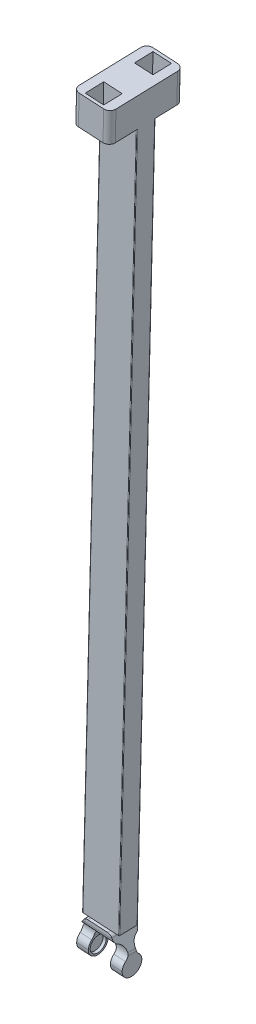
ISO-10303-21;
HEADER;
FILE_DESCRIPTION(('STEP AP214'),'2;1');
FILE_NAME('part.step','',(''),(''),'','','');
FILE_SCHEMA(('AUTOMOTIVE_DESIGN { 1 0 10303 214 1 1 1 1 }'));
ENDSEC;
DATA;
#1=APPLICATION_CONTEXT('core data for automotive mechanical design processes');
#2=APPLICATION_PROTOCOL_DEFINITION('international standard','automotive_design',2000,#1);
#3=PRODUCT_CONTEXT('',#1,'mechanical');
#4=PRODUCT('Part','Part','',(#3));
#5=PRODUCT_RELATED_PRODUCT_CATEGORY('part','',(#4));
#6=PRODUCT_DEFINITION_FORMATION('','',#4);
#7=PRODUCT_DEFINITION_CONTEXT('part definition',#1,'design');
#8=PRODUCT_DEFINITION('design','',#6,#7);
#9=PRODUCT_DEFINITION_SHAPE('','',#8);
#10=(LENGTH_UNIT() NAMED_UNIT(*) SI_UNIT(.MILLI.,.METRE.));
#11=(NAMED_UNIT(*) PLANE_ANGLE_UNIT() SI_UNIT($,.RADIAN.));
#12=(NAMED_UNIT(*) SI_UNIT($,.STERADIAN.) SOLID_ANGLE_UNIT());
#13=UNCERTAINTY_MEASURE_WITH_UNIT(LENGTH_MEASURE(1.E-05),#10,'distance_accuracy_value','');
#14=(GEOMETRIC_REPRESENTATION_CONTEXT(3) GLOBAL_UNCERTAINTY_ASSIGNED_CONTEXT((#13)) GLOBAL_UNIT_ASSIGNED_CONTEXT((#10,
#11,#12)) REPRESENTATION_CONTEXT('',''));
#15=CARTESIAN_POINT('',(0.,0.,0.));
#16=DIRECTION('',(0.,0.,1.));
#17=DIRECTION('',(1.,0.,0.));
#18=AXIS2_PLACEMENT_3D('',#15,#16,#17);
#19=CARTESIAN_POINT('',(42.1986461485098,-266.820294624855,21.1906178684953));
#20=DIRECTION('',(0.0574452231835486,0.997791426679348,0.0333513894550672));
#21=DIRECTION('',(-0.998346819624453,0.0574771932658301,1.55845841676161E-07));
#22=AXIS2_PLACEMENT_3D('',#19,#20,#21);
#23=CYLINDRICAL_SURFACE('',#22,5.);
#24=DIRECTION('',(0.0574452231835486,0.997791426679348,0.0333513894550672));
#25=VECTOR('',#24,1.);
#26=CARTESIAN_POINT('',(47.1903802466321,-267.107680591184,21.1906170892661));
#27=LINE('',#26,#25);
#28=CARTESIAN_POINT('',(50.637093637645,-207.240194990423,23.1917004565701));
#29=VERTEX_POINT('',#28);
#30=CARTESIAN_POINT('',(52.0732242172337,-182.295409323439,24.0254851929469));
#31=VERTEX_POINT('',#30);
#32=EDGE_CURVE('E682',#29,#31,#27,.T.);
#33=ORIENTED_EDGE('',*,*,#32,.F.);
#34=CARTESIAN_POINT('',(45.6453595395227,-206.952809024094,23.1917012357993));
#35=DIRECTION('',(-0.0574452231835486,-0.997791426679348,-0.0333513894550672));
#36=DIRECTION('',(0.443074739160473,-0.05541674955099,0.894770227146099));
#37=AXIS2_PLACEMENT_3D('',#34,#35,#36);
#38=CIRCLE('',#37,5.);
#39=CARTESIAN_POINT('',(45.6549434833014,-206.786327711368,18.1944827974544));
#40=VERTEX_POINT('',#39);
#41=EDGE_CURVE('E452',#29,#40,#38,.F.);
#42=ORIENTED_EDGE('',*,*,#41,.T.);
#43=DIRECTION('',(-0.0574452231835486,-0.997791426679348,-0.0333513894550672));
#44=VECTOR('',#43,1.);
#45=CARTESIAN_POINT('',(42.2082300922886,-266.653813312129,16.1933994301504));
#46=LINE('',#45,#44);
#47=CARTESIAN_POINT('',(47.0910740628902,-181.841542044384,19.0282675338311));
#48=VERTEX_POINT('',#47);
#49=EDGE_CURVE('E545',#48,#40,#46,.T.);
#50=ORIENTED_EDGE('',*,*,#49,.F.);
#51=CARTESIAN_POINT('',(47.0814901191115,-182.00802335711,24.025485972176));
#52=DIRECTION('',(0.0574452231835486,0.997791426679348,0.0333513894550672));
#53=DIRECTION('',(-0.443074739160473,0.05541674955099,-0.894770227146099));
#54=AXIS2_PLACEMENT_3D('',#51,#52,#53);
#55=CIRCLE('',#54,5.);
#56=EDGE_CURVE('E504',#31,#48,#55,.T.);
#57=ORIENTED_EDGE('',*,*,#56,.F.);
#58=EDGE_LOOP('',(#33,#42,#50,#57));
#59=FACE_BOUND('',#58,.T.);
#60=ADVANCED_FACE('F16',(#59),#23,.T.);
#61=CARTESIAN_POINT('',(42.1028067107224,-268.485107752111,71.1628022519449));
#62=DIRECTION('',(0.0574452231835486,0.997791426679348,0.0333513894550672));
#63=DIRECTION('',(-0.998346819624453,0.0574771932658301,1.55845841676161E-07));
#64=AXIS2_PLACEMENT_3D('',#61,#62,#63);
#65=CYLINDRICAL_SURFACE('',#64,5.);
#66=DIRECTION('',(0.0574452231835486,0.997791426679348,0.0333513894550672));
#67=VECTOR('',#66,1.);
#68=CARTESIAN_POINT('',(42.0932227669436,-268.651589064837,76.1600206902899));
#69=LINE('',#68,#67);
#70=CARTESIAN_POINT('',(45.5399361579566,-208.784103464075,78.1611040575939));
#71=VERTEX_POINT('',#70);
#72=CARTESIAN_POINT('',(46.9760667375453,-183.839317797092,78.9948887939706));
#73=VERTEX_POINT('',#72);
#74=EDGE_CURVE('E742',#71,#73,#69,.T.);
#75=ORIENTED_EDGE('',*,*,#74,.F.);
#76=CARTESIAN_POINT('',(45.5495201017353,-208.61762215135,73.1638856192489));
#77=DIRECTION('',(-0.0574452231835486,-0.997791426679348,-0.0333513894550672));
#78=DIRECTION('',(0.443074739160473,-0.05541674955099,0.894770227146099));
#79=AXIS2_PLACEMENT_3D('',#76,#77,#78);
#80=CIRCLE('',#79,5.);
#81=CARTESIAN_POINT('',(50.5412541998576,-208.905008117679,73.1638848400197));
#82=VERTEX_POINT('',#81);
#83=EDGE_CURVE('E463',#71,#82,#80,.F.);
#84=ORIENTED_EDGE('',*,*,#83,.T.);
#85=DIRECTION('',(-0.0574452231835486,-0.997791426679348,-0.0333513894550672));
#86=VECTOR('',#85,1.);
#87=CARTESIAN_POINT('',(47.0945408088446,-268.77249371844,71.1628014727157));
#88=LINE('',#87,#86);
#89=CARTESIAN_POINT('',(51.9773847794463,-183.960222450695,73.9976695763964));
#90=VERTEX_POINT('',#89);
#91=EDGE_CURVE('E677',#90,#82,#88,.T.);
#92=ORIENTED_EDGE('',*,*,#91,.F.);
#93=CARTESIAN_POINT('',(46.985650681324,-183.672836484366,73.9976703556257));
#94=DIRECTION('',(0.0574452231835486,0.997791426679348,0.0333513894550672));
#95=DIRECTION('',(-0.443074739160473,0.05541674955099,-0.894770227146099));
#96=AXIS2_PLACEMENT_3D('',#93,#94,#95);
#97=CIRCLE('',#96,5.);
#98=EDGE_CURVE('E522',#73,#90,#97,.T.);
#99=ORIENTED_EDGE('',*,*,#98,.F.);
#100=EDGE_LOOP('',(#75,#84,#92,#99));
#101=FACE_BOUND('',#100,.T.);
#102=ADVANCED_FACE('F1361',(#101),#65,.T.);
#103=CARTESIAN_POINT('',(22.1358703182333,-267.335563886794,71.1628053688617));
#104=DIRECTION('',(0.0574452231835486,0.997791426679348,0.0333513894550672));
#105=DIRECTION('',(-0.998346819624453,0.0574771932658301,1.55845841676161E-07));
#106=AXIS2_PLACEMENT_3D('',#103,#104,#105);
#107=CYLINDRICAL_SURFACE('',#106,5.);
#108=DIRECTION('',(0.0574452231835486,0.997791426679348,0.0333513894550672));
#109=VECTOR('',#108,1.);
#110=CARTESIAN_POINT('',(17.1441362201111,-267.048177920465,71.162806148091));
#111=LINE('',#110,#109);
#112=CARTESIAN_POINT('',(20.590849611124,-207.180692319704,73.163889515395));
#113=VERTEX_POINT('',#112);
#114=CARTESIAN_POINT('',(22.0269801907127,-182.23590665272,73.9976742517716));
#115=VERTEX_POINT('',#114);
#116=EDGE_CURVE('E658',#113,#115,#111,.T.);
#117=ORIENTED_EDGE('',*,*,#116,.F.);
#118=CARTESIAN_POINT('',(25.5825837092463,-207.468078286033,73.1638887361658));
#119=DIRECTION('',(-0.0574452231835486,-0.997791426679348,-0.0333513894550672));
#120=DIRECTION('',(0.443074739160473,-0.05541674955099,0.894770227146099));
#121=AXIS2_PLACEMENT_3D('',#118,#119,#120);
#122=CIRCLE('',#121,5.);
#123=CARTESIAN_POINT('',(25.5729997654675,-207.634559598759,78.1611071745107));
#124=VERTEX_POINT('',#123);
#125=EDGE_CURVE('E457',#113,#124,#122,.F.);
#126=ORIENTED_EDGE('',*,*,#125,.T.);
#127=DIRECTION('',(-0.0574452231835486,-0.997791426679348,-0.0333513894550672));
#128=VECTOR('',#127,1.);
#129=CARTESIAN_POINT('',(22.1262863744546,-267.50204519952,76.1600238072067));
#130=LINE('',#129,#128);
#131=CARTESIAN_POINT('',(27.0091303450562,-182.689773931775,78.9948919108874));
#132=VERTEX_POINT('',#131);
#133=EDGE_CURVE('E549',#132,#124,#130,.T.);
#134=ORIENTED_EDGE('',*,*,#133,.F.);
#135=CARTESIAN_POINT('',(27.018714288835,-182.523292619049,73.9976734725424));
#136=DIRECTION('',(0.0574452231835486,0.997791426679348,0.0333513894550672));
#137=DIRECTION('',(-0.443074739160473,0.05541674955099,-0.894770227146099));
#138=AXIS2_PLACEMENT_3D('',#135,#136,#137);
#139=CIRCLE('',#138,5.);
#140=EDGE_CURVE('E516',#115,#132,#139,.T.);
#141=ORIENTED_EDGE('',*,*,#140,.F.);
#142=EDGE_LOOP('',(#117,#126,#134,#141));
#143=FACE_BOUND('',#142,.T.);
#144=ADVANCED_FACE('F1366',(#143),#107,.T.);
#145=CARTESIAN_POINT('',(22.2317097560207,-265.670750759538,21.1906209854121));
#146=DIRECTION('',(0.0574452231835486,0.997791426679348,0.0333513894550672));
#147=DIRECTION('',(-0.998346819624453,0.0574771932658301,1.55845841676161E-07));
#148=AXIS2_PLACEMENT_3D('',#145,#146,#147);
#149=CYLINDRICAL_SURFACE('',#148,5.);
#150=DIRECTION('',(0.0574452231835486,0.997791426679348,0.0333513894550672));
#151=VECTOR('',#150,1.);
#152=CARTESIAN_POINT('',(22.2412936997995,-265.504269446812,16.1934025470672));
#153=LINE('',#152,#151);
#154=CARTESIAN_POINT('',(25.6880070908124,-205.636783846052,18.1944859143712));
#155=VERTEX_POINT('',#154);
#156=CARTESIAN_POINT('',(27.1241376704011,-180.691998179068,19.0282706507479));
#157=VERTEX_POINT('',#156);
#158=EDGE_CURVE('E550',#155,#157,#153,.T.);
#159=ORIENTED_EDGE('',*,*,#158,.F.);
#160=CARTESIAN_POINT('',(25.6784231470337,-205.803265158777,23.1917043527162));
#161=DIRECTION('',(-0.0574452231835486,-0.997791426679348,-0.0333513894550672));
#162=DIRECTION('',(0.443074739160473,-0.05541674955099,0.894770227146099));
#163=AXIS2_PLACEMENT_3D('',#160,#161,#162);
#164=CIRCLE('',#163,5.);
#165=CARTESIAN_POINT('',(20.6866890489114,-205.515879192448,23.1917051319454));
#166=VERTEX_POINT('',#165);
#167=EDGE_CURVE('E447',#155,#166,#164,.F.);
#168=ORIENTED_EDGE('',*,*,#167,.T.);
#169=DIRECTION('',(-0.0574452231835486,-0.997791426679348,-0.0333513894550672));
#170=VECTOR('',#169,1.);
#171=CARTESIAN_POINT('',(17.2399756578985,-265.383364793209,21.1906217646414));
#172=LINE('',#171,#170);
#173=CARTESIAN_POINT('',(22.1228196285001,-180.571093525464,24.0254898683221));
#174=VERTEX_POINT('',#173);
#175=EDGE_CURVE('E671',#174,#166,#172,.T.);
#176=ORIENTED_EDGE('',*,*,#175,.F.);
#177=CARTESIAN_POINT('',(27.1145537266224,-180.858479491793,24.0254890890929));
#178=DIRECTION('',(0.0574452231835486,0.997791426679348,0.0333513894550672));
#179=DIRECTION('',(-0.443074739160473,0.05541674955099,-0.894770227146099));
#180=AXIS2_PLACEMENT_3D('',#177,#178,#179);
#181=CIRCLE('',#180,5.);
#182=EDGE_CURVE('E510',#157,#174,#181,.T.);
#183=ORIENTED_EDGE('',*,*,#182,.F.);
#184=EDGE_LOOP('',(#159,#168,#176,#183));
#185=FACE_BOUND('',#184,.T.);
#186=ADVANCED_FACE('F1849',(#185),#149,.T.);
#187=CARTESIAN_POINT('',(41.0382782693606,-243.479869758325,74.4951965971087));
#188=DIRECTION('',(0.998346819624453,-0.0574771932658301,-1.55845841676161E-07));
#189=DIRECTION('',(-0.00191678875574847,-0.033296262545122,0.999443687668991));
#190=AXIS2_PLACEMENT_3D('',#187,#188,#189);
#191=PLANE('',#190);
#192=DIRECTION('',(0.00191678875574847,0.033296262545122,-0.999443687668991));
#193=VECTOR('',#192,1.);
#194=CARTESIAN_POINT('',(43.0488610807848,-208.557169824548,75.662495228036));
#195=LINE('',#194,#193);
#196=CARTESIAN_POINT('',(43.0488610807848,-208.557169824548,75.662495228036));
#197=VERTEX_POINT('',#196);
#198=CARTESIAN_POINT('',(43.077612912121,-208.057725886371,60.6708399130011));
#199=VERTEX_POINT('',#198);
#200=EDGE_CURVE('E31',#197,#199,#195,.T.);
#201=ORIENTED_EDGE('',*,*,#200,.F.);
#202=DIRECTION('',(-0.0574452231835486,-0.997791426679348,-0.0333513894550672));
#203=VECTOR('',#202,1.);
#204=CARTESIAN_POINT('',(41.0382782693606,-243.479869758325,74.4951965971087));
#205=LINE('',#204,#203);
#206=CARTESIAN_POINT('',(44.4849916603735,-183.612384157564,76.4962799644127));
#207=VERTEX_POINT('',#206);
#208=EDGE_CURVE('E614',#207,#197,#205,.T.);
#209=ORIENTED_EDGE('',*,*,#208,.F.);
#210=DIRECTION('',(0.00191678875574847,0.0332962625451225,-0.999443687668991));
#211=VECTOR('',#210,1.);
#212=CARTESIAN_POINT('',(44.4849916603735,-183.612384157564,76.4962799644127));
#213=LINE('',#212,#211);
#214=CARTESIAN_POINT('',(44.5137434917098,-183.112940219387,61.5046246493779));
#215=VERTEX_POINT('',#214);
#216=EDGE_CURVE('E480',#207,#215,#213,.T.);
#217=ORIENTED_EDGE('',*,*,#216,.T.);
#218=DIRECTION('',(-0.0574452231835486,-0.997791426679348,-0.0333513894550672));
#219=VECTOR('',#218,1.);
#220=CARTESIAN_POINT('',(41.0670301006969,-242.980425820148,59.5035412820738));
#221=LINE('',#220,#219);
#222=EDGE_CURVE('E605',#215,#199,#221,.T.);
#223=ORIENTED_EDGE('',*,*,#222,.T.);
#224=EDGE_LOOP('',(#201,#209,#217,#223));
#225=FACE_BOUND('',#224,.T.);
#226=ADVANCED_FACE('F1444',(#225),#191,.F.);
#227=CARTESIAN_POINT('',(41.0382782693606,-243.479869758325,74.4951965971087));
#228=DIRECTION('',(-0.00191678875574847,-0.033296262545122,0.999443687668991));
#229=DIRECTION('',(0.998346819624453,-0.0574771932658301,-1.55845841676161E-07));
#230=AXIS2_PLACEMENT_3D('',#227,#228,#229);
#231=PLANE('',#230);
#232=DIRECTION('',(0.998346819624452,-0.0574771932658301,-1.55845841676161E-07));
#233=VECTOR('',#232,1.);
#234=CARTESIAN_POINT('',(43.0488610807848,-208.557169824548,75.662495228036));
#235=LINE('',#234,#233);
#236=CARTESIAN_POINT('',(28.073658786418,-207.695011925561,75.6624975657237));
#237=VERTEX_POINT('',#236);
#238=EDGE_CURVE('E477',#237,#197,#235,.T.);
#239=ORIENTED_EDGE('',*,*,#238,.F.);
#240=DIRECTION('',(-0.0574452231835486,-0.997791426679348,-0.0333513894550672));
#241=VECTOR('',#240,1.);
#242=CARTESIAN_POINT('',(26.0630759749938,-242.617711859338,74.4951989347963));
#243=LINE('',#242,#241);
#244=CARTESIAN_POINT('',(29.5097893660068,-182.750226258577,76.4962823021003));
#245=VERTEX_POINT('',#244);
#246=EDGE_CURVE('E604',#245,#237,#243,.T.);
#247=ORIENTED_EDGE('',*,*,#246,.F.);
#248=DIRECTION('',(0.998346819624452,-0.05747719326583,-1.55845840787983E-07));
#249=VECTOR('',#248,1.);
#250=CARTESIAN_POINT('',(29.5097893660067,-182.750226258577,76.4962823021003));
#251=LINE('',#250,#249);
#252=EDGE_CURVE('E489',#245,#207,#251,.T.);
#253=ORIENTED_EDGE('',*,*,#252,.T.);
#254=ORIENTED_EDGE('',*,*,#208,.T.);
#255=EDGE_LOOP('',(#239,#247,#253,#254));
#256=FACE_BOUND('',#255,.T.);
#257=ADVANCED_FACE('F1441',(#256),#231,.F.);
#258=CARTESIAN_POINT('',(26.0630759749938,-242.617711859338,74.4951989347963));
#259=DIRECTION('',(-0.998346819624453,0.0574771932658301,1.55845841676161E-07));
#260=DIRECTION('',(-0.00191678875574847,-0.033296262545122,0.999443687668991));
#261=AXIS2_PLACEMENT_3D('',#258,#259,#260);
#262=PLANE('',#261);
#263=DIRECTION('',(-0.00191678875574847,-0.033296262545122,0.999443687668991));
#264=VECTOR('',#263,1.);
#265=CARTESIAN_POINT('',(28.073658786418,-207.695011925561,75.6624975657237));
#266=LINE('',#265,#264);
#267=CARTESIAN_POINT('',(28.1024106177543,-207.195567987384,60.6708422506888));
#268=VERTEX_POINT('',#267);
#269=EDGE_CURVE('E475',#268,#237,#266,.T.);
#270=ORIENTED_EDGE('',*,*,#269,.F.);
#271=DIRECTION('',(-0.0574452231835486,-0.997791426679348,-0.0333513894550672));
#272=VECTOR('',#271,1.);
#273=CARTESIAN_POINT('',(26.09182780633,-242.118267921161,59.5035436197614));
#274=LINE('',#273,#272);
#275=CARTESIAN_POINT('',(29.538541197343,-182.2507823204,61.5046269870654));
#276=VERTEX_POINT('',#275);
#277=EDGE_CURVE('E600',#276,#268,#274,.T.);
#278=ORIENTED_EDGE('',*,*,#277,.F.);
#279=DIRECTION('',(-0.00191678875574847,-0.0332962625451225,0.999443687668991));
#280=VECTOR('',#279,1.);
#281=CARTESIAN_POINT('',(29.538541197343,-182.2507823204,61.5046269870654));
#282=LINE('',#281,#280);
#283=EDGE_CURVE('E486',#276,#245,#282,.T.);
#284=ORIENTED_EDGE('',*,*,#283,.T.);
#285=ORIENTED_EDGE('',*,*,#246,.T.);
#286=EDGE_LOOP('',(#270,#278,#284,#285));
#287=FACE_BOUND('',#286,.T.);
#288=ADVANCED_FACE('F1059',(#287),#262,.F.);
#289=CARTESIAN_POINT('',(41.0670301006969,-242.980425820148,59.5035412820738));
#290=DIRECTION('',(0.00191678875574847,0.033296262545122,-0.999443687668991));
#291=DIRECTION('',(-0.0574452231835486,-0.997791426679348,-0.0333513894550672));
#292=AXIS2_PLACEMENT_3D('',#289,#290,#291);
#293=PLANE('',#292);
#294=DIRECTION('',(-0.998346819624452,0.0574771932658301,1.55845841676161E-07));
#295=VECTOR('',#294,1.);
#296=CARTESIAN_POINT('',(43.077612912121,-208.057725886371,60.6708399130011));
#297=LINE('',#296,#295);
#298=EDGE_CURVE('E473',#199,#268,#297,.T.);
#299=ORIENTED_EDGE('',*,*,#298,.F.);
#300=ORIENTED_EDGE('',*,*,#222,.F.);
#301=DIRECTION('',(-0.998346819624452,0.05747719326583,1.55845841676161E-07));
#302=VECTOR('',#301,1.);
#303=CARTESIAN_POINT('',(44.5137434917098,-183.112940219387,61.5046246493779));
#304=LINE('',#303,#302);
#305=EDGE_CURVE('E483',#215,#276,#304,.T.);
#306=ORIENTED_EDGE('',*,*,#305,.T.);
#307=ORIENTED_EDGE('',*,*,#277,.T.);
#308=EDGE_LOOP('',(#299,#300,#306,#307));
#309=FACE_BOUND('',#308,.T.);
#310=ADVANCED_FACE('F1451',(#309),#293,.F.);
#311=CARTESIAN_POINT('',(41.1149498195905,-242.14801925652,34.517449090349));
#312=DIRECTION('',(0.998346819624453,-0.0574771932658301,-1.55845841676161E-07));
#313=DIRECTION('',(-0.00191678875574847,-0.033296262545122,0.999443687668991));
#314=AXIS2_PLACEMENT_3D('',#311,#312,#313);
#315=PLANE('',#314);
#316=DIRECTION('',(0.00191678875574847,0.033296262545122,-0.999443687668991));
#317=VECTOR('',#316,1.);
#318=CARTESIAN_POINT('',(43.1255326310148,-207.225319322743,35.6847477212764));
#319=LINE('',#318,#317);
#320=CARTESIAN_POINT('',(43.1255326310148,-207.225319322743,35.6847477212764));
#321=VERTEX_POINT('',#320);
#322=CARTESIAN_POINT('',(43.1542844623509,-206.725875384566,20.6930924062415));
#323=VERTEX_POINT('',#322);
#324=EDGE_CURVE('E39',#321,#323,#319,.T.);
#325=ORIENTED_EDGE('',*,*,#324,.F.);
#326=DIRECTION('',(-0.0574452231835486,-0.997791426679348,-0.0333513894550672));
#327=VECTOR('',#326,1.);
#328=CARTESIAN_POINT('',(41.1149498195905,-242.14801925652,34.517449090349));
#329=LINE('',#328,#327);
#330=CARTESIAN_POINT('',(44.5616632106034,-182.280533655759,36.518532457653));
#331=VERTEX_POINT('',#330);
#332=EDGE_CURVE('E672',#331,#321,#329,.T.);
#333=ORIENTED_EDGE('',*,*,#332,.F.);
#334=DIRECTION('',(0.00191678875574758,0.0332962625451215,-0.999443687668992));
#335=VECTOR('',#334,1.);
#336=CARTESIAN_POINT('',(44.5904150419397,-181.781089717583,21.5268771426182));
#337=LINE('',#336,#335);
#338=CARTESIAN_POINT('',(44.5904150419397,-181.781089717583,21.5268771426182));
#339=VERTEX_POINT('',#338);
#340=EDGE_CURVE('E501',#331,#339,#337,.T.);
#341=ORIENTED_EDGE('',*,*,#340,.T.);
#342=DIRECTION('',(-0.0574452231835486,-0.997791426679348,-0.0333513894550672));
#343=VECTOR('',#342,1.);
#344=CARTESIAN_POINT('',(41.1437016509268,-241.648575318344,19.5257937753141));
#345=LINE('',#344,#343);
#346=EDGE_CURVE('E738',#339,#323,#345,.T.);
#347=ORIENTED_EDGE('',*,*,#346,.T.);
#348=EDGE_LOOP('',(#325,#333,#341,#347));
#349=FACE_BOUND('',#348,.T.);
#350=ADVANCED_FACE('F1453',(#349),#315,.F.);
#351=CARTESIAN_POINT('',(41.1149498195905,-242.14801925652,34.517449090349));
#352=DIRECTION('',(-0.00191678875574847,-0.033296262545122,0.999443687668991));
#353=DIRECTION('',(0.998346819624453,-0.0574771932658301,-1.55845841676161E-07));
#354=AXIS2_PLACEMENT_3D('',#351,#352,#353);
#355=PLANE('',#354);
#356=DIRECTION('',(0.998346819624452,-0.0574771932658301,-1.55845841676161E-07));
#357=VECTOR('',#356,1.);
#358=CARTESIAN_POINT('',(43.1255326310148,-207.225319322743,35.6847477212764));
#359=LINE('',#358,#357);
#360=CARTESIAN_POINT('',(28.1503303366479,-206.363161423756,35.684750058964));
#361=VERTEX_POINT('',#360);
#362=EDGE_CURVE('E470',#361,#321,#359,.T.);
#363=ORIENTED_EDGE('',*,*,#362,.F.);
#364=DIRECTION('',(-0.0574452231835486,-0.997791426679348,-0.0333513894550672));
#365=VECTOR('',#364,1.);
#366=CARTESIAN_POINT('',(26.1397475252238,-241.285861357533,34.5174514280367));
#367=LINE('',#366,#365);
#368=CARTESIAN_POINT('',(29.5864609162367,-181.418375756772,36.5185347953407));
#369=VERTEX_POINT('',#368);
#370=EDGE_CURVE('E676',#369,#361,#367,.T.);
#371=ORIENTED_EDGE('',*,*,#370,.F.);
#372=DIRECTION('',(0.998346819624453,-0.05747719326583,-1.55845841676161E-07));
#373=VECTOR('',#372,1.);
#374=CARTESIAN_POINT('',(44.5616632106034,-182.280533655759,36.518532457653));
#375=LINE('',#374,#373);
#376=EDGE_CURVE('E498',#369,#331,#375,.T.);
#377=ORIENTED_EDGE('',*,*,#376,.T.);
#378=ORIENTED_EDGE('',*,*,#332,.T.);
#379=EDGE_LOOP('',(#363,#371,#377,#378));
#380=FACE_BOUND('',#379,.T.);
#381=ADVANCED_FACE('F1438',(#380),#355,.F.);
#382=CARTESIAN_POINT('',(26.1397475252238,-241.285861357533,34.5174514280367));
#383=DIRECTION('',(-0.998346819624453,0.0574771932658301,1.55845841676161E-07));
#384=DIRECTION('',(-0.00191678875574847,-0.033296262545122,0.999443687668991));
#385=AXIS2_PLACEMENT_3D('',#382,#383,#384);
#386=PLANE('',#385);
#387=DIRECTION('',(-0.00191678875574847,-0.033296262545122,0.999443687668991));
#388=VECTOR('',#387,1.);
#389=CARTESIAN_POINT('',(28.1503303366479,-206.363161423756,35.684750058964));
#390=LINE('',#389,#388);
#391=CARTESIAN_POINT('',(28.1790821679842,-205.863717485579,20.6930947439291));
#392=VERTEX_POINT('',#391);
#393=EDGE_CURVE('E468',#392,#361,#390,.T.);
#394=ORIENTED_EDGE('',*,*,#393,.F.);
#395=DIRECTION('',(-0.0574452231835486,-0.997791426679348,-0.0333513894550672));
#396=VECTOR('',#395,1.);
#397=CARTESIAN_POINT('',(26.16849935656,-240.786417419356,19.5257961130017));
#398=LINE('',#397,#396);
#399=CARTESIAN_POINT('',(29.6152127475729,-180.918931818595,21.5268794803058));
#400=VERTEX_POINT('',#399);
#401=EDGE_CURVE('E734',#400,#392,#398,.T.);
#402=ORIENTED_EDGE('',*,*,#401,.F.);
#403=DIRECTION('',(-0.00191678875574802,-0.0332962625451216,0.999443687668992));
#404=VECTOR('',#403,1.);
#405=CARTESIAN_POINT('',(29.5864609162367,-181.418375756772,36.5185347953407));
#406=LINE('',#405,#404);
#407=EDGE_CURVE('E495',#400,#369,#406,.T.);
#408=ORIENTED_EDGE('',*,*,#407,.T.);
#409=ORIENTED_EDGE('',*,*,#370,.T.);
#410=EDGE_LOOP('',(#394,#402,#408,#409));
#411=FACE_BOUND('',#410,.T.);
#412=ADVANCED_FACE('F1433',(#411),#386,.F.);
#413=CARTESIAN_POINT('',(41.1437016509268,-241.648575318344,19.5257937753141));
#414=DIRECTION('',(0.00191678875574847,0.033296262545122,-0.999443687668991));
#415=DIRECTION('',(-0.0574452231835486,-0.997791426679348,-0.0333513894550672));
#416=AXIS2_PLACEMENT_3D('',#413,#414,#415);
#417=PLANE('',#416);
#418=DIRECTION('',(-0.998346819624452,0.0574771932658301,1.55845841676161E-07));
#419=VECTOR('',#418,1.);
#420=CARTESIAN_POINT('',(43.1542844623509,-206.725875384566,20.6930924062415));
#421=LINE('',#420,#419);
#422=EDGE_CURVE('E466',#323,#392,#421,.T.);
#423=ORIENTED_EDGE('',*,*,#422,.F.);
#424=ORIENTED_EDGE('',*,*,#346,.F.);
#425=DIRECTION('',(-0.998346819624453,0.0574771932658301,1.5584584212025E-07));
#426=VECTOR('',#425,1.);
#427=CARTESIAN_POINT('',(29.6152127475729,-180.918931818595,21.5268794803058));
#428=LINE('',#427,#426);
#429=EDGE_CURVE('E492',#339,#400,#428,.T.);
#430=ORIENTED_EDGE('',*,*,#429,.T.);
#431=ORIENTED_EDGE('',*,*,#401,.T.);
#432=EDGE_LOOP('',(#423,#424,#430,#431));
#433=FACE_BOUND('',#432,.T.);
#434=ADVANCED_FACE('F1427',(#433),#417,.F.);
#435=CARTESIAN_POINT('',(17.1345522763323,-267.214659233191,76.1600245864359));
#436=DIRECTION('',(0.00191678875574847,0.033296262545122,-0.999443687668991));
#437=DIRECTION('',(-0.0574452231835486,-0.997791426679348,-0.0333513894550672));
#438=AXIS2_PLACEMENT_3D('',#435,#436,#437);
#439=PLANE('',#438);
#440=DIRECTION('',(-0.998346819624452,0.0574771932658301,1.55845841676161E-07));
#441=VECTOR('',#440,1.);
#442=CARTESIAN_POINT('',(20.5812656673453,-207.34717363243,78.1611079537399));
#443=LINE('',#442,#441);
#444=EDGE_CURVE('E461',#71,#124,#443,.T.);
#445=ORIENTED_EDGE('',*,*,#444,.F.);
#446=ORIENTED_EDGE('',*,*,#74,.T.);
#447=DIRECTION('',(0.998346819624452,-0.0574771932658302,-1.55845841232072E-07));
#448=VECTOR('',#447,1.);
#449=CARTESIAN_POINT('',(46.9760667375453,-183.839317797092,78.9948887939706));
#450=LINE('',#449,#448);
#451=EDGE_CURVE('E519',#132,#73,#450,.T.);
#452=ORIENTED_EDGE('',*,*,#451,.F.);
#453=ORIENTED_EDGE('',*,*,#133,.T.);
#454=EDGE_LOOP('',(#445,#446,#452,#453));
#455=FACE_BOUND('',#454,.T.);
#456=ADVANCED_FACE('F1110',(#455),#439,.F.);
#457=CARTESIAN_POINT('',(17.2495596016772,-265.216883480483,16.1934033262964));
#458=DIRECTION('',(-0.00191678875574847,-0.033296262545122,0.999443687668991));
#459=DIRECTION('',(0.998346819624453,-0.0574771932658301,-1.55845841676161E-07));
#460=AXIS2_PLACEMENT_3D('',#457,#458,#459);
#461=PLANE('',#460);
#462=DIRECTION('',(0.998346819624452,-0.0574771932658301,-1.55845841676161E-07));
#463=VECTOR('',#462,1.);
#464=CARTESIAN_POINT('',(20.6962729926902,-205.349397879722,18.1944866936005));
#465=LINE('',#464,#463);
#466=EDGE_CURVE('E450',#155,#40,#465,.T.);
#467=ORIENTED_EDGE('',*,*,#466,.F.);
#468=ORIENTED_EDGE('',*,*,#158,.T.);
#469=DIRECTION('',(-0.998346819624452,0.0574771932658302,1.55845841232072E-07));
#470=VECTOR('',#469,1.);
#471=CARTESIAN_POINT('',(47.0910740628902,-181.841542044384,19.0282675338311));
#472=LINE('',#471,#470);
#473=EDGE_CURVE('E507',#48,#157,#472,.T.);
#474=ORIENTED_EDGE('',*,*,#473,.F.);
#475=ORIENTED_EDGE('',*,*,#49,.T.);
#476=EDGE_LOOP('',(#467,#468,#474,#475));
#477=FACE_BOUND('',#476,.T.);
#478=ADVANCED_FACE('F1426',(#477),#461,.F.);
#479=CARTESIAN_POINT('',(17.907592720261,-262.486418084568,53.3062252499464));
#480=DIRECTION('',(-0.0574452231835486,-0.997791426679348,-0.0333513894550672));
#481=DIRECTION('',(0.998346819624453,-0.0574771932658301,-1.55845841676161E-07));
#482=AXIS2_PLACEMENT_3D('',#479,#480,#481);
#483=CYLINDRICAL_SURFACE('',#482,0.5);
#484=DIRECTION('',(-0.0574452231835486,-0.997791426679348,-0.0333513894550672));
#485=VECTOR('',#484,1.);
#486=CARTESIAN_POINT('',(17.9066343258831,-262.503066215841,53.8059470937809));
#487=LINE('',#486,#485);
#488=CARTESIAN_POINT('',(21.1235668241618,-206.626746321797,55.6736249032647));
#489=VERTEX_POINT('',#488);
#490=CARTESIAN_POINT('',(-13.1137861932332,-801.310436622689,35.7961967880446));
#491=VERTEX_POINT('',#490);
#492=EDGE_CURVE('E587',#489,#491,#487,.T.);
#493=ORIENTED_EDGE('',*,*,#492,.F.);
#494=CARTESIAN_POINT('',(21.1245252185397,-206.610098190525,55.1739030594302));
#495=DIRECTION('',(-0.0574452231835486,-0.997791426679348,-0.0333513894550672));
#496=DIRECTION('',(0.443074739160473,-0.05541674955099,0.894770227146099));
#497=AXIS2_PLACEMENT_3D('',#494,#495,#496);
#498=CIRCLE('',#497,0.5);
#499=CARTESIAN_POINT('',(20.6253518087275,-206.581359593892,55.1739031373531));
#500=VERTEX_POINT('',#499);
#501=EDGE_CURVE('E444',#489,#500,#498,.T.);
#502=ORIENTED_EDGE('',*,*,#501,.T.);
#503=DIRECTION('',(0.0574452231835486,0.997791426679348,0.0333513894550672));
#504=VECTOR('',#503,1.);
#505=CARTESIAN_POINT('',(17.4084193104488,-262.457679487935,53.3062253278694));
#506=LINE('',#505,#504);
#507=CARTESIAN_POINT('',(-13.6120012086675,-801.265049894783,35.2964750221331));
#508=VERTEX_POINT('',#507);
#509=EDGE_CURVE('E655',#508,#500,#506,.T.);
#510=ORIENTED_EDGE('',*,*,#509,.F.);
#511=CARTESIAN_POINT('',(-13.1128277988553,-801.293788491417,35.2964749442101));
#512=DIRECTION('',(-0.0574452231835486,-0.997791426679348,-0.0333513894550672));
#513=DIRECTION('',(0.998346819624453,-0.0574771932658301,-1.55845841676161E-07));
#514=AXIS2_PLACEMENT_3D('',#511,#512,#513);
#515=CIRCLE('',#514,0.5);
#516=EDGE_CURVE('E690',#491,#508,#515,.T.);
#517=ORIENTED_EDGE('',*,*,#516,.F.);
#518=EDGE_LOOP('',(#493,#502,#510,#517));
#519=FACE_BOUND('',#518,.T.);
#520=ADVANCED_FACE('F1419',(#519),#483,.T.);
#521=CARTESIAN_POINT('',(17.9344277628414,-262.020270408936,39.3140136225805));
#522=DIRECTION('',(-0.0574452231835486,-0.997791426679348,-0.0333513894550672));
#523=DIRECTION('',(0.998346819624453,-0.0574771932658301,-1.55845841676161E-07));
#524=AXIS2_PLACEMENT_3D('',#521,#522,#523);
#525=CYLINDRICAL_SURFACE('',#524,0.5);
#526=CARTESIAN_POINT('',(-13.0859927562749,-800.827640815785,21.3042633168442));
#527=DIRECTION('',(-0.0574452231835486,-0.997791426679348,-0.0333513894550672));
#528=DIRECTION('',(0.998346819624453,-0.0574771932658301,-1.55845841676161E-07));
#529=AXIS2_PLACEMENT_3D('',#526,#527,#528);
#530=CIRCLE('',#529,0.5);
#531=CARTESIAN_POINT('',(-13.5851661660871,-800.798902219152,21.3042633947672));
#532=VERTEX_POINT('',#531);
#533=CARTESIAN_POINT('',(-13.085034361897,-800.810992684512,20.8045414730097));
#534=VERTEX_POINT('',#533);
#535=EDGE_CURVE('E693',#532,#534,#530,.T.);
#536=ORIENTED_EDGE('',*,*,#535,.F.);
#537=DIRECTION('',(-0.0574452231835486,-0.997791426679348,-0.0333513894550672));
#538=VECTOR('',#537,1.);
#539=CARTESIAN_POINT('',(17.4352543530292,-261.991531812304,39.3140137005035));
#540=LINE('',#539,#538);
#541=CARTESIAN_POINT('',(20.6521868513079,-206.11521191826,41.1816915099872));
#542=VERTEX_POINT('',#541);
#543=EDGE_CURVE('E434',#542,#532,#540,.T.);
#544=ORIENTED_EDGE('',*,*,#543,.F.);
#545=CARTESIAN_POINT('',(21.1513602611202,-206.143950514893,41.1816914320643));
#546=DIRECTION('',(-0.0574452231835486,-0.997791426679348,-0.0333513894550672));
#547=DIRECTION('',(0.443074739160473,-0.05541674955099,0.894770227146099));
#548=AXIS2_PLACEMENT_3D('',#545,#546,#547);
#549=CIRCLE('',#548,0.5);
#550=CARTESIAN_POINT('',(21.152318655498,-206.12730238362,40.6819695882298));
#551=VERTEX_POINT('',#550);
#552=EDGE_CURVE('E428',#542,#551,#549,.T.);
#553=ORIENTED_EDGE('',*,*,#552,.T.);
#554=DIRECTION('',(0.0574452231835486,0.997791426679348,0.0333513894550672));
#555=VECTOR('',#554,1.);
#556=CARTESIAN_POINT('',(17.9353861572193,-262.003622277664,38.8142917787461));
#557=LINE('',#556,#555);
#558=EDGE_CURVE('E410',#534,#551,#557,.T.);
#559=ORIENTED_EDGE('',*,*,#558,.F.);
#560=EDGE_LOOP('',(#536,#544,#553,#559));
#561=FACE_BOUND('',#560,.T.);
#562=ADVANCED_FACE('F433',(#561),#525,.T.);
#563=CARTESIAN_POINT('',(46.8864855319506,-263.687109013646,39.3140091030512));
#564=DIRECTION('',(-0.0574452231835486,-0.997791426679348,-0.0333513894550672));
#565=DIRECTION('',(0.998346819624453,-0.0574771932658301,-1.55845841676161E-07));
#566=AXIS2_PLACEMENT_3D('',#563,#564,#565);
#567=CYLINDRICAL_SURFACE('',#566,0.5);
#568=DIRECTION('',(-0.0574452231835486,-0.997791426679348,-0.0333513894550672));
#569=VECTOR('',#568,1.);
#570=CARTESIAN_POINT('',(46.8874439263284,-263.670460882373,38.8142872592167));
#571=LINE('',#570,#569);
#572=CARTESIAN_POINT('',(50.1043764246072,-207.79414098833,40.6819650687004));
#573=VERTEX_POINT('',#572);
#574=CARTESIAN_POINT('',(15.8670234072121,-802.477831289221,20.8045369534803));
#575=VERTEX_POINT('',#574);
#576=EDGE_CURVE('E420',#573,#575,#571,.T.);
#577=ORIENTED_EDGE('',*,*,#576,.F.);
#578=CARTESIAN_POINT('',(50.1034180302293,-207.810789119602,41.1816869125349));
#579=DIRECTION('',(-0.0574452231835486,-0.997791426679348,-0.0333513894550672));
#580=DIRECTION('',(0.443074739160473,-0.05541674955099,0.894770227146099));
#581=AXIS2_PLACEMENT_3D('',#578,#579,#580);
#582=CIRCLE('',#581,0.499999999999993);
#583=CARTESIAN_POINT('',(50.6025914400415,-207.839527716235,41.181686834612));
#584=VERTEX_POINT('',#583);
#585=EDGE_CURVE('E431',#573,#584,#582,.T.);
#586=ORIENTED_EDGE('',*,*,#585,.T.);
#587=DIRECTION('',(0.0574452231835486,0.997791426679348,0.0333513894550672));
#588=VECTOR('',#587,1.);
#589=CARTESIAN_POINT('',(47.3856589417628,-263.715847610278,39.3140090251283));
#590=LINE('',#589,#588);
#591=CARTESIAN_POINT('',(16.3652384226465,-802.523218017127,21.3042587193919));
#592=VERTEX_POINT('',#591);
#593=EDGE_CURVE('E771',#592,#584,#590,.T.);
#594=ORIENTED_EDGE('',*,*,#593,.F.);
#595=CARTESIAN_POINT('',(15.8660650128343,-802.494479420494,21.3042587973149));
#596=DIRECTION('',(-0.0574452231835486,-0.997791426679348,-0.0333513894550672));
#597=DIRECTION('',(0.998346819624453,-0.0574771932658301,-1.55845841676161E-07));
#598=AXIS2_PLACEMENT_3D('',#595,#596,#597);
#599=CIRCLE('',#598,0.5);
#600=EDGE_CURVE('E582',#575,#592,#599,.T.);
#601=ORIENTED_EDGE('',*,*,#600,.F.);
#602=EDGE_LOOP('',(#577,#586,#594,#601));
#603=FACE_BOUND('',#602,.T.);
#604=ADVANCED_FACE('F1394',(#603),#567,.T.);
#605=CARTESIAN_POINT('',(46.8596504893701,-264.153256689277,53.306220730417));
#606=DIRECTION('',(-0.0574452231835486,-0.997791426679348,-0.0333513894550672));
#607=DIRECTION('',(0.998346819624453,-0.0574771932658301,-1.55845841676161E-07));
#608=AXIS2_PLACEMENT_3D('',#605,#606,#607);
#609=CYLINDRICAL_SURFACE('',#608,0.5);
#610=CARTESIAN_POINT('',(15.8392299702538,-802.960627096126,35.2964704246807));
#611=DIRECTION('',(-0.0574452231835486,-0.997791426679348,-0.0333513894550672));
#612=DIRECTION('',(0.998346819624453,-0.0574771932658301,-1.55845841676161E-07));
#613=AXIS2_PLACEMENT_3D('',#610,#611,#612);
#614=CIRCLE('',#613,0.5);
#615=CARTESIAN_POINT('',(16.338403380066,-802.989365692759,35.2964703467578));
#616=VERTEX_POINT('',#615);
#617=CARTESIAN_POINT('',(15.8382715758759,-802.977275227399,35.7961922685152));
#618=VERTEX_POINT('',#617);
#619=EDGE_CURVE('E551',#616,#618,#614,.T.);
#620=ORIENTED_EDGE('',*,*,#619,.F.);
#621=DIRECTION('',(-0.0574452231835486,-0.997791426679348,-0.0333513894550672));
#622=VECTOR('',#621,1.);
#623=CARTESIAN_POINT('',(47.3588238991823,-264.18199528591,53.3062206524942));
#624=LINE('',#623,#622);
#625=CARTESIAN_POINT('',(50.575756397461,-208.305675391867,55.1738984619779));
#626=VERTEX_POINT('',#625);
#627=EDGE_CURVE('E681',#626,#616,#624,.T.);
#628=ORIENTED_EDGE('',*,*,#627,.F.);
#629=CARTESIAN_POINT('',(50.0765829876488,-208.276936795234,55.1738985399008));
#630=DIRECTION('',(-0.0574452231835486,-0.997791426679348,-0.0333513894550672));
#631=DIRECTION('',(-0.443074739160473,0.05541674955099,-0.894770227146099));
#632=AXIS2_PLACEMENT_3D('',#629,#630,#631);
#633=CIRCLE('',#632,0.5);
#634=CARTESIAN_POINT('',(50.0756245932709,-208.293584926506,55.6736203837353));
#635=VERTEX_POINT('',#634);
#636=EDGE_CURVE('E438',#626,#635,#633,.T.);
#637=ORIENTED_EDGE('',*,*,#636,.T.);
#638=DIRECTION('',(0.0574452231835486,0.997791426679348,0.0333513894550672));
#639=VECTOR('',#638,1.);
#640=CARTESIAN_POINT('',(46.8586920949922,-264.16990482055,53.8059425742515));
#641=LINE('',#640,#639);
#642=EDGE_CURVE('E581',#618,#635,#641,.T.);
#643=ORIENTED_EDGE('',*,*,#642,.F.);
#644=EDGE_LOOP('',(#620,#628,#637,#643));
#645=FACE_BOUND('',#644,.T.);
#646=ADVANCED_FACE('F1000',(#645),#609,.T.);
#647=CARTESIAN_POINT('',(16.3661968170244,-802.506569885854,20.8045368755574));
#648=DIRECTION('',(-0.0574452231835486,-0.997791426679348,-0.0333513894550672));
#649=DIRECTION('',(0.00191678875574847,0.033296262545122,-0.999443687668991));
#650=AXIS2_PLACEMENT_3D('',#647,#648,#649);
#651=PLANE('',#650);
#652=DIRECTION('',(-0.998346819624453,0.0574771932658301,1.55845841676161E-07));
#653=VECTOR('',#652,1.);
#654=CARTESIAN_POINT('',(-13.5842077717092,-800.78225408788,20.8045415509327));
#655=LINE('',#654,#653);
#656=CARTESIAN_POINT('',(-6.70329714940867,-801.178404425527,20.8045404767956));
#657=VERTEX_POINT('',#656);
#658=EDGE_CURVE('E415',#657,#534,#655,.T.);
#659=ORIENTED_EDGE('',*,*,#658,.F.);
#660=DIRECTION('',(-0.00191678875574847,-0.033296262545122,0.999443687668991));
#661=VECTOR('',#660,1.);
#662=CARTESIAN_POINT('',(-6.69850517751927,-801.095163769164,18.3059312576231));
#663=LINE('',#662,#661);
#664=CARTESIAN_POINT('',(-6.73204898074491,-801.677848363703,35.7961957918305));
#665=VERTEX_POINT('',#664);
#666=EDGE_CURVE('E757',#657,#665,#663,.T.);
#667=ORIENTED_EDGE('',*,*,#666,.T.);
#668=DIRECTION('',(0.998346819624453,-0.0574771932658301,-1.55845841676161E-07));
#669=VECTOR('',#668,1.);
#670=CARTESIAN_POINT('',(-13.6129596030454,-801.281698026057,35.7961968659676));
#671=LINE('',#670,#669);
#672=EDGE_CURVE('E591',#491,#665,#671,.T.);
#673=ORIENTED_EDGE('',*,*,#672,.F.);
#674=ORIENTED_EDGE('',*,*,#516,.T.);
#675=DIRECTION('',(-0.00191678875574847,-0.033296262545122,0.999443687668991));
#676=VECTOR('',#675,1.);
#677=CARTESIAN_POINT('',(-13.5842077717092,-800.78225408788,20.8045415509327));
#678=LINE('',#677,#676);
#679=EDGE_CURVE('E574',#532,#508,#678,.T.);
#680=ORIENTED_EDGE('',*,*,#679,.F.);
#681=ORIENTED_EDGE('',*,*,#535,.T.);
#682=EDGE_LOOP('',(#659,#667,#673,#674,#680,#681));
#683=FACE_BOUND('',#682,.T.);
#684=ADVANCED_FACE('F1412',(#683),#651,.T.);
#685=CARTESIAN_POINT('',(47.3866173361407,-263.699199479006,38.8142871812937));
#686=DIRECTION('',(-0.998346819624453,0.0574771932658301,1.55845841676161E-07));
#687=DIRECTION('',(-0.00191678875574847,-0.033296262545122,0.999443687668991));
#688=AXIS2_PLACEMENT_3D('',#685,#686,#687);
#689=PLANE('',#688);
#690=ORIENTED_EDGE('',*,*,#593,.T.);
#691=DIRECTION('',(-0.00191678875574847,-0.033296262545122,0.999443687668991));
#692=VECTOR('',#691,1.);
#693=CARTESIAN_POINT('',(50.6035498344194,-207.822879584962,40.6819649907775));
#694=LINE('',#693,#692);
#695=EDGE_CURVE('E455',#29,#584,#694,.T.);
#696=ORIENTED_EDGE('',*,*,#695,.F.);
#697=ORIENTED_EDGE('',*,*,#32,.T.);
#698=DIRECTION('',(0.00191678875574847,0.0332962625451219,-0.999443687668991));
#699=VECTOR('',#698,1.);
#700=CARTESIAN_POINT('',(52.0732242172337,-182.295409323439,24.0254851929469));
#701=LINE('',#700,#699);
#702=EDGE_CURVE('E525',#90,#31,#701,.T.);
#703=ORIENTED_EDGE('',*,*,#702,.F.);
#704=ORIENTED_EDGE('',*,*,#91,.T.);
#705=EDGE_CURVE('E458',#626,#82,#694,.T.);
#706=ORIENTED_EDGE('',*,*,#705,.F.);
#707=ORIENTED_EDGE('',*,*,#627,.T.);
#708=DIRECTION('',(0.00191678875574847,0.033296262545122,-0.999443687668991));
#709=VECTOR('',#708,1.);
#710=CARTESIAN_POINT('',(16.3661968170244,-802.506569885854,20.8045368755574));
#711=LINE('',#710,#709);
#712=EDGE_CURVE('E555',#616,#592,#711,.T.);
#713=ORIENTED_EDGE('',*,*,#712,.T.);
#714=EDGE_LOOP('',(#690,#696,#697,#703,#704,#706,#707,#713));
#715=FACE_BOUND('',#714,.T.);
#716=ADVANCED_FACE('F1002',(#715),#689,.F.);
#717=CARTESIAN_POINT('',(17.4074609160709,-262.474327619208,53.8059471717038));
#718=DIRECTION('',(0.00191678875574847,0.033296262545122,-0.999443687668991));
#719=DIRECTION('',(-0.0574452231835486,-0.997791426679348,-0.0333513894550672));
#720=AXIS2_PLACEMENT_3D('',#717,#718,#719);
#721=PLANE('',#720);
#722=ORIENTED_EDGE('',*,*,#642,.T.);
#723=DIRECTION('',(-0.998346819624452,0.05747719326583,1.55845841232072E-07));
#724=VECTOR('',#723,1.);
#725=CARTESIAN_POINT('',(21.1235668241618,-206.626746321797,55.6736249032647));
#726=LINE('',#725,#724);
#727=EDGE_CURVE('E441',#635,#489,#726,.T.);
#728=ORIENTED_EDGE('',*,*,#727,.T.);
#729=ORIENTED_EDGE('',*,*,#492,.T.);
#730=ORIENTED_EDGE('',*,*,#672,.T.);
#731=DIRECTION('',(0.998346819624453,-0.0574771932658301,-1.55845841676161E-07));
#732=VECTOR('',#731,1.);
#733=CARTESIAN_POINT('',(-13.6129596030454,-801.281698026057,35.7961968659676));
#734=LINE('',#733,#732);
#735=CARTESIAN_POINT('',(9.45653436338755,-802.609863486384,35.7961932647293));
#736=VERTEX_POINT('',#735);
#737=EDGE_CURVE('E663',#665,#736,#734,.T.);
#738=ORIENTED_EDGE('',*,*,#737,.T.);
#739=DIRECTION('',(0.998346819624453,-0.0574771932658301,-1.55845841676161E-07));
#740=VECTOR('',#739,1.);
#741=CARTESIAN_POINT('',(-13.6129596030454,-801.281698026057,35.7961968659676));
#742=LINE('',#741,#740);
#743=EDGE_CURVE('E421',#736,#618,#742,.T.);
#744=ORIENTED_EDGE('',*,*,#743,.T.);
#745=EDGE_LOOP('',(#722,#728,#729,#730,#738,#744));
#746=FACE_BOUND('',#745,.T.);
#747=ADVANCED_FACE('F1715',(#746),#721,.F.);
#748=CARTESIAN_POINT('',(17.4362127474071,-261.974883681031,38.814291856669));
#749=DIRECTION('',(0.998346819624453,-0.0574771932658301,-1.55845841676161E-07));
#750=DIRECTION('',(0.0574452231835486,0.997791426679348,0.0333513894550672));
#751=AXIS2_PLACEMENT_3D('',#748,#749,#750);
#752=PLANE('',#751);
#753=ORIENTED_EDGE('',*,*,#509,.T.);
#754=DIRECTION('',(0.00191678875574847,0.033296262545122,-0.999443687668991));
#755=VECTOR('',#754,1.);
#756=CARTESIAN_POINT('',(20.6531452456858,-206.098563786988,40.6819696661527));
#757=LINE('',#756,#755);
#758=EDGE_CURVE('E10',#113,#500,#757,.T.);
#759=ORIENTED_EDGE('',*,*,#758,.F.);
#760=ORIENTED_EDGE('',*,*,#116,.T.);
#761=DIRECTION('',(-0.00191678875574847,-0.0332962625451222,0.999443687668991));
#762=VECTOR('',#761,1.);
#763=CARTESIAN_POINT('',(22.0269801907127,-182.23590665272,73.9976742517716));
#764=LINE('',#763,#762);
#765=EDGE_CURVE('E513',#174,#115,#764,.T.);
#766=ORIENTED_EDGE('',*,*,#765,.F.);
#767=ORIENTED_EDGE('',*,*,#175,.T.);
#768=EDGE_CURVE('E24',#542,#166,#757,.T.);
#769=ORIENTED_EDGE('',*,*,#768,.F.);
#770=ORIENTED_EDGE('',*,*,#543,.T.);
#771=ORIENTED_EDGE('',*,*,#679,.T.);
#772=EDGE_LOOP('',(#753,#759,#760,#766,#767,#769,#770,#771));
#773=FACE_BOUND('',#772,.T.);
#774=ADVANCED_FACE('F1416',(#773),#752,.F.);
#775=CARTESIAN_POINT('',(17.4362127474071,-261.974883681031,38.814291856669));
#776=DIRECTION('',(-0.00191678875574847,-0.033296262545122,0.999443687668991));
#777=DIRECTION('',(0.998346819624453,-0.0574771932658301,-1.55845841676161E-07));
#778=AXIS2_PLACEMENT_3D('',#775,#776,#777);
#779=PLANE('',#778);
#780=ORIENTED_EDGE('',*,*,#558,.T.);
#781=DIRECTION('',(0.998346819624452,-0.0574771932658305,-1.55845841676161E-07));
#782=VECTOR('',#781,1.);
#783=CARTESIAN_POINT('',(50.1043764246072,-207.79414098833,40.6819650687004));
#784=LINE('',#783,#782);
#785=EDGE_CURVE('E413',#551,#573,#784,.T.);
#786=ORIENTED_EDGE('',*,*,#785,.T.);
#787=ORIENTED_EDGE('',*,*,#576,.T.);
#788=DIRECTION('',(-0.998346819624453,0.0574771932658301,1.55845841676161E-07));
#789=VECTOR('',#788,1.);
#790=CARTESIAN_POINT('',(-13.5842077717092,-800.78225408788,20.8045415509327));
#791=LINE('',#790,#789);
#792=CARTESIAN_POINT('',(9.48528619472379,-802.110419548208,20.8045379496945));
#793=VERTEX_POINT('',#792);
#794=EDGE_CURVE('E585',#575,#793,#791,.T.);
#795=ORIENTED_EDGE('',*,*,#794,.T.);
#796=DIRECTION('',(-0.998346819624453,0.0574771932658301,1.55845841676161E-07));
#797=VECTOR('',#796,1.);
#798=CARTESIAN_POINT('',(-13.5842077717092,-800.78225408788,20.8045415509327));
#799=LINE('',#798,#797);
#800=EDGE_CURVE('E651',#793,#657,#799,.T.);
#801=ORIENTED_EDGE('',*,*,#800,.T.);
#802=ORIENTED_EDGE('',*,*,#658,.T.);
#803=EDGE_LOOP('',(#780,#786,#787,#795,#801,#802));
#804=FACE_BOUND('',#803,.T.);
#805=ADVANCED_FACE('F412',(#804),#779,.F.);
#806=CARTESIAN_POINT('',(16.3661968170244,-802.506569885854,20.8045368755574));
#807=DIRECTION('',(-0.0574452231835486,-0.997791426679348,-0.0333513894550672));
#808=DIRECTION('',(0.00191678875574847,0.033296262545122,-0.999443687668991));
#809=AXIS2_PLACEMENT_3D('',#806,#807,#808);
#810=PLANE('',#809);
#811=DIRECTION('',(0.00191678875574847,0.033296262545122,-0.999443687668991));
#812=VECTOR('',#811,1.);
#813=CARTESIAN_POINT('',(9.49007816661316,-802.027178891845,18.305928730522));
#814=LINE('',#813,#812);
#815=EDGE_CURVE('E729',#736,#793,#814,.T.);
#816=ORIENTED_EDGE('',*,*,#815,.T.);
#817=ORIENTED_EDGE('',*,*,#794,.F.);
#818=ORIENTED_EDGE('',*,*,#600,.T.);
#819=ORIENTED_EDGE('',*,*,#712,.F.);
#820=ORIENTED_EDGE('',*,*,#619,.T.);
#821=ORIENTED_EDGE('',*,*,#743,.F.);
#822=EDGE_LOOP('',(#816,#817,#818,#819,#820,#821));
#823=FACE_BOUND('',#822,.T.);
#824=ADVANCED_FACE('F1201',(#823),#810,.T.);
#825=CARTESIAN_POINT('',(14.9676768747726,-818.099025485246,37.792136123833));
#826=DIRECTION('',(-0.00191678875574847,-0.033296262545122,0.999443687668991));
#827=DIRECTION('',(-0.998346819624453,0.0574771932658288,1.55845841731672E-07));
#828=AXIS2_PLACEMENT_3D('',#825,#826,#827);
#829=CYLINDRICAL_SURFACE('',#828,4.);
#830=CARTESIAN_POINT('',(18.5660109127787,-815.867083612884,24.7875934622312));
#831=CARTESIAN_POINT('',(18.5859633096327,-815.90668873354,24.7854862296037));
#832=CARTESIAN_POINT('',(18.6052598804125,-815.946607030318,24.7830381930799));
#833=CARTESIAN_POINT('',(18.6424512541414,-816.026888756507,24.7774381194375));
#834=CARTESIAN_POINT('',(18.6603502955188,-816.067250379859,24.774288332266));
#835=CARTESIAN_POINT('',(18.6947476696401,-816.148405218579,24.767256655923));
#836=CARTESIAN_POINT('',(18.7112488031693,-816.189197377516,24.7633762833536));
#837=CARTESIAN_POINT('',(18.7428529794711,-816.271197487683,24.7548559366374));
#838=CARTESIAN_POINT('',(18.7579573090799,-816.312405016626,24.7502166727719));
#839=CARTESIAN_POINT('',(18.7867702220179,-816.395219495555,24.7401508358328));
#840=CARTESIAN_POINT('',(18.8004785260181,-816.436826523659,24.7347241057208));
#841=CARTESIAN_POINT('',(18.8265020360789,-816.520422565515,24.7230556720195));
#842=CARTESIAN_POINT('',(18.8388153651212,-816.5624120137,24.7168128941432));
#843=CARTESIAN_POINT('',(18.8620512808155,-816.646754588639,24.7034846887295));
#844=CARTESIAN_POINT('',(18.8729703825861,-816.689108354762,24.6963972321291));
#845=CARTESIAN_POINT('',(18.8934216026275,-816.774159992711,24.6813520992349));
#846=CARTESIAN_POINT('',(18.9029486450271,-816.816858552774,24.67339141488));
#847=CARTESIAN_POINT('',(18.9204833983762,-816.901943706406,24.6566969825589));
#848=CARTESIAN_POINT('',(18.928505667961,-816.944329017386,24.6479719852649));
#849=CARTESIAN_POINT('',(18.9431490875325,-817.029205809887,24.6296642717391));
#850=CARTESIAN_POINT('',(18.9497687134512,-817.07169735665,24.6200806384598));
#851=CARTESIAN_POINT('',(18.9616104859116,-817.156767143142,24.6000400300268));
#852=CARTESIAN_POINT('',(18.9668296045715,-817.199345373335,24.5895812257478));
#853=CARTESIAN_POINT('',(18.9758727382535,-817.284568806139,24.5677748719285));
#854=CARTESIAN_POINT('',(18.9796922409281,-817.327213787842,24.5564245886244));
#855=CARTESIAN_POINT('',(18.9859388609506,-817.412550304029,24.532820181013));
#856=CARTESIAN_POINT('',(18.9883600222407,-817.455241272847,24.5205624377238));
#857=CARTESIAN_POINT('',(18.9918126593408,-817.540648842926,24.4951283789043));
#858=CARTESIAN_POINT('',(18.9928367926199,-817.583364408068,24.4819475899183));
#859=CARTESIAN_POINT('',(18.9934977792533,-817.668799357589,24.4546528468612));
#860=CARTESIAN_POINT('',(18.993125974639,-817.711517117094,24.4405336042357));
#861=CARTESIAN_POINT('',(18.9909985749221,-817.796935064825,24.4113484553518));
#862=CARTESIAN_POINT('',(18.9892330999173,-817.839632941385,24.3962764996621));
#863=CARTESIAN_POINT('',(18.9867851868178,-817.882137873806,24.3807856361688));
#864=B_SPLINE_CURVE_WITH_KNOTS('',3,(#830,#831,#832,#833,#834,#835,#836,#837,#838,#839,#840,
#841,#842,#843,#844,#845,#846,#847,#848,#849,#850,#851,#852,#853,#854,#855,#856,#857,#858,#859,
#860,#861,#862,#863),.UNSPECIFIED.,.F.,.F.,(4,2,2,2,2,2,2,2,2,2,2,2,2,2,2,2,4),(0.,
0.133185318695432,0.265949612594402,0.398441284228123,0.530809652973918,0.66320445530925,
0.79577533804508,0.928671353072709,1.06204046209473,1.19404390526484,1.32619005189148,
1.45861963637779,1.59147249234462,1.72488712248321,1.8590002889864,1.99394663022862,
2.12985830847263),.UNSPECIFIED.);
#865=CARTESIAN_POINT('',(18.5660109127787,-815.867083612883,24.7875934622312));
#866=VERTEX_POINT('',#865);
#867=CARTESIAN_POINT('',(18.9867851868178,-817.882137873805,24.3807856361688));
#868=VERTEX_POINT('',#867);
#869=EDGE_CURVE('E1177',#866,#868,#864,.T.);
#870=ORIENTED_EDGE('',*,*,#869,.F.);
#871=DIRECTION('',(0.00191678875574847,0.033296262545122,-0.999443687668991));
#872=VECTOR('',#871,1.);
#873=CARTESIAN_POINT('',(18.5661693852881,-815.864330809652,24.7049634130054));
#874=LINE('',#873,#872);
#875=CARTESIAN_POINT('',(18.5542091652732,-816.07209007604,30.9412095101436));
#876=VERTEX_POINT('',#875);
#877=EDGE_CURVE('E840',#876,#866,#874,.T.);
#878=ORIENTED_EDGE('',*,*,#877,.F.);
#879=CARTESIAN_POINT('',(18.9736788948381,-818.109805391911,31.2146116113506));
#880=CARTESIAN_POINT('',(18.9761668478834,-818.066604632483,31.2020634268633));
#881=CARTESIAN_POINT('',(18.9779781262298,-818.02324097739,31.1899387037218));
#882=CARTESIAN_POINT('',(18.9802089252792,-817.936553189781,31.1666311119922));
#883=CARTESIAN_POINT('',(18.9806381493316,-817.893230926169,31.1554422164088));
#884=CARTESIAN_POINT('',(18.9801038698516,-817.806647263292,31.1339901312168));
#885=CARTESIAN_POINT('',(18.9791488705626,-817.763387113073,31.1237216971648));
#886=CARTESIAN_POINT('',(18.9758464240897,-817.676949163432,31.1040932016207));
#887=CARTESIAN_POINT('',(18.9735061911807,-817.633772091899,31.0947287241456));
#888=CARTESIAN_POINT('',(18.9674334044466,-817.547520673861,31.0768906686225));
#889=CARTESIAN_POINT('',(18.963706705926,-817.50444665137,31.0684135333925));
#890=CARTESIAN_POINT('',(18.9548612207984,-817.418420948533,31.0523323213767));
#891=CARTESIAN_POINT('',(18.9497468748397,-817.375469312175,31.0447255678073));
#892=CARTESIAN_POINT('',(18.9381267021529,-817.289707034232,31.0303670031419));
#893=CARTESIAN_POINT('',(18.9316238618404,-817.246896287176,31.023613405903));
#894=CARTESIAN_POINT('',(18.9172262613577,-817.161433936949,31.0109428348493));
#895=CARTESIAN_POINT('',(18.9093330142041,-817.118782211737,31.0050249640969));
#896=CARTESIAN_POINT('',(18.8919759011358,-817.0327492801,30.9938900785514));
#897=CARTESIAN_POINT('',(18.8824822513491,-816.989371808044,30.9886906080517));
#898=CARTESIAN_POINT('',(18.8620785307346,-816.90302191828,30.9791475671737));
#899=CARTESIAN_POINT('',(18.8511736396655,-816.860048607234,30.9748010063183));
#900=CARTESIAN_POINT('',(18.8279471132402,-816.774524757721,30.9669325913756));
#901=CARTESIAN_POINT('',(18.8156290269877,-816.731973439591,30.9634087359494));
#902=CARTESIAN_POINT('',(18.7895770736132,-816.647309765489,30.957154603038));
#903=CARTESIAN_POINT('',(18.7758451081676,-816.605196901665,30.9544232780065));
#904=CARTESIAN_POINT('',(18.746966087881,-816.521425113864,30.949723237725));
#905=CARTESIAN_POINT('',(18.7318192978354,-816.479766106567,30.9477543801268));
#906=CARTESIAN_POINT('',(18.700111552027,-816.396915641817,30.9445484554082));
#907=CARTESIAN_POINT('',(18.6835492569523,-816.355724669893,30.9433120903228));
#908=CARTESIAN_POINT('',(18.6490110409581,-816.273823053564,30.9415407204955));
#909=CARTESIAN_POINT('',(18.6310322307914,-816.233113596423,30.9410071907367));
#910=CARTESIAN_POINT('',(18.5936629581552,-816.152185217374,30.9406107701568));
#911=CARTESIAN_POINT('',(18.5742681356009,-816.111968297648,30.9407500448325));
#912=CARTESIAN_POINT('',(18.5542091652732,-816.07209007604,30.9412095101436));
#913=B_SPLINE_CURVE_WITH_KNOTS('',3,(#879,#880,#881,#882,#883,#884,#885,#886,#887,#888,#889,
#890,#891,#892,#893,#894,#895,#896,#897,#898,#899,#900,#901,#902,#903,#904,#905,#906,#907,#908,
#909,#910,#911,#912),.UNSPECIFIED.,.F.,.F.,(4,2,2,2,2,2,2,2,2,2,2,2,2,2,2,2,4),(0.,
0.135158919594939,0.269366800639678,0.402753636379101,0.535451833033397,0.667595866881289,
0.799321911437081,0.930767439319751,1.0620708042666,1.1961614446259,1.32977318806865,
1.46305643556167,1.59616270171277,1.72924410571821,1.86245285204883,1.9959407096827,
2.12985849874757),.UNSPECIFIED.);
#914=CARTESIAN_POINT('',(18.973678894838,-818.10980539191,31.2146116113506));
#915=VERTEX_POINT('',#914);
#916=EDGE_CURVE('E884',#915,#876,#913,.T.);
#917=ORIENTED_EDGE('',*,*,#916,.F.);
#918=DIRECTION('',(-0.00191678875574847,-0.033296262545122,0.999443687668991));
#919=VECTOR('',#918,1.);
#920=CARTESIAN_POINT('',(18.9741726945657,-818.101227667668,30.9571366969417));
#921=LINE('',#920,#919);
#922=EDGE_CURVE('E794',#868,#915,#921,.T.);
#923=ORIENTED_EDGE('',*,*,#922,.F.);
#924=EDGE_LOOP('',(#870,#878,#917,#923));
#925=FACE_BOUND('',#924,.T.);
#926=ADVANCED_FACE('F1192',(#925),#829,.T.);
#927=CARTESIAN_POINT('',(9.26029727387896,-806.018344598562,18.1725231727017));
#928=DIRECTION('',(0.00191678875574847,0.033296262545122,-0.999443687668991));
#929=DIRECTION('',(0.998346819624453,-0.057477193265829,-1.55845841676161E-07));
#930=AXIS2_PLACEMENT_3D('',#927,#928,#929);
#931=CYLINDRICAL_SURFACE('',#930,4.);
#932=CARTESIAN_POINT('',(9.221961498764,-806.684269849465,38.1613969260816));
#933=DIRECTION('',(-0.00191678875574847,-0.033296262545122,0.999443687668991));
#934=DIRECTION('',(0.998346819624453,-0.057477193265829,-1.55845841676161E-07));
#935=AXIS2_PLACEMENT_3D('',#932,#933,#934);
#936=CIRCLE('',#935,4.);
#937=CARTESIAN_POINT('',(12.7952267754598,-804.887793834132,38.2280991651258));
#938=VERTEX_POINT('',#937);
#939=CARTESIAN_POINT('',(9.45174239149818,-802.693104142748,38.2948024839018));
#940=VERTEX_POINT('',#939);
#941=EDGE_CURVE('E665',#938,#940,#936,.T.);
#942=ORIENTED_EDGE('',*,*,#941,.F.);
#943=DIRECTION('',(-0.00191678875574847,-0.033296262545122,0.999443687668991));
#944=VECTOR('',#943,1.);
#945=CARTESIAN_POINT('',(12.7952267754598,-804.887793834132,38.2280991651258));
#946=LINE('',#945,#944);
#947=CARTESIAN_POINT('',(12.8335625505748,-804.221868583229,18.239225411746));
#948=VERTEX_POINT('',#947);
#949=EDGE_CURVE('E837',#948,#938,#946,.T.);
#950=ORIENTED_EDGE('',*,*,#949,.F.);
#951=CARTESIAN_POINT('',(9.26029727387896,-806.018344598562,18.1725231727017));
#952=DIRECTION('',(0.00191678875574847,0.033296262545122,-0.999443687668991));
#953=DIRECTION('',(-0.998346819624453,0.0574771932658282,1.55845841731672E-07));
#954=AXIS2_PLACEMENT_3D('',#951,#952,#953);
#955=CIRCLE('',#954,4.);
#956=CARTESIAN_POINT('',(9.49007816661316,-802.027178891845,18.305928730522));
#957=VERTEX_POINT('',#956);
#958=EDGE_CURVE('E609',#957,#948,#955,.T.);
#959=ORIENTED_EDGE('',*,*,#958,.F.);
#960=DIRECTION('',(0.00191678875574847,0.033296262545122,-0.999443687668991));
#961=VECTOR('',#960,1.);
#962=CARTESIAN_POINT('',(9.49007816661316,-802.027178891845,18.305928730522));
#963=LINE('',#962,#961);
#964=EDGE_CURVE('E654',#793,#957,#963,.T.);
#965=ORIENTED_EDGE('',*,*,#964,.F.);
#966=ORIENTED_EDGE('',*,*,#815,.F.);
#967=DIRECTION('',(0.00191678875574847,0.033296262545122,-0.999443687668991));
#968=VECTOR('',#967,1.);
#969=CARTESIAN_POINT('',(9.49007816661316,-802.027178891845,18.305928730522));
#970=LINE('',#969,#968);
#971=EDGE_CURVE('E708',#940,#736,#970,.T.);
#972=ORIENTED_EDGE('',*,*,#971,.F.);
#973=EDGE_LOOP('',(#942,#950,#959,#965,#966,#972));
#974=FACE_BOUND('',#973,.T.);
#975=ADVANCED_FACE('F1200',(#974),#931,.T.);
#976=CARTESIAN_POINT('',(-6.9282860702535,-805.086329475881,18.1725256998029));
#977=DIRECTION('',(0.00191678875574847,0.033296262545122,-0.999443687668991));
#978=DIRECTION('',(0.998346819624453,-0.057477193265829,-1.55845841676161E-07));
#979=AXIS2_PLACEMENT_3D('',#976,#977,#978);
#980=CYLINDRICAL_SURFACE('',#979,4.);
#981=CARTESIAN_POINT('',(-6.9282860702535,-805.086329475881,18.1725256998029));
#982=DIRECTION('',(0.00191678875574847,0.033296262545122,-0.999443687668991));
#983=DIRECTION('',(-0.998346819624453,0.057477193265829,1.55845841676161E-07));
#984=AXIS2_PLACEMENT_3D('',#981,#982,#983);
#985=CIRCLE('',#984,4.);
#986=CARTESIAN_POINT('',(-10.2717704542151,-802.891639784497,18.2392290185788));
#987=VERTEX_POINT('',#986);
#988=CARTESIAN_POINT('',(-6.69850517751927,-801.095163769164,18.3059312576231));
#989=VERTEX_POINT('',#988);
#990=EDGE_CURVE('E606',#987,#989,#985,.T.);
#991=ORIENTED_EDGE('',*,*,#990,.F.);
#992=DIRECTION('',(0.00191678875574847,0.033296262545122,-0.999443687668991));
#993=VECTOR('',#992,1.);
#994=CARTESIAN_POINT('',(-10.2717704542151,-802.891639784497,18.2392290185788));
#995=LINE('',#994,#993);
#996=CARTESIAN_POINT('',(-10.31010622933,-803.557565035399,38.2281027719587));
#997=VERTEX_POINT('',#996);
#998=EDGE_CURVE('E841',#997,#987,#995,.T.);
#999=ORIENTED_EDGE('',*,*,#998,.F.);
#1000=CARTESIAN_POINT('',(-6.96662184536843,-805.752254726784,38.1613994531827));
#1001=DIRECTION('',(-0.00191678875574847,-0.033296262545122,0.999443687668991));
#1002=DIRECTION('',(0.998346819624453,-0.0574771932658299,-1.55845841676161E-07));
#1003=AXIS2_PLACEMENT_3D('',#1000,#1001,#1002);
#1004=CIRCLE('',#1003,4.);
#1005=CARTESIAN_POINT('',(-6.73684095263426,-801.761089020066,38.294805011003));
#1006=VERTEX_POINT('',#1005);
#1007=EDGE_CURVE('E715',#1006,#997,#1004,.T.);
#1008=ORIENTED_EDGE('',*,*,#1007,.F.);
#1009=DIRECTION('',(-0.00191678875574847,-0.033296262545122,0.999443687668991));
#1010=VECTOR('',#1009,1.);
#1011=CARTESIAN_POINT('',(-6.73684095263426,-801.761089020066,38.294805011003));
#1012=LINE('',#1011,#1010);
#1013=EDGE_CURVE('E709',#665,#1006,#1012,.T.);
#1014=ORIENTED_EDGE('',*,*,#1013,.F.);
#1015=ORIENTED_EDGE('',*,*,#666,.F.);
#1016=DIRECTION('',(-0.00191678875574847,-0.033296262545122,0.999443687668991));
#1017=VECTOR('',#1016,1.);
#1018=CARTESIAN_POINT('',(-6.73684095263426,-801.761089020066,38.294805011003));
#1019=LINE('',#1018,#1017);
#1020=EDGE_CURVE('E659',#989,#657,#1019,.T.);
#1021=ORIENTED_EDGE('',*,*,#1020,.F.);
#1022=EDGE_LOOP('',(#991,#999,#1008,#1014,#1015,#1021));
#1023=FACE_BOUND('',#1022,.T.);
#1024=ADVANCED_FACE('F1056',(#1023),#980,.T.);
#1025=CARTESIAN_POINT('',(-13.9843808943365,-816.432186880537,37.7921406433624));
#1026=DIRECTION('',(0.00191678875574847,0.033296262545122,-0.999443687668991));
#1027=DIRECTION('',(0.998346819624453,-0.0574771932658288,-1.55845841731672E-07));
#1028=AXIS2_PLACEMENT_3D('',#1025,#1026,#1027);
#1029=CYLINDRICAL_SURFACE('',#1028,4.);
#1030=CARTESIAN_POINT('',(-17.3145982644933,-814.00703779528,30.9412151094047));
#1031=CARTESIAN_POINT('',(-17.3389672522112,-814.04414638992,30.9407581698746));
#1032=CARTESIAN_POINT('',(-17.3627219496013,-814.081663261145,30.9406179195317));
#1033=CARTESIAN_POINT('',(-17.4088925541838,-814.157345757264,30.9410048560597));
#1034=CARTESIAN_POINT('',(-17.431312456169,-814.19550895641,30.9415299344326));
#1035=CARTESIAN_POINT('',(-17.4748130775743,-814.272472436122,30.9432764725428));
#1036=CARTESIAN_POINT('',(-17.4958964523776,-814.311271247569,30.9444965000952));
#1037=CARTESIAN_POINT('',(-17.5367249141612,-814.389491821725,30.9476614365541));
#1038=CARTESIAN_POINT('',(-17.5564712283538,-814.428912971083,30.9496056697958));
#1039=CARTESIAN_POINT('',(-17.5946261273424,-814.508363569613,30.9542477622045));
#1040=CARTESIAN_POINT('',(-17.6130344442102,-814.548393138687,30.956945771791));
#1041=CARTESIAN_POINT('',(-17.648514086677,-814.629044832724,30.9631241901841));
#1042=CARTESIAN_POINT('',(-17.6655836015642,-814.66966767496,30.9666056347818));
#1043=CARTESIAN_POINT('',(-17.6983859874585,-814.751489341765,30.9743797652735));
#1044=CARTESIAN_POINT('',(-17.7141154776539,-814.792689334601,30.9786744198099));
#1045=CARTESIAN_POINT('',(-17.7442394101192,-814.875647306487,30.9881037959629));
#1046=CARTESIAN_POINT('',(-17.7586289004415,-814.917406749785,30.9932414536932));
#1047=CARTESIAN_POINT('',(-17.7858657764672,-815.000842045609,31.0043030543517));
#1048=CARTESIAN_POINT('',(-17.7987274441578,-815.042514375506,31.0102184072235));
#1049=CARTESIAN_POINT('',(-17.8230743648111,-815.126181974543,31.0228924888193));
#1050=CARTESIAN_POINT('',(-17.8345581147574,-815.168177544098,31.0296521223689));
#1051=CARTESIAN_POINT('',(-17.856150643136,-815.252472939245,31.0440316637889));
#1052=CARTESIAN_POINT('',(-17.8662564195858,-815.29477322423,31.0516533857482));
#1053=CARTESIAN_POINT('',(-17.8850931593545,-815.379659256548,31.0677737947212));
#1054=CARTESIAN_POINT('',(-17.8938196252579,-815.422245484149,31.0762752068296));
#1055=CARTESIAN_POINT('',(-17.9098981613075,-815.507683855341,31.0941714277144));
#1056=CARTESIAN_POINT('',(-17.9172442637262,-815.550536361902,31.1035698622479));
#1057=CARTESIAN_POINT('',(-17.9305624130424,-815.636487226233,31.1232762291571));
#1058=CARTESIAN_POINT('',(-17.936527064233,-815.679585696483,31.1335886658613));
#1059=CARTESIAN_POINT('',(-17.9470822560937,-815.766007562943,31.1551390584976));
#1060=CARTESIAN_POINT('',(-17.9516640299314,-815.809330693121,31.1663823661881));
#1061=CARTESIAN_POINT('',(-17.9594545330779,-815.896181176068,31.1898094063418));
#1062=CARTESIAN_POINT('',(-17.9626532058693,-815.939707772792,31.2019992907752));
#1063=CARTESIAN_POINT('',(-17.9651534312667,-815.983149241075,31.2146173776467));
#1064=B_SPLINE_CURVE_WITH_KNOTS('',3,(#1030,#1031,#1032,#1033,#1034,#1035,#1036,#1037,#1038,
#1039,#1040,#1041,#1042,#1043,#1044,#1045,#1046,#1047,#1048,#1049,#1050,#1051,#1052,#1053,#1054,
#1055,#1056,#1057,#1058,#1059,#1060,#1061,#1062,#1063),.UNSPECIFIED.,.F.,.F.,(4,2,2,2,2,2,2,2,2,
2,2,2,2,2,2,2,4),(0.,0.133185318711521,0.265949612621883,0.398441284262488,0.530809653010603,
0.663204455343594,0.795775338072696,0.92867135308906,1.06204046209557,1.19404390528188,
1.32619005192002,1.45861963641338,1.59147249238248,1.72488712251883,1.8590002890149,
1.99394663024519,2.12985830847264),.UNSPECIFIED.);
#1065=CARTESIAN_POINT('',(-17.3145982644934,-814.007037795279,30.9412151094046));
#1066=VERTEX_POINT('',#1065);
#1067=CARTESIAN_POINT('',(-17.9651534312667,-815.983149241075,31.2146173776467));
#1068=VERTEX_POINT('',#1067);
#1069=EDGE_CURVE('E1035',#1066,#1068,#1064,.T.);
#1070=ORIENTED_EDGE('',*,*,#1069,.F.);
#1071=DIRECTION('',(-0.00191678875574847,-0.033296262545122,0.999443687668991));
#1072=VECTOR('',#1071,1.);
#1073=CARTESIAN_POINT('',(-17.3278652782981,-814.237497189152,37.8588439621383));
#1074=LINE('',#1073,#1072);
#1075=CARTESIAN_POINT('',(-17.3027965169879,-813.802031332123,24.7875990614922));
#1076=VERTEX_POINT('',#1075);
#1077=EDGE_CURVE('E830',#1076,#1066,#1074,.T.);
#1078=ORIENTED_EDGE('',*,*,#1077,.F.);
#1079=CARTESIAN_POINT('',(-17.9520471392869,-815.75548172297,24.380791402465));
#1080=CARTESIAN_POINT('',(-17.9496143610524,-815.71321212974,24.3961964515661));
#1081=CARTESIAN_POINT('',(-17.9464890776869,-815.670830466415,24.41118723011));
#1082=CARTESIAN_POINT('',(-17.9388568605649,-815.586203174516,24.4402210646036));
#1083=CARTESIAN_POINT('',(-17.9343598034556,-815.543958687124,24.4542700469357));
#1084=CARTESIAN_POINT('',(-17.9239855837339,-815.459628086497,24.4814349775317));
#1085=CARTESIAN_POINT('',(-17.9181170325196,-815.417542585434,24.4945561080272));
#1086=CARTESIAN_POINT('',(-17.9050026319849,-815.333552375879,24.5198812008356));
#1087=CARTESIAN_POINT('',(-17.8977640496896,-815.291647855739,24.5320895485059));
#1088=CARTESIAN_POINT('',(-17.8819121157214,-815.208040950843,24.5556051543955));
#1089=CARTESIAN_POINT('',(-17.8733046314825,-815.16633845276,24.5669159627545));
#1090=CARTESIAN_POINT('',(-17.8547174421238,-815.083156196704,24.588652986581));
#1091=CARTESIAN_POINT('',(-17.844742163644,-815.041676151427,24.5990818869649));
#1092=CARTESIAN_POINT('',(-17.8234221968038,-814.958958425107,24.6190719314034));
#1093=CARTESIAN_POINT('',(-17.8120804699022,-814.917720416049,24.6286348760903));
#1094=CARTESIAN_POINT('',(-17.7880293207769,-814.835506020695,24.6469100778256));
#1095=CARTESIAN_POINT('',(-17.7753213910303,-814.794529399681,24.6556232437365));
#1096=CARTESIAN_POINT('',(-17.7482589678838,-814.711986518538,24.6723928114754));
#1097=CARTESIAN_POINT('',(-17.7338752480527,-814.670426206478,24.6804313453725));
#1098=CARTESIAN_POINT('',(-17.703743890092,-814.587812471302,24.6956220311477));
#1099=CARTESIAN_POINT('',(-17.6880013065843,-814.54675776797,24.7027772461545));
#1100=CARTESIAN_POINT('',(-17.6551540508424,-814.465174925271,24.7162312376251));
#1101=CARTESIAN_POINT('',(-17.6380528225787,-814.42464573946,24.7225320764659));
#1102=CARTESIAN_POINT('',(-17.6024912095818,-814.344131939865,24.7343073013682));
#1103=CARTESIAN_POINT('',(-17.5840326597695,-814.304146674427,24.7397827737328));
#1104=CARTESIAN_POINT('',(-17.5457589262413,-814.224737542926,24.7499371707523));
#1105=CARTESIAN_POINT('',(-17.5259439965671,-814.185313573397,24.7546162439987));
#1106=CARTESIAN_POINT('',(-17.4849600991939,-814.107042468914,24.7632076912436));
#1107=CARTESIAN_POINT('',(-17.463789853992,-814.068195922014,24.7671193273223));
#1108=CARTESIAN_POINT('',(-17.4200974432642,-813.99109429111,24.7742054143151));
#1109=CARTESIAN_POINT('',(-17.3975725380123,-813.952840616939,24.7773783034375));
#1110=CARTESIAN_POINT('',(-17.3511740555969,-813.876936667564,24.7830168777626));
#1111=CARTESIAN_POINT('',(-17.3272963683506,-813.839288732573,24.785480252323));
#1112=CARTESIAN_POINT('',(-17.3027965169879,-813.802031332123,24.7875990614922));
#1113=B_SPLINE_CURVE_WITH_KNOTS('',3,(#1079,#1080,#1081,#1082,#1083,#1084,#1085,#1086,#1087,
#1088,#1089,#1090,#1091,#1092,#1093,#1094,#1095,#1096,#1097,#1098,#1099,#1100,#1101,#1102,#1103,
#1104,#1105,#1106,#1107,#1108,#1109,#1110,#1111,#1112),.UNSPECIFIED.,.F.,.F.,(4,2,2,2,2,2,2,2,2,
2,2,2,2,2,2,2,4),(0.,0.135158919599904,0.269366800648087,0.402753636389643,0.535451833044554,
0.667595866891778,0.799321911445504,0.930767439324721,1.06207080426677,1.19616144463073,
1.32977318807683,1.46305643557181,1.5961627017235,1.72924410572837,1.86245285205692,
1.99594070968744,2.12985849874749),.UNSPECIFIED.);
#1114=CARTESIAN_POINT('',(-17.9520471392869,-815.75548172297,24.380791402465));
#1115=VERTEX_POINT('',#1114);
#1116=EDGE_CURVE('E1076',#1115,#1076,#1113,.T.);
#1117=ORIENTED_EDGE('',*,*,#1116,.F.);
#1118=DIRECTION('',(0.00191678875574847,0.033296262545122,-0.999443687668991));
#1119=VECTOR('',#1118,1.);
#1120=CARTESIAN_POINT('',(-17.9777681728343,-816.202278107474,37.7921412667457));
#1121=LINE('',#1120,#1119);
#1122=EDGE_CURVE('E795',#1068,#1115,#1121,.T.);
#1123=ORIENTED_EDGE('',*,*,#1122,.F.);
#1124=EDGE_LOOP('',(#1070,#1078,#1117,#1123));
#1125=FACE_BOUND('',#1124,.T.);
#1126=ADVANCED_FACE('F1045',(#1125),#1029,.T.);
#1127=CARTESIAN_POINT('',(11.7956613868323,-802.159916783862,18.3059283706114));
#1128=DIRECTION('',(-0.893316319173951,-0.449119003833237,-0.0166755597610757));
#1129=DIRECTION('',(-0.449424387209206,0.892851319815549,0.0288832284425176));
#1130=AXIS2_PLACEMENT_3D('',#1127,#1128,#1129);
#1131=PLANE('',#1130);
#1132=DIRECTION('',(0.449424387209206,-0.892851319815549,-0.0288832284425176));
#1133=VECTOR('',#1132,1.);
#1134=CARTESIAN_POINT('',(11.7956613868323,-802.159916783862,18.3059283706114));
#1135=LINE('',#1134,#1133);
#1136=CARTESIAN_POINT('',(13.2273145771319,-805.004118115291,18.213920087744));
#1137=VERTEX_POINT('',#1136);
#1138=EDGE_CURVE('E618',#948,#1137,#1135,.T.);
#1139=ORIENTED_EDGE('',*,*,#1138,.F.);
#1140=ORIENTED_EDGE('',*,*,#949,.T.);
#1141=DIRECTION('',(-0.449424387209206,0.892851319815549,0.0288832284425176));
#1142=VECTOR('',#1141,1.);
#1143=CARTESIAN_POINT('',(11.7573256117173,-802.825842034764,38.2948021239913));
#1144=LINE('',#1143,#1142);
#1145=CARTESIAN_POINT('',(13.1889788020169,-805.670043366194,38.2027938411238));
#1146=VERTEX_POINT('',#1145);
#1147=EDGE_CURVE('E669',#1146,#938,#1144,.T.);
#1148=ORIENTED_EDGE('',*,*,#1147,.F.);
#1149=CARTESIAN_POINT('',(15.1254497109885,-809.423076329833,35.5448537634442));
#1150=CARTESIAN_POINT('',(14.799827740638,-808.834787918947,37.1443152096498));
#1151=CARTESIAN_POINT('',(14.069909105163,-807.420148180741,38.1461789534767));
#1152=CARTESIAN_POINT('',(13.1889788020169,-805.670043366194,38.2027938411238));
#1153=(BOUNDED_CURVE() B_SPLINE_CURVE(3,(#1149,#1150,#1151,#1152),.UNSPECIFIED.,.F.,
.F.) B_SPLINE_CURVE_WITH_KNOTS((4,4),(0.374919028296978,1.5707963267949),
.UNSPECIFIED.) CURVE() GEOMETRIC_REPRESENTATION_ITEM() RATIONAL_B_SPLINE_CURVE((1.,
0.884331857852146,0.884331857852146,1.)) REPRESENTATION_ITEM(''));
#1154=CARTESIAN_POINT('',(15.1254497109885,-809.423076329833,35.5448537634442));
#1155=VERTEX_POINT('',#1154);
#1156=EDGE_CURVE('E572',#1155,#1146,#1153,.T.);
#1157=ORIENTED_EDGE('',*,*,#1156,.F.);
#1158=CARTESIAN_POINT('',(18.5542091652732,-816.07209007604,30.9412095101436));
#1159=CARTESIAN_POINT('',(16.9988995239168,-812.979836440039,30.9768071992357));
#1160=CARTESIAN_POINT('',(15.7005236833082,-810.462039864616,32.7200792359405));
#1161=CARTESIAN_POINT('',(15.1254497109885,-809.423076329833,35.5448537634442));
#1162=(BOUNDED_CURVE() B_SPLINE_CURVE(3,(#1158,#1159,#1160,#1161),.UNSPECIFIED.,.F.,
.F.) B_SPLINE_CURVE_WITH_KNOTS((4,4),(1.54931291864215,2.76667362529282),
.UNSPECIFIED.) CURVE() GEOMETRIC_REPRESENTATION_ITEM() RATIONAL_B_SPLINE_CURVE((1.,
0.880268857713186,0.880268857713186,1.)) REPRESENTATION_ITEM(''));
#1163=EDGE_CURVE('E811',#876,#1155,#1162,.T.);
#1164=ORIENTED_EDGE('',*,*,#1163,.F.);
#1165=ORIENTED_EDGE('',*,*,#877,.T.);
#1166=CARTESIAN_POINT('',(18.4888295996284,-815.713810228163,24.7941501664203));
#1167=CARTESIAN_POINT('',(18.5145581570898,-815.764924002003,24.7924966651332));
#1168=CARTESIAN_POINT('',(18.5402862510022,-815.816017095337,24.7903110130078));
#1169=CARTESIAN_POINT('',(18.5660109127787,-815.867083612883,24.7875934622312));
#1170=(BOUNDED_CURVE() B_SPLINE_CURVE(3,(#1166,#1167,#1168,#1169),.UNSPECIFIED.,.F.,
.F.) B_SPLINE_CURVE_WITH_KNOTS((4,4),(4.71238898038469,4.73387238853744),
.UNSPECIFIED.) CURVE() GEOMETRIC_REPRESENTATION_ITEM() RATIONAL_B_SPLINE_CURVE((1.,
0.999961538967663,0.999961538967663,1.)) REPRESENTATION_ITEM(''));
#1171=CARTESIAN_POINT('',(18.4888295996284,-815.713810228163,24.7941501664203));
#1172=VERTEX_POINT('',#1171);
#1173=EDGE_CURVE('E1167',#1172,#866,#1170,.T.);
#1174=ORIENTED_EDGE('',*,*,#1173,.F.);
#1175=CARTESIAN_POINT('',(15.1540665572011,-808.925977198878,20.6235818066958));
#1176=CARTESIAN_POINT('',(15.7071622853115,-810.126228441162,23.3201151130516));
#1177=CARTESIAN_POINT('',(16.9641425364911,-812.684782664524,24.8921374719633));
#1178=CARTESIAN_POINT('',(18.4888295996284,-815.713810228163,24.7941501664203));
#1179=(BOUNDED_CURVE() B_SPLINE_CURVE(3,(#1175,#1176,#1177,#1178),.UNSPECIFIED.,.F.,
.F.) B_SPLINE_CURVE_WITH_KNOTS((4,4),(3.51651168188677,4.71238898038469),
.UNSPECIFIED.) CURVE() GEOMETRIC_REPRESENTATION_ITEM() RATIONAL_B_SPLINE_CURVE((1.,
0.884331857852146,0.884331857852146,1.)) REPRESENTATION_ITEM(''));
#1180=CARTESIAN_POINT('',(15.1540665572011,-808.925977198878,20.6235818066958));
#1181=VERTEX_POINT('',#1180);
#1182=EDGE_CURVE('E775',#1181,#1172,#1179,.T.);
#1183=ORIENTED_EDGE('',*,*,#1182,.F.);
#1184=CARTESIAN_POINT('',(13.2273145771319,-805.004118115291,18.213920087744));
#1185=CARTESIAN_POINT('',(14.1082448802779,-806.754222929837,18.1573052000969));
#1186=CARTESIAN_POINT('',(14.834500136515,-808.232498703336,19.0655847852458));
#1187=CARTESIAN_POINT('',(15.1540665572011,-808.925977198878,20.6235818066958));
#1188=(BOUNDED_CURVE() B_SPLINE_CURVE(3,(#1184,#1185,#1186,#1187),.UNSPECIFIED.,.F.,
.F.) B_SPLINE_CURVE_WITH_KNOTS((4,4),(4.71238898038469,5.90826627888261),
.UNSPECIFIED.) CURVE() GEOMETRIC_REPRESENTATION_ITEM() RATIONAL_B_SPLINE_CURVE((1.,
0.884331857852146,0.884331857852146,1.)) REPRESENTATION_ITEM(''));
#1189=EDGE_CURVE('E573',#1137,#1181,#1188,.T.);
#1190=ORIENTED_EDGE('',*,*,#1189,.F.);
#1191=EDGE_LOOP('',(#1139,#1140,#1148,#1157,#1164,#1165,#1174,#1183,#1190));
#1192=FACE_BOUND('',#1191,.T.);
#1193=ADVANCED_FACE('F1055',(#1192),#1131,.F.);
#1194=CARTESIAN_POINT('',(-17.91619856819,-815.1328484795,37.8278871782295));
#1195=DIRECTION('',(-0.835871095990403,0.548672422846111,0.0166758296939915));
#1196=DIRECTION('',(-0.00191678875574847,-0.033296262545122,0.999443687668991));
#1197=AXIS2_PLACEMENT_3D('',#1194,#1195,#1196);
#1198=PLANE('',#1197);
#1199=CARTESIAN_POINT('',(-17.3027965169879,-813.802031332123,24.7875990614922));
#1200=CARTESIAN_POINT('',(-17.2713812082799,-813.754254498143,24.7903166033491));
#1201=CARTESIAN_POINT('',(-17.2399594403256,-813.706451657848,24.7925022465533));
#1202=CARTESIAN_POINT('',(-17.2085348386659,-813.658628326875,24.7941557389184));
#1203=(BOUNDED_CURVE() B_SPLINE_CURVE(3,(#1199,#1200,#1201,#1202),.UNSPECIFIED.,.F.,
.F.) B_SPLINE_CURVE_WITH_KNOTS((4,4),(4.69090557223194,4.71238898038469),
.UNSPECIFIED.) CURVE() GEOMETRIC_REPRESENTATION_ITEM() RATIONAL_B_SPLINE_CURVE((1.,
0.999961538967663,0.999961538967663,1.)) REPRESENTATION_ITEM(''));
#1204=CARTESIAN_POINT('',(-17.2085348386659,-813.658628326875,24.7941557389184));
#1205=VERTEX_POINT('',#1204);
#1206=EDGE_CURVE('E703',#1076,#1205,#1203,.T.);
#1207=ORIENTED_EDGE('',*,*,#1206,.F.);
#1208=ORIENTED_EDGE('',*,*,#1077,.T.);
#1209=CARTESIAN_POINT('',(-13.1454223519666,-807.795455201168,35.5448581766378));
#1210=CARTESIAN_POINT('',(-13.8359335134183,-808.761555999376,32.7200838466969));
#1211=CARTESIAN_POINT('',(-15.4146844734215,-811.113709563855,30.9768122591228));
#1212=CARTESIAN_POINT('',(-17.3145982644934,-814.007037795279,30.9412151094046));
#1213=(BOUNDED_CURVE() B_SPLINE_CURVE(3,(#1209,#1210,#1211,#1212),.UNSPECIFIED.,.F.,
.F.) B_SPLINE_CURVE_WITH_KNOTS((4,4),(0.374919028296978,1.59227973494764),
.UNSPECIFIED.) CURVE() GEOMETRIC_REPRESENTATION_ITEM() RATIONAL_B_SPLINE_CURVE((1.,
0.880268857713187,0.880268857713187,1.)) REPRESENTATION_ITEM(''));
#1214=CARTESIAN_POINT('',(-13.1454223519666,-807.795455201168,35.5448581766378));
#1215=VERTEX_POINT('',#1214);
#1216=EDGE_CURVE('E868',#1215,#1066,#1213,.T.);
#1217=ORIENTED_EDGE('',*,*,#1216,.F.);
#1218=CARTESIAN_POINT('',(-10.7910309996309,-804.2894573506,38.2027975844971));
#1219=CARTESIAN_POINT('',(-11.8669904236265,-805.926899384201,38.1461830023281));
#1220=CARTESIAN_POINT('',(-12.7544368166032,-807.248423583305,37.1443195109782));
#1221=CARTESIAN_POINT('',(-13.1454223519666,-807.795455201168,35.5448581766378));
#1222=(BOUNDED_CURVE() B_SPLINE_CURVE(3,(#1218,#1219,#1220,#1221),.UNSPECIFIED.,.F.,
.F.) B_SPLINE_CURVE_WITH_KNOTS((4,4),(1.5707963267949,2.76667362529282),
.UNSPECIFIED.) CURVE() GEOMETRIC_REPRESENTATION_ITEM() RATIONAL_B_SPLINE_CURVE((1.,
0.884331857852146,0.884331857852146,1.)) REPRESENTATION_ITEM(''));
#1223=CARTESIAN_POINT('',(-10.7910309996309,-804.2894573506,38.2027975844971));
#1224=VERTEX_POINT('',#1223);
#1225=EDGE_CURVE('E564',#1224,#1215,#1222,.T.);
#1226=ORIENTED_EDGE('',*,*,#1225,.F.);
#1227=DIRECTION('',(-0.548922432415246,-0.835374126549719,-0.0288830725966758));
#1228=VECTOR('',#1227,1.);
#1229=CARTESIAN_POINT('',(-17.91619856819,-815.1328484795,37.8278871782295));
#1230=LINE('',#1229,#1228);
#1231=EDGE_CURVE('E710',#997,#1224,#1230,.T.);
#1232=ORIENTED_EDGE('',*,*,#1231,.F.);
#1233=ORIENTED_EDGE('',*,*,#998,.T.);
#1234=DIRECTION('',(0.548922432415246,0.835374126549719,0.0288830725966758));
#1235=VECTOR('',#1234,1.);
#1236=CARTESIAN_POINT('',(-17.8778627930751,-814.466923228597,17.8390134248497));
#1237=LINE('',#1236,#1235);
#1238=CARTESIAN_POINT('',(-10.7526952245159,-803.623532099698,18.2139238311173));
#1239=VERTEX_POINT('',#1238);
#1240=EDGE_CURVE('E610',#1239,#987,#1237,.T.);
#1241=ORIENTED_EDGE('',*,*,#1240,.F.);
#1242=CARTESIAN_POINT('',(-13.116805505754,-807.298356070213,20.6235862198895));
#1243=CARTESIAN_POINT('',(-12.7197644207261,-806.646134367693,19.0655890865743));
#1244=CARTESIAN_POINT('',(-11.8286546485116,-805.260974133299,18.1573092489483));
#1245=CARTESIAN_POINT('',(-10.7526952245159,-803.623532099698,18.2139238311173));
#1246=(BOUNDED_CURVE() B_SPLINE_CURVE(3,(#1242,#1243,#1244,#1245),.UNSPECIFIED.,.F.,
.F.) B_SPLINE_CURVE_WITH_KNOTS((4,4),(3.51651168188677,4.71238898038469),
.UNSPECIFIED.) CURVE() GEOMETRIC_REPRESENTATION_ITEM() RATIONAL_B_SPLINE_CURVE((1.,
0.884331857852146,0.884331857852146,1.)) REPRESENTATION_ITEM(''));
#1247=CARTESIAN_POINT('',(-13.116805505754,-807.298356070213,20.6235862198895));
#1248=VERTEX_POINT('',#1247);
#1249=EDGE_CURVE('E632',#1248,#1239,#1246,.T.);
#1250=ORIENTED_EDGE('',*,*,#1249,.F.);
#1251=CARTESIAN_POINT('',(-17.2085348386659,-813.658628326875,24.7941557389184));
#1252=CARTESIAN_POINT('',(-15.346297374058,-810.82459403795,24.8921425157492));
#1253=CARTESIAN_POINT('',(-13.8039919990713,-808.427201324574,23.3201197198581));
#1254=CARTESIAN_POINT('',(-13.116805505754,-807.298356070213,20.6235862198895));
#1255=(BOUNDED_CURVE() B_SPLINE_CURVE(3,(#1251,#1252,#1253,#1254),.UNSPECIFIED.,.F.,
.F.) B_SPLINE_CURVE_WITH_KNOTS((4,4),(4.71238898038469,5.90826627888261),
.UNSPECIFIED.) CURVE() GEOMETRIC_REPRESENTATION_ITEM() RATIONAL_B_SPLINE_CURVE((1.,
0.884331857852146,0.884331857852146,1.)) REPRESENTATION_ITEM(''));
#1256=EDGE_CURVE('E556',#1205,#1248,#1255,.T.);
#1257=ORIENTED_EDGE('',*,*,#1256,.F.);
#1258=EDGE_LOOP('',(#1207,#1208,#1217,#1226,#1232,#1233,#1241,#1250,#1257));
#1259=FACE_BOUND('',#1258,.T.);
#1260=ADVANCED_FACE('F1446',(#1259),#1198,.T.);
#1261=CARTESIAN_POINT('',(-17.2627751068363,-803.783237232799,34.2050238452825));
#1262=DIRECTION('',(0.998346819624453,-0.057477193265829,-1.55845841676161E-07));
#1263=DIRECTION('',(-0.00191678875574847,-0.033296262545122,0.999443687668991));
#1264=AXIS2_PLACEMENT_3D('',#1261,#1262,#1263);
#1265=CYLINDRICAL_SURFACE('',#1264,4.);
#1266=DIRECTION('',(0.998346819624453,-0.057477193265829,-1.55845841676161E-07));
#1267=VECTOR('',#1266,1.);
#1268=CARTESIAN_POINT('',(-17.2704422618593,-803.916422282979,38.2027985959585));
#1269=LINE('',#1268,#1267);
#1270=EDGE_CURVE('E714',#1224,#1146,#1269,.T.);
#1271=ORIENTED_EDGE('',*,*,#1270,.F.);
#1272=ORIENTED_EDGE('',*,*,#1225,.T.);
#1273=DIRECTION('',(-0.998346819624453,0.057477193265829,1.55845841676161E-07));
#1274=VECTOR('',#1273,1.);
#1275=CARTESIAN_POINT('',(-17.4794024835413,-807.545937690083,35.544858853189));
#1276=LINE('',#1275,#1274);
#1277=EDGE_CURVE('E790',#1155,#1215,#1276,.T.);
#1278=ORIENTED_EDGE('',*,*,#1277,.F.);
#1279=ORIENTED_EDGE('',*,*,#1156,.T.);
#1280=EDGE_LOOP('',(#1271,#1272,#1278,#1279));
#1281=FACE_BOUND('',#1280,.T.);
#1282=ADVANCED_FACE('F1449',(#1281),#1265,.T.);
#1283=CARTESIAN_POINT('',(-17.2397736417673,-803.383682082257,22.2116995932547));
#1284=DIRECTION('',(0.998346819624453,-0.057477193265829,-1.55845841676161E-07));
#1285=DIRECTION('',(-0.00191678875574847,-0.033296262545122,0.999443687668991));
#1286=AXIS2_PLACEMENT_3D('',#1283,#1284,#1285);
#1287=CYLINDRICAL_SURFACE('',#1286,4.);
#1288=DIRECTION('',(0.998346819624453,-0.057477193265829,-1.55845841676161E-07));
#1289=VECTOR('',#1288,1.);
#1290=CARTESIAN_POINT('',(-17.4507856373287,-807.048838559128,20.6235868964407));
#1291=LINE('',#1290,#1289);
#1292=EDGE_CURVE('E562',#1248,#1181,#1291,.T.);
#1293=ORIENTED_EDGE('',*,*,#1292,.F.);
#1294=ORIENTED_EDGE('',*,*,#1249,.T.);
#1295=DIRECTION('',(-0.998346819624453,0.057477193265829,1.55845841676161E-07));
#1296=VECTOR('',#1295,1.);
#1297=CARTESIAN_POINT('',(-17.2321064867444,-803.250497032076,18.2139248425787));
#1298=LINE('',#1297,#1296);
#1299=EDGE_CURVE('E563',#1137,#1239,#1298,.T.);
#1300=ORIENTED_EDGE('',*,*,#1299,.F.);
#1301=ORIENTED_EDGE('',*,*,#1189,.T.);
#1302=EDGE_LOOP('',(#1293,#1294,#1300,#1301));
#1303=FACE_BOUND('',#1302,.T.);
#1304=ADVANCED_FACE('F1108',(#1303),#1287,.T.);
#1305=CARTESIAN_POINT('',(-9.94464747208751,-841.954421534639,46.9551864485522));
#1306=DIRECTION('',(-0.998346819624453,0.0574771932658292,1.55845841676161E-07));
#1307=DIRECTION('',(0.0574452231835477,0.997791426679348,0.0333513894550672));
#1308=AXIS2_PLACEMENT_3D('',#1305,#1306,#1307);
#1309=PLANE('',#1308);
#1310=CARTESIAN_POINT('',(-8.98718812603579,-825.323833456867,27.4999349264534));
#1311=DIRECTION('',(-0.998346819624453,0.0574771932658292,1.55845841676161E-07));
#1312=DIRECTION('',(0.000737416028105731,0.0128057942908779,0.999917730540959));
#1313=AXIS2_PLACEMENT_3D('',#1310,#1311,#1312);
#1314=CIRCLE('',#1313,6.5);
#1315=CARTESIAN_POINT('',(-8.9823949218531,-825.240595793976,33.9994001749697));
#1316=VERTEX_POINT('',#1315);
#1317=EDGE_CURVE('E535',#1316,#1316,#1314,.F.);
#1318=ORIENTED_EDGE('',*,*,#1317,.F.);
#1319=EDGE_LOOP('',(#1318));
#1320=FACE_BOUND('',#1319,.T.);
#1321=DIRECTION('',(0.00191678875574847,0.033296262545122,-0.999443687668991));
#1322=VECTOR('',#1321,1.);
#1323=CARTESIAN_POINT('',(-8.56596211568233,-818.007427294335,47.7556197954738));
#1324=LINE('',#1323,#1322);
#1325=CARTESIAN_POINT('',(-8.53490680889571,-817.467970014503,31.5628962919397));
#1326=VERTEX_POINT('',#1325);
#1327=CARTESIAN_POINT('',(-8.52034587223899,-817.215034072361,23.9705957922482));
#1328=VERTEX_POINT('',#1327);
#1329=EDGE_CURVE('E822',#1326,#1328,#1324,.T.);
#1330=ORIENTED_EDGE('',*,*,#1329,.F.);
#1331=CARTESIAN_POINT('',(-8.37003969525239,-814.604337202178,37.8638025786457));
#1332=DIRECTION('',(0.998346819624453,-0.0574771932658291,-1.55845841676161E-07));
#1333=DIRECTION('',(0.0574452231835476,0.997791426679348,0.033351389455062));
#1334=AXIS2_PLACEMENT_3D('',#1331,#1332,#1333);
#1335=CIRCLE('',#1334,6.92307692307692);
#1336=CARTESIAN_POINT('',(-8.65634566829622,-819.577299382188,33.0558227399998));
#1337=VERTEX_POINT('',#1336);
#1338=EDGE_CURVE('E1251',#1337,#1326,#1335,.T.);
#1339=ORIENTED_EDGE('',*,*,#1338,.F.);
#1340=CARTESIAN_POINT('',(-8.98718812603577,-825.323833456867,27.4999349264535));
#1341=DIRECTION('',(-0.998346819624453,0.0574771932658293,1.55845841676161E-07));
#1342=DIRECTION('',(0.0574452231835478,0.997791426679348,0.0333513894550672));
#1343=AXIS2_PLACEMENT_3D('',#1340,#1341,#1342);
#1344=CIRCLE('',#1343,8.);
#1345=CARTESIAN_POINT('',(-9.00252243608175,-825.590203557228,35.4954844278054));
#1346=VERTEX_POINT('',#1345);
#1347=EDGE_CURVE('E619',#1346,#1337,#1344,.T.);
#1348=ORIENTED_EDGE('',*,*,#1347,.F.);
#1349=CARTESIAN_POINT('',(-8.98718812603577,-825.323833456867,27.4999349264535));
#1350=DIRECTION('',(-0.998346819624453,0.0574771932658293,1.55845841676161E-07));
#1351=DIRECTION('',(0.0574452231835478,0.997791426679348,0.0333513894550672));
#1352=AXIS2_PLACEMENT_3D('',#1349,#1350,#1351);
#1353=CIRCLE('',#1352,8.);
#1354=CARTESIAN_POINT('',(-8.97185381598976,-825.057463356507,19.5043854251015));
#1355=VERTEX_POINT('',#1354);
#1356=EDGE_CURVE('E599',#1355,#1346,#1353,.T.);
#1357=ORIENTED_EDGE('',*,*,#1356,.F.);
#1358=CARTESIAN_POINT('',(-8.98718812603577,-825.323833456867,27.4999349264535));
#1359=DIRECTION('',(-0.998346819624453,0.0574771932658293,1.55845841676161E-07));
#1360=DIRECTION('',(0.0574452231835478,0.997791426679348,0.0333513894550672));
#1361=AXIS2_PLACEMENT_3D('',#1358,#1359,#1360);
#1362=CIRCLE('',#1361,8.);
#1363=CARTESIAN_POINT('',(-8.63579453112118,-819.220308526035,22.3401378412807));
#1364=VERTEX_POINT('',#1363);
#1365=EDGE_CURVE('E865',#1364,#1355,#1362,.T.);
#1366=ORIENTED_EDGE('',*,*,#1365,.F.);
#1367=CARTESIAN_POINT('',(-8.33170392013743,-813.938411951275,17.8749288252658));
#1368=DIRECTION('',(0.998346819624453,-0.0574771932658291,-1.55845841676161E-07));
#1369=DIRECTION('',(0.0574452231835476,0.997791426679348,0.0333513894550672));
#1370=AXIS2_PLACEMENT_3D('',#1367,#1368,#1369);
#1371=CIRCLE('',#1370,6.92307692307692);
#1372=EDGE_CURVE('E650',#1328,#1364,#1371,.T.);
#1373=ORIENTED_EDGE('',*,*,#1372,.F.);
#1374=EDGE_LOOP('',(#1330,#1339,#1348,#1357,#1366,#1373));
#1375=FACE_BOUND('',#1374,.T.);
#1376=ADVANCED_FACE('F18',(#1320,#1375),#1309,.F.);
#1377=CARTESIAN_POINT('',(9.40428063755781,-819.042016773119,47.7556169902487));
#1378=DIRECTION('',(0.998346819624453,-0.0574771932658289,-1.55845841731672E-07));
#1379=DIRECTION('',(0.0574452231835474,0.997791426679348,0.0333513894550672));
#1380=AXIS2_PLACEMENT_3D('',#1377,#1378,#1379);
#1381=PLANE('',#1380);
#1382=CARTESIAN_POINT('',(8.9830546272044,-826.358422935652,27.4999321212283));
#1383=DIRECTION('',(0.998346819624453,-0.0574771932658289,-1.55845841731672E-07));
#1384=DIRECTION('',(-0.000737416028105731,-0.0128057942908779,-0.999917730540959));
#1385=AXIS2_PLACEMENT_3D('',#1382,#1383,#1384);
#1386=CIRCLE('',#1385,6.5);
#1387=CARTESIAN_POINT('',(8.97826142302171,-826.441660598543,21.0004668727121));
#1388=VERTEX_POINT('',#1387);
#1389=EDGE_CURVE('E534',#1388,#1388,#1386,.F.);
#1390=ORIENTED_EDGE('',*,*,#1389,.F.);
#1391=EDGE_LOOP('',(#1390));
#1392=FACE_BOUND('',#1391,.T.);
#1393=CARTESIAN_POINT('',(8.98305462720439,-826.358422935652,27.4999321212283));
#1394=DIRECTION('',(0.998346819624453,-0.057477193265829,-1.55845841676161E-07));
#1395=DIRECTION('',(-0.0574452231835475,-0.997791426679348,-0.0333513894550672));
#1396=AXIS2_PLACEMENT_3D('',#1393,#1394,#1395);
#1397=CIRCLE('',#1396,8.);
#1398=CARTESIAN_POINT('',(9.31389708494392,-820.611888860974,33.0558199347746));
#1399=VERTEX_POINT('',#1398);
#1400=CARTESIAN_POINT('',(8.9677203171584,-826.624793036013,35.4954816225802));
#1401=VERTEX_POINT('',#1400);
#1402=EDGE_CURVE('E644',#1399,#1401,#1397,.T.);
#1403=ORIENTED_EDGE('',*,*,#1402,.F.);
#1404=CARTESIAN_POINT('',(9.60020305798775,-815.638926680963,37.8637997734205));
#1405=DIRECTION('',(-0.998346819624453,0.0574771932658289,1.55845841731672E-07));
#1406=DIRECTION('',(-0.0574452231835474,-0.997791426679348,-0.0333513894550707));
#1407=AXIS2_PLACEMENT_3D('',#1404,#1405,#1406);
#1408=CIRCLE('',#1407,6.92307692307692);
#1409=CARTESIAN_POINT('',(9.43533594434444,-818.502559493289,31.5628934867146));
#1410=VERTEX_POINT('',#1409);
#1411=EDGE_CURVE('E1237',#1410,#1399,#1408,.T.);
#1412=ORIENTED_EDGE('',*,*,#1411,.F.);
#1413=DIRECTION('',(0.00191678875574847,0.033296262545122,-0.999443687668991));
#1414=VECTOR('',#1413,1.);
#1415=CARTESIAN_POINT('',(9.40428063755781,-819.042016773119,47.7556169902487));
#1416=LINE('',#1415,#1414);
#1417=CARTESIAN_POINT('',(9.44989688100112,-818.249623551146,23.9705929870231));
#1418=VERTEX_POINT('',#1417);
#1419=EDGE_CURVE('E668',#1410,#1418,#1416,.T.);
#1420=ORIENTED_EDGE('',*,*,#1419,.T.);
#1421=CARTESIAN_POINT('',(9.63853883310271,-814.97300143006,17.8749260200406));
#1422=DIRECTION('',(-0.998346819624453,0.0574771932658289,1.55845841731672E-07));
#1423=DIRECTION('',(-0.0574452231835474,-0.997791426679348,-0.0333513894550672));
#1424=AXIS2_PLACEMENT_3D('',#1421,#1422,#1423);
#1425=CIRCLE('',#1424,6.92307692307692);
#1426=CARTESIAN_POINT('',(9.33444822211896,-820.25489800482,22.3401350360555));
#1427=VERTEX_POINT('',#1426);
#1428=EDGE_CURVE('E733',#1427,#1418,#1425,.T.);
#1429=ORIENTED_EDGE('',*,*,#1428,.F.);
#1430=CARTESIAN_POINT('',(8.98305462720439,-826.358422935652,27.4999321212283));
#1431=DIRECTION('',(0.998346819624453,-0.057477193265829,-1.55845841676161E-07));
#1432=DIRECTION('',(-0.0574452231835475,-0.997791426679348,-0.0333513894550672));
#1433=AXIS2_PLACEMENT_3D('',#1430,#1431,#1432);
#1434=CIRCLE('',#1433,8.);
#1435=CARTESIAN_POINT('',(8.99838893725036,-826.092052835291,19.5043826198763));
#1436=VERTEX_POINT('',#1435);
#1437=EDGE_CURVE('E750',#1436,#1427,#1434,.T.);
#1438=ORIENTED_EDGE('',*,*,#1437,.F.);
#1439=CARTESIAN_POINT('',(8.98305462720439,-826.358422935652,27.4999321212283));
#1440=DIRECTION('',(0.998346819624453,-0.057477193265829,-1.55845841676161E-07));
#1441=DIRECTION('',(-0.0574452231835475,-0.997791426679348,-0.0333513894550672));
#1442=AXIS2_PLACEMENT_3D('',#1439,#1440,#1441);
#1443=CIRCLE('',#1442,8.);
#1444=EDGE_CURVE('E689',#1401,#1436,#1443,.T.);
#1445=ORIENTED_EDGE('',*,*,#1444,.F.);
#1446=EDGE_LOOP('',(#1403,#1412,#1420,#1429,#1438,#1445));
#1447=FACE_BOUND('',#1446,.T.);
#1448=ADVANCED_FACE('F948',(#1392,#1447),#1381,.F.);
#1449=CARTESIAN_POINT('',(-2.5758811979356,-818.352290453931,47.7556188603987));
#1450=DIRECTION('',(0.00191678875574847,0.033296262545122,-0.999443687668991));
#1451=DIRECTION('',(0.998346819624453,-0.057477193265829,-1.55845841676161E-07));
#1452=AXIS2_PLACEMENT_3D('',#1449,#1450,#1451);
#1453=CYLINDRICAL_SURFACE('',#1452,6.);
#1454=DIRECTION('',(0.00191678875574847,0.033296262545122,-0.999443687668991));
#1455=VECTOR('',#1454,1.);
#1456=CARTESIAN_POINT('',(-2.23120985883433,-812.365541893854,47.9557271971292));
#1457=LINE('',#1456,#1455);
#1458=CARTESIAN_POINT('',(-2.20001274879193,-811.823621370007,31.6890652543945));
#1459=VERTEX_POINT('',#1458);
#1460=CARTESIAN_POINT('',(-2.18573541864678,-811.575611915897,24.2446416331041));
#1461=VERTEX_POINT('',#1460);
#1462=EDGE_CURVE('E1266',#1459,#1461,#1457,.T.);
#1463=ORIENTED_EDGE('',*,*,#1462,.F.);
#1464=CARTESIAN_POINT('',(-8.53490680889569,-817.467970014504,31.5628962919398));
#1465=CARTESIAN_POINT('',(-8.53178952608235,-817.413819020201,31.538203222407));
#1466=CARTESIAN_POINT('',(-8.52793055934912,-817.359389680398,31.5142117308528));
#1467=CARTESIAN_POINT('',(-8.518736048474,-817.250566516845,31.4678783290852));
#1468=CARTESIAN_POINT('',(-8.51341477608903,-817.196177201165,31.4455229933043));
#1469=CARTESIAN_POINT('',(-8.50129898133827,-817.087487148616,31.4024340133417));
#1470=CARTESIAN_POINT('',(-8.49451797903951,-817.033189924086,31.3816877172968));
#1471=CARTESIAN_POINT('',(-8.47948655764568,-816.924736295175,31.3417866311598));
#1472=CARTESIAN_POINT('',(-8.47124882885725,-816.870582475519,31.3226200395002));
#1473=CARTESIAN_POINT('',(-8.45330760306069,-816.76246551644,31.2858471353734));
#1474=CARTESIAN_POINT('',(-8.44361589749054,-816.708504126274,31.2682299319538));
#1475=CARTESIAN_POINT('',(-8.42277036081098,-816.600819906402,31.2345233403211));
#1476=CARTESIAN_POINT('',(-8.41162735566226,-816.547098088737,31.2184240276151));
#1477=CARTESIAN_POINT('',(-8.38788280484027,-816.439938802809,31.1877197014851));
#1478=CARTESIAN_POINT('',(-8.37529105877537,-816.386501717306,31.1731057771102));
#1479=CARTESIAN_POINT('',(-8.34865255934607,-816.279955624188,31.14533774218));
#1480=CARTESIAN_POINT('',(-8.33461452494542,-816.226846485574,31.1321757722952));
#1481=CARTESIAN_POINT('',(-8.30508692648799,-816.120997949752,31.1072762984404));
#1482=CARTESIAN_POINT('',(-8.28960495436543,-816.068258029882,31.0955320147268));
#1483=CARTESIAN_POINT('',(-8.25719287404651,-815.963187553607,31.0734318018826));
#1484=CARTESIAN_POINT('',(-8.24026919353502,-815.910856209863,31.063070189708));
#1485=CARTESIAN_POINT('',(-8.2049770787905,-815.806640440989,31.043698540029));
#1486=CARTESIAN_POINT('',(-8.18661388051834,-815.754755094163,31.0346839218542));
#1487=CARTESIAN_POINT('',(-8.14844579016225,-815.651466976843,31.0179689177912));
#1488=CARTESIAN_POINT('',(-8.12864492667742,-815.600063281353,31.0102650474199));
#1489=CARTESIAN_POINT('',(-8.08760535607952,-815.497771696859,30.996133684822));
#1490=CARTESIAN_POINT('',(-8.06636946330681,-815.446883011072,30.9897037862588));
#1491=CARTESIAN_POINT('',(-8.02246028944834,-815.34565434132,30.9780822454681));
#1492=CARTESIAN_POINT('',(-7.99978862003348,-815.295313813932,30.9728892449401));
#1493=CARTESIAN_POINT('',(-7.95240893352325,-815.193897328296,30.9635824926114));
#1494=CARTESIAN_POINT('',(-7.92766342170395,-815.142836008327,30.9595001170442));
#1495=CARTESIAN_POINT('',(-7.87670597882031,-815.041395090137,30.9525600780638));
#1496=CARTESIAN_POINT('',(-7.85049470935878,-814.99101519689,30.9497018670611));
#1497=CARTESIAN_POINT('',(-7.79660594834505,-814.890966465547,30.9451650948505));
#1498=CARTESIAN_POINT('',(-7.7689278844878,-814.841297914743,30.9434869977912));
#1499=CARTESIAN_POINT('',(-7.71210903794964,-814.74269753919,30.9412652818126));
#1500=CARTESIAN_POINT('',(-7.6829664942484,-814.693766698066,30.9407230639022));
#1501=CARTESIAN_POINT('',(-7.6232210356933,-814.596665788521,30.9407280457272));
#1502=CARTESIAN_POINT('',(-7.59261522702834,-814.548497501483,30.9412774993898));
#1503=CARTESIAN_POINT('',(-7.52994592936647,-814.452943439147,30.9434209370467));
#1504=CARTESIAN_POINT('',(-7.49787848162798,-814.405560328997,30.9450179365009));
#1505=CARTESIAN_POINT('',(-7.43228735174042,-814.311597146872,30.9492117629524));
#1506=CARTESIAN_POINT('',(-7.39875871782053,-814.265020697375,30.9518122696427));
#1507=CARTESIAN_POINT('',(-7.33086910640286,-814.173520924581,30.9579133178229));
#1508=CARTESIAN_POINT('',(-7.29652566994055,-814.128583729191,30.9614011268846));
#1509=CARTESIAN_POINT('',(-7.22658713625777,-814.039729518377,30.9692378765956));
#1510=CARTESIAN_POINT('',(-7.19099133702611,-813.995813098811,30.9735873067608));
#1511=CARTESIAN_POINT('',(-7.11854908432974,-813.909013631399,30.9830929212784));
#1512=CARTESIAN_POINT('',(-7.08170102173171,-813.866132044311,30.9882501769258));
#1513=CARTESIAN_POINT('',(-7.00675595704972,-813.781412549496,30.9993180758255));
#1514=CARTESIAN_POINT('',(-6.96865649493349,-813.739577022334,31.0052302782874));
#1515=CARTESIAN_POINT('',(-6.89121008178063,-813.656958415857,31.0177556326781));
#1516=CARTESIAN_POINT('',(-6.8518598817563,-813.616178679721,31.0243707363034));
#1517=CARTESIAN_POINT('',(-6.77191279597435,-813.535677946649,31.0382506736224));
#1518=CARTESIAN_POINT('',(-6.73131193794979,-813.495961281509,31.0455177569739));
#1519=CARTESIAN_POINT('',(-6.64886620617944,-813.417593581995,31.0606508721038));
#1520=CARTESIAN_POINT('',(-6.60701671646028,-813.378947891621,31.0685193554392));
#1521=CARTESIAN_POINT('',(-6.48069223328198,-813.265589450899,31.0927418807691));
#1522=CARTESIAN_POINT('',(-6.39470078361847,-813.192711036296,31.1098435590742));
#1523=CARTESIAN_POINT('',(-6.21901050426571,-813.05223723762,31.1455091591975));
#1524=CARTESIAN_POINT('',(-6.12931699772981,-812.984634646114,31.16407101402));
#1525=CARTESIAN_POINT('',(-5.94621775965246,-812.854655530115,31.2022033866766));
#1526=CARTESIAN_POINT('',(-5.85280684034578,-812.792286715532,31.2217753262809));
#1527=CARTESIAN_POINT('',(-5.71009767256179,-812.702716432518,31.2515358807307));
#1528=CARTESIAN_POINT('',(-5.66202333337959,-812.673483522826,31.2615381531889));
#1529=CARTESIAN_POINT('',(-5.56469457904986,-812.616149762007,31.2816932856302));
#1530=CARTESIAN_POINT('',(-5.51543376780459,-812.588059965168,31.2918467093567));
#1531=CARTESIAN_POINT('',(-5.36709712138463,-812.506250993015,31.3221874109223));
#1532=CARTESIAN_POINT('',(-5.26686388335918,-812.454613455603,31.3423823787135));
#1533=CARTESIAN_POINT('',(-5.0641387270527,-812.357380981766,31.3821668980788));
#1534=CARTESIAN_POINT('',(-4.96166338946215,-812.311752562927,31.401759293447));
#1535=CARTESIAN_POINT('',(-4.75445363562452,-812.22639927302,31.4399470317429));
#1536=CARTESIAN_POINT('',(-4.64972652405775,-812.186657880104,31.4585450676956));
#1537=CARTESIAN_POINT('',(-4.4370897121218,-812.112637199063,31.4945499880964));
#1538=CARTESIAN_POINT('',(-4.32916005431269,-812.078409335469,31.5119448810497));
#1539=CARTESIAN_POINT('',(-4.11234179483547,-812.016344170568,31.5447365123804));
#1540=CARTESIAN_POINT('',(-4.00347281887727,-811.988447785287,31.5601510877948));
#1541=CARTESIAN_POINT('',(-3.78477122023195,-811.93890233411,31.5886919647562));
#1542=CARTESIAN_POINT('',(-3.67494942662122,-811.917213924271,31.6018324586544));
#1543=CARTESIAN_POINT('',(-3.50941396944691,-811.889255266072,31.619662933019));
#1544=CARTESIAN_POINT('',(-3.4541751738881,-811.880706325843,31.6252868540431));
#1545=CARTESIAN_POINT('',(-3.34188042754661,-811.864901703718,31.6360323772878));
#1546=CARTESIAN_POINT('',(-3.28481666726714,-811.857688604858,31.641135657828));
#1547=CARTESIAN_POINT('',(-3.17067901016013,-811.844905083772,31.6505953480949));
#1548=CARTESIAN_POINT('',(-3.11360608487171,-811.8393281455,31.654954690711));
#1549=CARTESIAN_POINT('',(-2.9994495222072,-811.829804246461,31.6629070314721));
#1550=CARTESIAN_POINT('',(-2.94236646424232,-811.825852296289,31.6665023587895));
#1551=CARTESIAN_POINT('',(-2.82818967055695,-811.819568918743,31.6729102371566));
#1552=CARTESIAN_POINT('',(-2.77109621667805,-811.817234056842,31.6757244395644));
#1553=CARTESIAN_POINT('',(-2.65689849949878,-811.814176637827,31.6805578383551));
#1554=CARTESIAN_POINT('',(-2.59979432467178,-811.813452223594,31.6825779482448));
#1555=CARTESIAN_POINT('',(-2.48557510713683,-811.813609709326,31.6858141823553));
#1556=CARTESIAN_POINT('',(-2.42846006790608,-811.814491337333,31.6870304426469));
#1557=CARTESIAN_POINT('',(-2.31421892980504,-811.817855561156,31.688655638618));
#1558=CARTESIAN_POINT('',(-2.25709286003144,-811.820339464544,31.6890639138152));
#1559=CARTESIAN_POINT('',(-2.20001274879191,-811.823621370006,31.6890652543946));
#1560=B_SPLINE_CURVE_WITH_KNOTS('',3,(#1464,#1465,#1466,#1467,#1468,#1469,#1470,#1471,#1472,
#1473,#1474,#1475,#1476,#1477,#1478,#1479,#1480,#1481,#1482,#1483,#1484,#1485,#1486,#1487,#1488,
#1489,#1490,#1491,#1492,#1493,#1494,#1495,#1496,#1497,#1498,#1499,#1500,#1501,#1502,#1503,#1504,
#1505,#1506,#1507,#1508,#1509,#1510,#1511,#1512,#1513,#1514,#1515,#1516,#1517,#1518,#1519,#1520,
#1521,#1522,#1523,#1524,#1525,#1526,#1527,#1528,#1529,#1530,#1531,#1532,#1533,#1534,#1535,#1536,
#1537,#1538,#1539,#1540,#1541,#1542,#1543,#1544,#1545,#1546,#1547,#1548,#1549,#1550,#1551,#1552,
#1553,#1554,#1555,#1556,#1557,#1558,#1559),.UNSPECIFIED.,.F.,.F.,(4,2,2,2,2,2,2,2,2,2,2,2,2,2,2,
2,2,2,2,2,2,2,2,2,2,2,2,2,2,2,2,2,2,2,2,2,2,2,2,2,2,2,2,2,2,2,2,4),(0.,0.178782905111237,
0.355879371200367,0.531401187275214,0.705463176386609,0.878183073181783,1.04968137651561,
1.22008117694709,1.38950795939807,1.55808938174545,1.72595503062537,1.8932361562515,
2.06006538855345,2.22657643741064,2.39290378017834,2.56353161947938,2.73408305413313,
2.90470153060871,3.07553032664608,3.24671219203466,3.41838899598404,3.59070138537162,
3.76066837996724,3.93073221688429,4.10102352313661,4.27167240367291,4.44280814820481,
4.61455894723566,4.78705162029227,5.12886808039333,5.4702090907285,5.81204441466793,
5.98346609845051,6.1562727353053,6.49971844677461,6.84116129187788,7.18162694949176,
7.52510419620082,7.8652307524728,8.20315139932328,8.37166716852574,8.54486991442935,
8.71737320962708,8.88934281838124,9.06094605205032,9.23235129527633,9.40372751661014,
9.57524377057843),.UNSPECIFIED.);
#1561=EDGE_CURVE('E931',#1326,#1459,#1560,.T.);
#1562=ORIENTED_EDGE('',*,*,#1561,.F.);
#1563=ORIENTED_EDGE('',*,*,#1329,.T.);
#1564=CARTESIAN_POINT('',(-7.49735267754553,-814.217724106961,24.7941542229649));
#1565=CARTESIAN_POINT('',(-7.53652477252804,-814.275444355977,24.7921572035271));
#1566=CARTESIAN_POINT('',(-7.57469639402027,-814.333818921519,24.789360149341));
#1567=CARTESIAN_POINT('',(-7.64880154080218,-814.451509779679,24.7820964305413));
#1568=CARTESIAN_POINT('',(-7.68474418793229,-814.510820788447,24.7776371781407));
#1569=CARTESIAN_POINT('',(-7.75438928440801,-814.630336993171,24.7669804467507));
#1570=CARTESIAN_POINT('',(-7.78809852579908,-814.690538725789,24.7607885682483));
#1571=CARTESIAN_POINT('',(-7.85327617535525,-814.811780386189,24.7466006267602));
#1572=CARTESIAN_POINT('',(-7.88474884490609,-814.872818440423,24.7386081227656));
#1573=CARTESIAN_POINT('',(-7.95152209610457,-815.007959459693,24.7189676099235));
#1574=CARTESIAN_POINT('',(-7.98633690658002,-815.082243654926,24.7069086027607));
#1575=CARTESIAN_POINT('',(-8.05273686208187,-815.231831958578,24.6799848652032));
#1576=CARTESIAN_POINT('',(-8.08431886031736,-815.307136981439,24.6651174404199));
#1577=CARTESIAN_POINT('',(-8.13381345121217,-815.43225288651,24.6381579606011));
#1578=CARTESIAN_POINT('',(-8.1526745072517,-815.481868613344,24.6268857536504));
#1579=CARTESIAN_POINT('',(-8.1890300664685,-815.58146602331,24.6030673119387));
#1580=CARTESIAN_POINT('',(-8.20652046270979,-815.631448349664,24.5905174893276));
#1581=CARTESIAN_POINT('',(-8.24435300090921,-815.744335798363,24.5607980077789));
#1582=CARTESIAN_POINT('',(-8.26428405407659,-815.80728412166,24.5432666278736));
#1583=CARTESIAN_POINT('',(-8.30200784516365,-815.933622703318,24.5061098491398));
#1584=CARTESIAN_POINT('',(-8.3197878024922,-815.997013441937,24.4864731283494));
#1585=CARTESIAN_POINT('',(-8.35320789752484,-816.124161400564,24.4450499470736));
#1586=CARTESIAN_POINT('',(-8.36883272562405,-816.187918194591,24.4232498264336));
#1587=CARTESIAN_POINT('',(-8.39794028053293,-816.315717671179,24.3774464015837));
#1588=CARTESIAN_POINT('',(-8.41140528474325,-816.379758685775,24.3534271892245));
#1589=CARTESIAN_POINT('',(-8.43619063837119,-816.508042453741,24.3031342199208));
#1590=CARTESIAN_POINT('',(-8.44749099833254,-816.572281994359,24.2768424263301));
#1591=CARTESIAN_POINT('',(-8.46794416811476,-816.700874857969,24.2219555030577));
#1592=CARTESIAN_POINT('',(-8.47707488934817,-816.765223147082,24.1933403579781));
#1593=CARTESIAN_POINT('',(-8.49318515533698,-816.893940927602,24.1337601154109));
#1594=CARTESIAN_POINT('',(-8.50014069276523,-816.95830331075,24.1027731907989));
#1595=CARTESIAN_POINT('',(-8.51189776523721,-817.086955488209,24.038407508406));
#1596=CARTESIAN_POINT('',(-8.51667358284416,-817.151235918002,24.0050053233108));
#1597=CARTESIAN_POINT('',(-8.52034587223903,-817.215034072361,23.9705957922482));
#1598=B_SPLINE_CURVE_WITH_KNOTS('',3,(#1564,#1565,#1566,#1567,#1568,#1569,#1570,#1571,#1572,
#1573,#1574,#1575,#1576,#1577,#1578,#1579,#1580,#1581,#1582,#1583,#1584,#1585,#1586,#1587,#1588,
#1589,#1590,#1591,#1592,#1593,#1594,#1595,#1596,#1597),.UNSPECIFIED.,.F.,.F.,(4,2,2,2,2,2,2,2,2,
2,2,2,2,2,2,2,4),(0.,0.209346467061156,0.417770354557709,0.62552817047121,0.832878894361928,
1.08152044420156,1.33040176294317,1.49316161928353,1.65639185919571,1.86127191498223,
2.06731499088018,2.27475368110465,2.48381592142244,2.69472438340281,2.90769594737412,
3.12294125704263,3.34066435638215),.UNSPECIFIED.);
#1599=CARTESIAN_POINT('',(-7.49735267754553,-814.21772410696,24.7941542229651));
#1600=VERTEX_POINT('',#1599);
#1601=EDGE_CURVE('E977',#1600,#1328,#1598,.T.);
#1602=ORIENTED_EDGE('',*,*,#1601,.F.);
#1603=CARTESIAN_POINT('',(-2.18573541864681,-811.575611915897,24.2446416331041));
#1604=CARTESIAN_POINT('',(-2.25021295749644,-811.571904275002,24.2446422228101));
#1605=CARTESIAN_POINT('',(-2.31475093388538,-811.569243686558,24.245091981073));
#1606=CARTESIAN_POINT('',(-2.44378148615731,-811.566029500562,24.2468817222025));
#1607=CARTESIAN_POINT('',(-2.50827400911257,-811.565473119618,24.2482205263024));
#1608=CARTESIAN_POINT('',(-2.63721387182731,-811.566470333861,24.2517801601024));
#1609=CARTESIAN_POINT('',(-2.70166121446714,-811.568023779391,24.2540009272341));
#1610=CARTESIAN_POINT('',(-2.83051101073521,-811.573244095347,24.2593071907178));
#1611=CARTESIAN_POINT('',(-2.89491332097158,-811.576913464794,24.2623937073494));
#1612=CARTESIAN_POINT('',(-3.023673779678,-811.586372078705,24.2694087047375));
#1613=CARTESIAN_POINT('',(-3.08803144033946,-811.592166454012,24.2733392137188));
#1614=CARTESIAN_POINT('',(-3.21670359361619,-811.60588401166,24.2820130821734));
#1615=CARTESIAN_POINT('',(-3.28101706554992,-811.613814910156,24.2867593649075));
#1616=CARTESIAN_POINT('',(-3.40960234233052,-811.631816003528,24.2970291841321));
#1617=CARTESIAN_POINT('',(-3.47387242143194,-811.641896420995,24.3025563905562));
#1618=CARTESIAN_POINT('',(-3.60237200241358,-811.664212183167,24.314347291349));
#1619=CARTESIAN_POINT('',(-3.6665989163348,-811.676460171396,24.3206152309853));
#1620=CARTESIAN_POINT('',(-3.7932645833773,-811.702753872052,24.333655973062));
#1621=CARTESIAN_POINT('',(-3.8557132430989,-811.716758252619,24.3404160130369));
#1622=CARTESIAN_POINT('',(-3.98012517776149,-811.746754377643,24.3544966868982));
#1623=CARTESIAN_POINT('',(-4.0420879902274,-811.762747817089,24.361817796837));
#1624=CARTESIAN_POINT('',(-4.16552908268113,-811.796739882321,24.3769687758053));
#1625=CARTESIAN_POINT('',(-4.22700619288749,-811.814742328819,24.38479960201));
#1626=CARTESIAN_POINT('',(-4.34947787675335,-811.852768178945,24.4009118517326));
#1627=CARTESIAN_POINT('',(-4.41047044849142,-811.87279748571,24.4091945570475));
#1628=CARTESIAN_POINT('',(-4.53197496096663,-811.914894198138,24.4261473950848));
#1629=CARTESIAN_POINT('',(-4.59248395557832,-811.936969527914,24.4348189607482));
#1630=CARTESIAN_POINT('',(-4.71302336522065,-811.983175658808,24.4524809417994));
#1631=CARTESIAN_POINT('',(-4.77304979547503,-812.007316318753,24.4614727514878));
#1632=CARTESIAN_POINT('',(-4.89262637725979,-812.057670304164,24.4797011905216));
#1633=CARTESIAN_POINT('',(-4.95217143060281,-812.083895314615,24.488938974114));
#1634=CARTESIAN_POINT('',(-5.07078694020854,-812.13843610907,24.5075801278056));
#1635=CARTESIAN_POINT('',(-5.1298511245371,-812.166765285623,24.5169842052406));
#1636=CARTESIAN_POINT('',(-5.24611285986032,-812.224830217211,24.5356480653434));
#1637=CARTESIAN_POINT('',(-5.30332515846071,-812.254536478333,24.5449077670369));
#1638=CARTESIAN_POINT('',(-5.4166555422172,-812.315687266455,24.5633314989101));
#1639=CARTESIAN_POINT('',(-5.47277584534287,-812.347127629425,24.5724957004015));
#1640=CARTESIAN_POINT('',(-5.58392291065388,-812.411756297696,24.5906550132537));
#1641=CARTESIAN_POINT('',(-5.63895107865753,-812.444942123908,24.5996503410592));
#1642=CARTESIAN_POINT('',(-5.74791540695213,-812.513068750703,24.6173947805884));
#1643=CARTESIAN_POINT('',(-5.8018520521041,-812.548008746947,24.6261440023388));
#1644=CARTESIAN_POINT('',(-5.90863462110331,-812.619649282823,24.6433157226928));
#1645=CARTESIAN_POINT('',(-5.96148001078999,-812.656350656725,24.6517380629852));
#1646=CARTESIAN_POINT('',(-6.06608148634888,-812.731517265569,24.6681720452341));
#1647=CARTESIAN_POINT('',(-6.11783593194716,-812.769984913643,24.6761830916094));
#1648=CARTESIAN_POINT('',(-6.22025650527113,-812.848685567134,24.6917072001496));
#1649=CARTESIAN_POINT('',(-6.27091981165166,-812.888922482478,24.6992190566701));
#1650=CARTESIAN_POINT('',(-6.37116036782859,-812.971158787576,24.7136538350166));
#1651=CARTESIAN_POINT('',(-6.42073355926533,-813.013163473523,24.72057476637));
#1652=CARTESIAN_POINT('',(-6.5189099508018,-813.099040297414,24.7337505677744));
#1653=CARTESIAN_POINT('',(-6.56750463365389,-813.142922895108,24.7400007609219));
#1654=CARTESIAN_POINT('',(-6.66304050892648,-813.232026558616,24.7516603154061));
#1655=CARTESIAN_POINT('',(-6.70998947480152,-813.277238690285,24.757074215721));
#1656=CARTESIAN_POINT('',(-6.80223523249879,-813.368985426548,24.7669892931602));
#1657=CARTESIAN_POINT('',(-6.84753876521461,-813.41551279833,24.7714946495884));
#1658=CARTESIAN_POINT('',(-6.93649351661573,-813.509872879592,24.779519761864));
#1659=CARTESIAN_POINT('',(-6.98015030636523,-813.557700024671,24.7830431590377));
#1660=CARTESIAN_POINT('',(-7.06581175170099,-813.654639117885,24.7890301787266));
#1661=CARTESIAN_POINT('',(-7.10782066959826,-813.703747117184,24.7914967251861));
#1662=CARTESIAN_POINT('',(-7.19018652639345,-813.803224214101,24.7952948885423));
#1663=CARTESIAN_POINT('',(-7.23054629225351,-813.853590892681,24.7966285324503));
#1664=CARTESIAN_POINT('',(-7.30961348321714,-813.955558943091,24.798084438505));
#1665=CARTESIAN_POINT('',(-7.34832218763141,-814.007159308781,24.7982076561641));
#1666=CARTESIAN_POINT('',(-7.42408855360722,-814.111562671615,24.7971665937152));
#1667=CARTESIAN_POINT('',(-7.46114585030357,-814.164365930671,24.7960020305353));
#1668=CARTESIAN_POINT('',(-7.49735267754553,-814.217724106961,24.7941542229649));
#1669=B_SPLINE_CURVE_WITH_KNOTS('',3,(#1603,#1604,#1605,#1606,#1607,#1608,#1609,#1610,#1611,
#1612,#1613,#1614,#1615,#1616,#1617,#1618,#1619,#1620,#1621,#1622,#1623,#1624,#1625,#1626,#1627,
#1628,#1629,#1630,#1631,#1632,#1633,#1634,#1635,#1636,#1637,#1638,#1639,#1640,#1641,#1642,#1643,
#1644,#1645,#1646,#1647,#1648,#1649,#1650,#1651,#1652,#1653,#1654,#1655,#1656,#1657,#1658,#1659,
#1660,#1661,#1662,#1663,#1664,#1665,#1666,#1667,#1668),.UNSPECIFIED.,.F.,.F.,(4,2,2,2,2,2,2,2,2,
2,2,2,2,2,2,2,2,2,2,2,2,2,2,2,2,2,2,2,2,2,2,2,4),(0.,0.193742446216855,0.387228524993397,
0.580700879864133,0.774402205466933,0.968574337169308,1.16345735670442,1.35928873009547,
1.55630249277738,1.74933484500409,1.94253283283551,2.13610471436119,2.33025754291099,
2.5251965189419,2.72112437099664,2.91824077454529,3.11674181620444,3.31208949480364,
3.50698694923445,3.70161469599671,3.89615400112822,4.09078637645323,4.28569307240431,
4.48105457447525,4.67705011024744,4.87433389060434,5.07050614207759,5.26575431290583,
5.46026852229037,5.65424104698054,5.8478657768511,6.04133764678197,6.23485205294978),.UNSPECIFIED.);
#1670=EDGE_CURVE('E869',#1461,#1600,#1669,.T.);
#1671=ORIENTED_EDGE('',*,*,#1670,.F.);
#1672=EDGE_LOOP('',(#1463,#1562,#1563,#1602,#1671));
#1673=FACE_BOUND('',#1672,.T.);
#1674=ADVANCED_FACE('F938',(#1673),#1453,.F.);
#1675=CARTESIAN_POINT('',(-2.23120985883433,-812.365541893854,47.9557271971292));
#1676=DIRECTION('',(0.0574452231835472,0.997791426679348,0.0333513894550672));
#1677=DIRECTION('',(0.998346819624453,-0.0574771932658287,-1.55845841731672E-07));
#1678=AXIS2_PLACEMENT_3D('',#1675,#1676,#1677);
#1679=PLANE('',#1678);
#1680=DIRECTION('',(0.00191678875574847,0.033296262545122,-0.999443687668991));
#1681=VECTOR('',#1680,1.);
#1682=CARTESIAN_POINT('',(3.75887105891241,-812.710405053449,47.9557262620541));
#1683=LINE('',#1682,#1681);
#1684=CARTESIAN_POINT('',(3.79006816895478,-812.1684845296,31.6890643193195));
#1685=VERTEX_POINT('',#1684);
#1686=CARTESIAN_POINT('',(3.80434549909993,-811.920475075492,24.2446406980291));
#1687=VERTEX_POINT('',#1686);
#1688=EDGE_CURVE('E1259',#1685,#1687,#1683,.T.);
#1689=ORIENTED_EDGE('',*,*,#1688,.F.);
#1690=DIRECTION('',(0.998346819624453,-0.057477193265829,-1.55845841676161E-07));
#1691=VECTOR('',#1690,1.);
#1692=CARTESIAN_POINT('',(-17.6743884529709,-810.932724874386,31.6890676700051));
#1693=LINE('',#1692,#1691);
#1694=EDGE_CURVE('E1240',#1459,#1685,#1693,.T.);
#1695=ORIENTED_EDGE('',*,*,#1694,.F.);
#1696=ORIENTED_EDGE('',*,*,#1462,.T.);
#1697=DIRECTION('',(-0.998346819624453,0.057477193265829,1.55845841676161E-07));
#1698=VECTOR('',#1697,1.);
#1699=CARTESIAN_POINT('',(-17.6601111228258,-810.684715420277,24.2446440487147));
#1700=LINE('',#1699,#1698);
#1701=EDGE_CURVE('E962',#1687,#1461,#1700,.T.);
#1702=ORIENTED_EDGE('',*,*,#1701,.F.);
#1703=EDGE_LOOP('',(#1689,#1695,#1696,#1702));
#1704=FACE_BOUND('',#1703,.T.);
#1705=ADVANCED_FACE('F947',(#1704),#1679,.F.);
#1706=CARTESIAN_POINT('',(3.41419971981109,-818.697153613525,47.7556179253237));
#1707=DIRECTION('',(0.00191678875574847,0.033296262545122,-0.999443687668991));
#1708=DIRECTION('',(0.998346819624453,-0.057477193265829,-1.55845841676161E-07));
#1709=AXIS2_PLACEMENT_3D('',#1706,#1707,#1708);
#1710=CYLINDRICAL_SURFACE('',#1709,6.);
#1711=ORIENTED_EDGE('',*,*,#1419,.F.);
#1712=CARTESIAN_POINT('',(3.79006816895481,-812.168484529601,31.6890643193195));
#1713=CARTESIAN_POINT('',(3.84677671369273,-812.171753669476,31.6890629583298));
#1714=CARTESIAN_POINT('',(3.90343991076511,-812.175810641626,31.6886598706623));
#1715=CARTESIAN_POINT('',(4.01657574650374,-812.185496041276,31.687055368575));
#1716=CARTESIAN_POINT('',(4.07304849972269,-812.191123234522,31.6858545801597));
#1717=CARTESIAN_POINT('',(4.1858033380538,-812.20395120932,31.6826594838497));
#1718=CARTESIAN_POINT('',(4.2420853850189,-812.211152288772,31.680665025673));
#1719=CARTESIAN_POINT('',(4.3544587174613,-812.227130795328,31.6758928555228));
#1720=CARTESIAN_POINT('',(4.41054970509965,-812.235910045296,31.6731142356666));
#1721=CARTESIAN_POINT('',(4.52254085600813,-812.255049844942,31.6667871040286));
#1722=CARTESIAN_POINT('',(4.57844035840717,-812.265413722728,31.6632369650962));
#1723=CARTESIAN_POINT('',(4.6900483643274,-812.287729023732,31.6553841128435));
#1724=CARTESIAN_POINT('',(4.74575574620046,-812.299685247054,31.651079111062));
#1725=CARTESIAN_POINT('',(4.85697977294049,-812.325194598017,31.6417367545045));
#1726=CARTESIAN_POINT('',(4.9124947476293,-812.338753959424,31.6366965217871));
#1727=CARTESIAN_POINT('',(5.02234655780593,-812.367219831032,31.6260062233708));
#1728=CARTESIAN_POINT('',(5.07668935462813,-812.382106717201,31.6203648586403));
#1729=CARTESIAN_POINT('',(5.23927274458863,-812.429082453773,31.602463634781));
#1730=CARTESIAN_POINT('',(5.34677053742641,-812.463417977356,31.5892520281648));
#1731=CARTESIAN_POINT('',(5.56010803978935,-812.538211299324,31.5605268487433));
#1732=CARTESIAN_POINT('',(5.66593191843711,-812.578708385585,31.5449985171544));
#1733=CARTESIAN_POINT('',(5.87593291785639,-812.665932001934,31.5119449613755));
#1734=CARTESIAN_POINT('',(5.98008282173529,-812.712717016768,31.4944012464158));
#1735=CARTESIAN_POINT('',(6.18335275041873,-812.810987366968,31.4582806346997));
#1736=CARTESIAN_POINT('',(6.2825315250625,-812.862361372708,31.439731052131));
#1737=CARTESIAN_POINT('',(6.47801041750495,-812.970658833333,31.4016444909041));
#1738=CARTESIAN_POINT('',(6.57430113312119,-813.027598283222,31.3821047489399));
#1739=CARTESIAN_POINT('',(6.76401091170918,-813.147131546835,31.3424273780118));
#1740=CARTESIAN_POINT('',(6.85740950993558,-813.209756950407,31.3222868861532));
#1741=CARTESIAN_POINT('',(6.99502582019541,-813.307767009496,31.292027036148));
#1742=CARTESIAN_POINT('',(7.04062392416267,-813.341227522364,31.2819002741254));
#1743=CARTESIAN_POINT('',(7.13069673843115,-813.409294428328,31.2617553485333));
#1744=CARTESIAN_POINT('',(7.17517509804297,-813.443895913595,31.2517369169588));
#1745=CARTESIAN_POINT('',(7.30689167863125,-813.549396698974,31.2219265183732));
#1746=CARTESIAN_POINT('',(7.39267587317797,-813.622180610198,31.2023206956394));
#1747=CARTESIAN_POINT('',(7.55993850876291,-813.77255134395,31.1641212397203));
#1748=CARTESIAN_POINT('',(7.64142262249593,-813.850131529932,31.1455262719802));
#1749=CARTESIAN_POINT('',(7.80010828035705,-814.010124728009,31.1097981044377));
#1750=CARTESIAN_POINT('',(7.87730324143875,-814.092544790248,31.0926671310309));
#1751=CARTESIAN_POINT('',(7.98987692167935,-814.219784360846,31.0684279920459));
#1752=CARTESIAN_POINT('',(8.02698177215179,-814.262947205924,31.0605677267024));
#1753=CARTESIAN_POINT('',(8.09982609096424,-814.350199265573,31.0454498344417));
#1754=CARTESIAN_POINT('',(8.13557069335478,-814.394283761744,31.0381897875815));
#1755=CARTESIAN_POINT('',(8.20569443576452,-814.483369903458,31.0243227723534));
#1756=CARTESIAN_POINT('',(8.24007795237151,-814.528367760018,31.0177135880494));
#1757=CARTESIAN_POINT('',(8.30748103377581,-814.619272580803,31.0051989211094));
#1758=CARTESIAN_POINT('',(8.34050414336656,-814.665176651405,30.9992915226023));
#1759=CARTESIAN_POINT('',(8.40518779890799,-814.757883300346,30.988232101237));
#1760=CARTESIAN_POINT('',(8.43685099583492,-814.804683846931,30.9830785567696));
#1761=CARTESIAN_POINT('',(8.49881613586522,-814.8991714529,30.9735792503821));
#1762=CARTESIAN_POINT('',(8.52911978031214,-814.946857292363,30.9692324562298));
#1763=CARTESIAN_POINT('',(8.58836856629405,-815.043100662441,30.9613998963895));
#1764=CARTESIAN_POINT('',(8.61731441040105,-815.091657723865,30.9579136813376));
#1765=CARTESIAN_POINT('',(8.67412852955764,-815.190120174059,30.9518256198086));
#1766=CARTESIAN_POINT('',(8.70198271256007,-815.240034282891,30.9492332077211));
#1767=CARTESIAN_POINT('',(8.75615468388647,-815.340497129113,30.9450471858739));
#1768=CARTESIAN_POINT('',(8.78247767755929,-815.391042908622,30.9434499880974));
#1769=CARTESIAN_POINT('',(8.83359058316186,-815.492747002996,30.9412974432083));
#1770=CARTESIAN_POINT('',(8.85838461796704,-815.543903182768,30.9407391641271));
#1771=CARTESIAN_POINT('',(8.90644165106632,-815.646805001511,30.9407074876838));
#1772=CARTESIAN_POINT('',(8.92970762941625,-815.698549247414,30.9412319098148));
#1773=CARTESIAN_POINT('',(8.97471140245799,-815.802602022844,30.943408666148));
#1774=CARTESIAN_POINT('',(8.99645097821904,-815.854909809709,30.9450596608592));
#1775=CARTESIAN_POINT('',(9.03840385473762,-815.960063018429,30.9495325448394));
#1776=CARTESIAN_POINT('',(9.05861769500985,-816.012908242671,30.9523540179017));
#1777=CARTESIAN_POINT('',(9.09752495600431,-816.119106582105,30.9592105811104));
#1778=CARTESIAN_POINT('',(9.11621764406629,-816.172459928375,30.9632462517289));
#1779=CARTESIAN_POINT('',(9.15169884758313,-816.278524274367,30.9724764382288));
#1780=CARTESIAN_POINT('',(9.16851757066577,-816.331227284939,30.9776466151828));
#1781=CARTESIAN_POINT('',(9.20066129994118,-816.437015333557,30.9892264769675));
#1782=CARTESIAN_POINT('',(9.21598465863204,-816.490100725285,30.9956375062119));
#1783=CARTESIAN_POINT('',(9.24514361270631,-816.596620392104,31.00973533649));
#1784=CARTESIAN_POINT('',(9.25897632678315,-816.650055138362,31.0174245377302));
#1785=CARTESIAN_POINT('',(9.28515639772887,-816.757239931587,31.0341146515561));
#1786=CARTESIAN_POINT('',(9.29749964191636,-816.810990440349,31.0431190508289));
#1787=CARTESIAN_POINT('',(9.32070425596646,-816.918771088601,31.0624749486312));
#1788=CARTESIAN_POINT('',(9.33156030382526,-816.972801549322,31.0728310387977));
#1789=CARTESIAN_POINT('',(9.35179383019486,-817.081104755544,31.0949251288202));
#1790=CARTESIAN_POINT('',(9.36116480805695,-817.135377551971,31.1066688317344));
#1791=CARTESIAN_POINT('',(9.37843164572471,-817.244126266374,31.1315722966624));
#1792=CARTESIAN_POINT('',(9.38631986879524,-817.298601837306,31.1447388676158));
#1793=CARTESIAN_POINT('',(9.40062469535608,-817.407715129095,31.1725214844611));
#1794=CARTESIAN_POINT('',(9.4070325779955,-817.462351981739,31.1871454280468));
#1795=CARTESIAN_POINT('',(9.41838028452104,-817.571745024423,31.2178753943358));
#1796=CARTESIAN_POINT('',(9.42331036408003,-817.626499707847,31.2339903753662));
#1797=CARTESIAN_POINT('',(9.43170607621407,-817.736083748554,31.2677341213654));
#1798=CARTESIAN_POINT('',(9.43516100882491,-817.7909108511,31.2853728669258));
#1799=CARTESIAN_POINT('',(9.44061007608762,-817.900593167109,31.3221948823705));
#1800=CARTESIAN_POINT('',(9.44259262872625,-817.955445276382,31.3413891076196));
#1801=CARTESIAN_POINT('',(9.44510065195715,-818.065129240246,31.3813516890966));
#1802=CARTESIAN_POINT('',(9.44561373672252,-818.119957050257,31.4021319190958));
#1803=CARTESIAN_POINT('',(9.44518647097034,-818.229541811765,31.445295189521));
#1804=CARTESIAN_POINT('',(9.44423301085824,-818.284293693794,31.4676909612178));
#1805=CARTESIAN_POINT('',(9.44087673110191,-818.393675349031,31.5141118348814));
#1806=CARTESIAN_POINT('',(9.43846016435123,-818.448298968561,31.5381504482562));
#1807=CARTESIAN_POINT('',(9.43533594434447,-818.502559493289,31.5628934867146));
#1808=B_SPLINE_CURVE_WITH_KNOTS('',3,(#1712,#1713,#1714,#1715,#1716,#1717,#1718,#1719,#1720,
#1721,#1722,#1723,#1724,#1725,#1726,#1727,#1728,#1729,#1730,#1731,#1732,#1733,#1734,#1735,#1736,
#1737,#1738,#1739,#1740,#1741,#1742,#1743,#1744,#1745,#1746,#1747,#1748,#1749,#1750,#1751,#1752,
#1753,#1754,#1755,#1756,#1757,#1758,#1759,#1760,#1761,#1762,#1763,#1764,#1765,#1766,#1767,#1768,
#1769,#1770,#1771,#1772,#1773,#1774,#1775,#1776,#1777,#1778,#1779,#1780,#1781,#1782,#1783,#1784,
#1785,#1786,#1787,#1788,#1789,#1790,#1791,#1792,#1793,#1794,#1795,#1796,#1797,#1798,#1799,#1800,
#1801,#1802,#1803,#1804,#1805,#1806,#1807),.UNSPECIFIED.,.F.,.F.,(4,2,2,2,2,2,2,2,2,2,2,2,2,2,2,
2,2,2,2,2,2,2,2,2,2,2,2,2,2,2,2,2,2,2,2,2,2,2,2,2,2,2,2,2,2,2,2,4),(0.,0.170401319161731,
0.340669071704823,0.510969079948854,0.68146707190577,0.852328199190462,1.02371656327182,
1.19579475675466,1.36565421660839,1.70629148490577,2.04919959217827,2.39555197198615,
2.73505071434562,3.07555558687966,3.41808387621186,3.59043671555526,3.76212596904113,
4.10451609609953,4.44644262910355,4.78888022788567,4.96123733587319,5.13286169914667,
5.30387993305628,5.4744200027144,5.64461095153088,5.81458261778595,5.98446534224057,
6.15608995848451,6.32709218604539,6.49761108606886,6.66778690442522,6.83776073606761,
7.00767417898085,7.1776689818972,7.34432217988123,7.51115696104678,7.67830864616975,
7.84591178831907,8.01409985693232,8.18300493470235,8.35275743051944,8.52348581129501,
8.69531635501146,8.86837292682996,9.04277677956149,9.2186463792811,9.39609725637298,
9.57524188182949),.UNSPECIFIED.);
#1809=EDGE_CURVE('E1235',#1685,#1410,#1808,.T.);
#1810=ORIENTED_EDGE('',*,*,#1809,.F.);
#1811=ORIENTED_EDGE('',*,*,#1688,.T.);
#1812=CARTESIAN_POINT('',(8.77764743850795,-815.154714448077,24.7941516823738));
#1813=CARTESIAN_POINT('',(8.74777395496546,-815.097497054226,24.7960013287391));
#1814=CARTESIAN_POINT('',(8.7169900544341,-815.040734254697,24.7971663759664));
#1815=CARTESIAN_POINT('',(8.65363934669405,-814.928215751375,24.7982059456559));
#1816=CARTESIAN_POINT('',(8.62107291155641,-814.872459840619,24.7980807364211));
#1817=CARTESIAN_POINT('',(8.5541557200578,-814.761984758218,24.7966185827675));
#1818=CARTESIAN_POINT('',(8.51980355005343,-814.707266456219,24.7952806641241));
#1819=CARTESIAN_POINT('',(8.44931562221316,-814.598890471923,24.791471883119));
#1820=CARTESIAN_POINT('',(8.41317674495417,-814.545234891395,24.7889989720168));
#1821=CARTESIAN_POINT('',(8.33911572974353,-814.439005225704,24.7829973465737));
#1822=CARTESIAN_POINT('',(8.3011888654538,-814.386434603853,24.7794656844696));
#1823=CARTESIAN_POINT('',(8.22355232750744,-814.282392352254,24.7714223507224));
#1824=CARTESIAN_POINT('',(8.18383643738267,-814.23092564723,24.7669070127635));
#1825=CARTESIAN_POINT('',(8.1026226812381,-814.129105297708,24.7569704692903));
#1826=CARTESIAN_POINT('',(8.06111724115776,-814.078758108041,24.7515450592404));
#1827=CARTESIAN_POINT('',(7.9763238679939,-813.97918923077,24.739861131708));
#1828=CARTESIAN_POINT('',(7.93302713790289,-813.929975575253,24.7335980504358));
#1829=CARTESIAN_POINT('',(7.8453787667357,-813.833474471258,24.720417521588));
#1830=CARTESIAN_POINT('',(7.80104166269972,-813.786172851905,24.7135071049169));
#1831=CARTESIAN_POINT('',(7.71108077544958,-813.693197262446,24.6990963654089));
#1832=CARTESIAN_POINT('',(7.66546155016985,-813.647518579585,24.6915979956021));
#1833=CARTESIAN_POINT('',(7.5729368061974,-813.557788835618,24.676103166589));
#1834=CARTESIAN_POINT('',(7.52603446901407,-813.513734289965,24.6681078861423));
#1835=CARTESIAN_POINT('',(7.43094531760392,-813.427248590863,24.651707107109));
#1836=CARTESIAN_POINT('',(7.38276035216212,-813.384815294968,24.6433021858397));
#1837=CARTESIAN_POINT('',(7.28510747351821,-813.301565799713,24.6261663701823));
#1838=CARTESIAN_POINT('',(7.23564014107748,-813.260748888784,24.617435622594));
#1839=CARTESIAN_POINT('',(7.13542428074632,-813.18072352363,24.5997286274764));
#1840=CARTESIAN_POINT('',(7.08467514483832,-813.141515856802,24.5907522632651));
#1841=CARTESIAN_POINT('',(6.98189712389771,-813.064698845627,24.5726308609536));
#1842=CARTESIAN_POINT('',(6.92986653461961,-813.027091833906,24.5634856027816));
#1843=CARTESIAN_POINT('',(6.82452817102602,-812.953463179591,24.5450991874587));
#1844=CARTESIAN_POINT('',(6.77121770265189,-812.917445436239,24.5358578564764));
#1845=CARTESIAN_POINT('',(6.66273272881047,-812.846603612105,24.5172491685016));
#1846=CARTESIAN_POINT('',(6.60754253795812,-812.811803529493,24.5078818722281));
#1847=CARTESIAN_POINT('',(6.49643740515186,-812.744233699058,24.4893116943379));
#1848=CARTESIAN_POINT('',(6.44053009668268,-812.711451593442,24.4801081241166));
#1849=CARTESIAN_POINT('',(6.3279939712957,-812.647896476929,24.4619445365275));
#1850=CARTESIAN_POINT('',(6.2713714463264,-812.61711264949,24.4529833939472));
#1851=CARTESIAN_POINT('',(6.15740713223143,-812.557533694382,24.4353783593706));
#1852=CARTESIAN_POINT('',(6.100070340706,-812.528729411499,24.4267331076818));
#1853=CARTESIAN_POINT('',(5.98467993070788,-812.473088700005,24.4098277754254));
#1854=CARTESIAN_POINT('',(5.92663007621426,-812.446244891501,24.4015662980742));
#1855=CARTESIAN_POINT('',(5.80981592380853,-812.394504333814,24.3854907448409));
#1856=CARTESIAN_POINT('',(5.75105423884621,-812.369602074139,24.3776754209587));
#1857=CARTESIAN_POINT('',(5.63281833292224,-812.321725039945,24.362549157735));
#1858=CARTESIAN_POINT('',(5.5733456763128,-812.298746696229,24.3552372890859));
#1859=CARTESIAN_POINT('',(5.45369096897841,-812.254695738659,24.3411683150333));
#1860=CARTESIAN_POINT('',(5.3935095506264,-812.233621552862,24.3344107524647));
#1861=CARTESIAN_POINT('',(5.27067303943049,-812.192783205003,24.3213117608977));
#1862=CARTESIAN_POINT('',(5.20799718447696,-812.17307564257,24.3149883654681));
#1863=CARTESIAN_POINT('',(5.08234484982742,-812.135842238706,24.3030922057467));
#1864=CARTESIAN_POINT('',(5.01937247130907,-812.118303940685,24.2975151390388));
#1865=CARTESIAN_POINT('',(4.89313013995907,-812.085388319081,24.287151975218));
#1866=CARTESIAN_POINT('',(4.82986312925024,-812.07000088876,24.2823621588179));
#1867=CARTESIAN_POINT('',(4.70303325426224,-812.041371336,24.2736082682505));
#1868=CARTESIAN_POINT('',(4.63947232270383,-812.02812156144,24.2696412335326));
#1869=CARTESIAN_POINT('',(4.51205633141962,-812.003753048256,24.2625607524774));
#1870=CARTESIAN_POINT('',(4.44820236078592,-811.992629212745,24.2594452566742));
#1871=CARTESIAN_POINT('',(4.32020162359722,-811.972500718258,24.2540890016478));
#1872=CARTESIAN_POINT('',(4.25605528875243,-811.963493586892,24.2518472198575));
#1873=CARTESIAN_POINT('',(4.12747084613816,-811.947589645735,24.2482538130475));
#1874=CARTESIAN_POINT('',(4.06303271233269,-811.940693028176,24.246902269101));
#1875=CARTESIAN_POINT('',(3.93386530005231,-811.929001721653,24.2450954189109));
#1876=CARTESIAN_POINT('',(3.86913574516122,-811.924209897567,24.2446413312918));
#1877=CARTESIAN_POINT('',(3.80434549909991,-811.920475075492,24.2446406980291));
#1878=B_SPLINE_CURVE_WITH_KNOTS('',3,(#1812,#1813,#1814,#1815,#1816,#1817,#1818,#1819,#1820,
#1821,#1822,#1823,#1824,#1825,#1826,#1827,#1828,#1829,#1830,#1831,#1832,#1833,#1834,#1835,#1836,
#1837,#1838,#1839,#1840,#1841,#1842,#1843,#1844,#1845,#1846,#1847,#1848,#1849,#1850,#1851,#1852,
#1853,#1854,#1855,#1856,#1857,#1858,#1859,#1860,#1861,#1862,#1863,#1864,#1865,#1866,#1867,#1868,
#1869,#1870,#1871,#1872,#1873,#1874,#1875,#1876,#1877),.UNSPECIFIED.,.F.,.F.,(4,2,2,2,2,2,2,2,2,
2,2,2,2,2,2,2,2,2,2,2,2,2,2,2,2,2,2,2,2,2,2,2,4),(0.,0.193705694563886,0.387371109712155,
0.58119224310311,0.775364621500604,0.970082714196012,1.16553936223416,1.36192523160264,
1.55942829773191,1.7549916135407,1.94993080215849,2.14442401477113,2.33865063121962,
2.53279077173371,2.72702479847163,2.92153281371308,3.11649416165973,3.31420506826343,
3.5105510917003,3.70572606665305,3.89992733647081,4.09335522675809,4.28621247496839,
4.47870362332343,4.67103438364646,4.86900979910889,5.0657896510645,5.26161130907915,
5.45671564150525,5.65134618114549,5.84574824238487,6.04016800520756,6.23485158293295),.UNSPECIFIED.);
#1879=CARTESIAN_POINT('',(8.77764743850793,-815.154714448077,24.7941516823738));
#1880=VERTEX_POINT('',#1879);
#1881=EDGE_CURVE('E858',#1880,#1687,#1878,.T.);
#1882=ORIENTED_EDGE('',*,*,#1881,.F.);
#1883=CARTESIAN_POINT('',(9.44989688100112,-818.249623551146,23.9705929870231));
#1884=CARTESIAN_POINT('',(9.4535599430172,-818.186010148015,24.0049028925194));
#1885=CARTESIAN_POINT('',(9.45619042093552,-818.121794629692,24.0382113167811));
#1886=CARTESIAN_POINT('',(9.45928645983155,-817.993035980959,24.1023964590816));
#1887=CARTESIAN_POINT('',(9.45977672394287,-817.928505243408,24.1332968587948));
#1888=CARTESIAN_POINT('',(9.45858727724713,-817.79921428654,24.1927119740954));
#1889=CARTESIAN_POINT('',(9.45693087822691,-817.734464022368,24.2212487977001));
#1890=CARTESIAN_POINT('',(9.45144436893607,-817.60483065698,24.2759878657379));
#1891=CARTESIAN_POINT('',(9.44763595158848,-817.539955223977,24.3022104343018));
#1892=CARTESIAN_POINT('',(9.43784192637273,-817.41016303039,24.3523745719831));
#1893=CARTESIAN_POINT('',(9.4318761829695,-817.345251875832,24.3763345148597));
#1894=CARTESIAN_POINT('',(9.4177644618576,-817.215475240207,24.4220298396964));
#1895=CARTESIAN_POINT('',(9.40963632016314,-817.150613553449,24.4437814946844));
#1896=CARTESIAN_POINT('',(9.39119747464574,-817.021019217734,24.4851188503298));
#1897=CARTESIAN_POINT('',(9.38090239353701,-816.956288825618,24.5047186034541));
#1898=CARTESIAN_POINT('',(9.35812668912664,-816.827032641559,24.541813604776));
#1899=CARTESIAN_POINT('',(9.34565932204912,-816.762507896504,24.5593205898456));
#1900=CARTESIAN_POINT('',(9.32433032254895,-816.661236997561,24.58525156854));
#1901=CARTESIAN_POINT('',(9.31622888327,-816.624497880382,24.5943396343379));
#1902=CARTESIAN_POINT('',(9.29931244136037,-816.551123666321,24.6118625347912));
#1903=CARTESIAN_POINT('',(9.29049917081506,-816.514488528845,24.6202988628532));
#1904=CARTESIAN_POINT('',(9.27422755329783,-816.449572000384,24.6347025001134));
#1905=CARTESIAN_POINT('',(9.2669156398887,-816.421281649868,24.6407956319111));
#1906=CARTESIAN_POINT('',(9.25186911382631,-816.364774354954,24.6526035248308));
#1907=CARTESIAN_POINT('',(9.24413504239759,-816.336557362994,24.6583187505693));
#1908=CARTESIAN_POINT('',(9.21766344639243,-816.242686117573,24.6767371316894));
#1909=CARTESIAN_POINT('',(9.19796817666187,-816.177137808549,24.6886279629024));
#1910=CARTESIAN_POINT('',(9.15626587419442,-816.0465390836,24.7104467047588));
#1911=CARTESIAN_POINT('',(9.13426150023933,-815.981488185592,24.7203768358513));
#1912=CARTESIAN_POINT('',(9.0879392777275,-815.851942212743,24.7383480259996));
#1913=CARTESIAN_POINT('',(9.06362114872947,-815.787447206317,24.7463888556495));
#1914=CARTESIAN_POINT('',(9.01267148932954,-815.659070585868,24.7606550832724));
#1915=CARTESIAN_POINT('',(8.98603680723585,-815.595189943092,24.7668779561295));
#1916=CARTESIAN_POINT('',(8.9304532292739,-815.46809476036,24.7775821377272));
#1917=CARTESIAN_POINT('',(8.90149842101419,-815.404882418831,24.7820588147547));
#1918=CARTESIAN_POINT('',(8.84127648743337,-815.279169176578,24.7893463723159));
#1919=CARTESIAN_POINT('',(8.81000084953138,-815.216671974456,24.7921507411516));
#1920=CARTESIAN_POINT('',(8.77764743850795,-815.154714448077,24.7941516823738));
#1921=B_SPLINE_CURVE_WITH_KNOTS('',3,(#1883,#1884,#1885,#1886,#1887,#1888,#1889,#1890,#1891,
#1892,#1893,#1894,#1895,#1896,#1897,#1898,#1899,#1900,#1901,#1902,#1903,#1904,#1905,#1906,#1907,
#1908,#1909,#1910,#1911,#1912,#1913,#1914,#1915,#1916,#1917,#1918,#1919,#1920),.UNSPECIFIED.,
.F.,.F.,(4,2,2,2,2,2,2,2,2,2,2,2,2,2,2,2,2,2,4),(0.,0.217093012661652,0.431673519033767,
0.643943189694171,0.854110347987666,1.06238962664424,1.26900154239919,1.47417198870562,
1.67813164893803,1.79423286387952,1.91005962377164,1.99959974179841,2.0890276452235,
2.2973577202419,2.50545049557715,2.71356852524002,2.921974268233,3.13092909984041,
3.34069234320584),.UNSPECIFIED.);
#1922=EDGE_CURVE('E1168',#1418,#1880,#1921,.T.);
#1923=ORIENTED_EDGE('',*,*,#1922,.F.);
#1924=EDGE_LOOP('',(#1711,#1810,#1811,#1882,#1923));
#1925=FACE_BOUND('',#1924,.T.);
#1926=ADVANCED_FACE('F1136',(#1925),#1710,.F.);
#1927=CARTESIAN_POINT('',(-17.1119654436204,-801.163768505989,38.2948066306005));
#1928=DIRECTION('',(0.00191678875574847,0.033296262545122,-0.999443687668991));
#1929=DIRECTION('',(-0.998346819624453,0.0574771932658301,1.55845841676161E-07));
#1930=AXIS2_PLACEMENT_3D('',#1927,#1928,#1929);
#1931=PLANE('',#1930);
#1932=DIRECTION('',(0.998346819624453,-0.057477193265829,-1.55845841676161E-07));
#1933=VECTOR('',#1932,1.);
#1934=CARTESIAN_POINT('',(-17.1119654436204,-801.163768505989,38.2948066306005));
#1935=LINE('',#1934,#1933);
#1936=EDGE_CURVE('E704',#1006,#940,#1935,.T.);
#1937=ORIENTED_EDGE('',*,*,#1936,.F.);
#1938=ORIENTED_EDGE('',*,*,#1007,.T.);
#1939=ORIENTED_EDGE('',*,*,#1231,.T.);
#1940=ORIENTED_EDGE('',*,*,#1270,.T.);
#1941=ORIENTED_EDGE('',*,*,#1147,.T.);
#1942=ORIENTED_EDGE('',*,*,#941,.T.);
#1943=EDGE_LOOP('',(#1937,#1938,#1939,#1940,#1941,#1942));
#1944=FACE_BOUND('',#1943,.T.);
#1945=ADVANCED_FACE('F901',(#1944),#1931,.F.);
#1946=CARTESIAN_POINT('',(-17.8543344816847,-814.058303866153,37.8638040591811));
#1947=DIRECTION('',(0.998346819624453,-0.057477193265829,-1.55845841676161E-07));
#1948=DIRECTION('',(-0.00191678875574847,-0.033296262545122,0.999443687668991));
#1949=AXIS2_PLACEMENT_3D('',#1946,#1947,#1948);
#1950=CYLINDRICAL_SURFACE('',#1949,6.92307692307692);
#1951=ORIENTED_EDGE('',*,*,#1216,.T.);
#1952=ORIENTED_EDGE('',*,*,#1069,.T.);
#1953=CARTESIAN_POINT('',(-17.8543344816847,-814.058303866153,37.8638040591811));
#1954=DIRECTION('',(0.998346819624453,-0.057477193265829,-1.55845841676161E-07));
#1955=DIRECTION('',(0.00191678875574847,0.033296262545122,-0.999443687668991));
#1956=AXIS2_PLACEMENT_3D('',#1953,#1954,#1955);
#1957=CIRCLE('',#1956,6.92307692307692);
#1958=CARTESIAN_POINT('',(-18.1406404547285,-819.031266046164,33.0558242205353));
#1959=VERTEX_POINT('',#1958);
#1960=EDGE_CURVE('E749',#1959,#1068,#1957,.T.);
#1961=ORIENTED_EDGE('',*,*,#1960,.F.);
#1962=DIRECTION('',(0.998346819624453,-0.057477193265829,-1.55845841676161E-07));
#1963=VECTOR('',#1962,1.);
#1964=CARTESIAN_POINT('',(-18.1406404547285,-819.031266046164,33.0558242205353));
#1965=LINE('',#1964,#1963);
#1966=EDGE_CURVE('E623',#1959,#1337,#1965,.T.);
#1967=ORIENTED_EDGE('',*,*,#1966,.T.);
#1968=ORIENTED_EDGE('',*,*,#1338,.T.);
#1969=ORIENTED_EDGE('',*,*,#1561,.T.);
#1970=ORIENTED_EDGE('',*,*,#1694,.T.);
#1971=ORIENTED_EDGE('',*,*,#1809,.T.);
#1972=ORIENTED_EDGE('',*,*,#1411,.T.);
#1973=DIRECTION('',(0.998346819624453,-0.057477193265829,-1.55845841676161E-07));
#1974=VECTOR('',#1973,1.);
#1975=CARTESIAN_POINT('',(-18.1406404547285,-819.031266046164,33.0558242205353));
#1976=LINE('',#1975,#1974);
#1977=CARTESIAN_POINT('',(18.7981918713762,-821.157922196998,33.0558184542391));
#1978=VERTEX_POINT('',#1977);
#1979=EDGE_CURVE('E643',#1399,#1978,#1976,.T.);
#1980=ORIENTED_EDGE('',*,*,#1979,.T.);
#1981=CARTESIAN_POINT('',(19.0844978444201,-816.184960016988,37.863798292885));
#1982=DIRECTION('',(0.998346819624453,-0.057477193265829,-1.55845841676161E-07));
#1983=DIRECTION('',(0.00191678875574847,0.033296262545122,-0.999443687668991));
#1984=AXIS2_PLACEMENT_3D('',#1981,#1982,#1983);
#1985=CIRCLE('',#1984,6.92307692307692);
#1986=EDGE_CURVE('E627',#1978,#915,#1985,.T.);
#1987=ORIENTED_EDGE('',*,*,#1986,.T.);
#1988=ORIENTED_EDGE('',*,*,#916,.T.);
#1989=ORIENTED_EDGE('',*,*,#1163,.T.);
#1990=ORIENTED_EDGE('',*,*,#1277,.T.);
#1991=EDGE_LOOP('',(#1951,#1952,#1961,#1967,#1968,#1969,#1970,#1971,#1972,#1980,#1987,#1988,
#1989,#1990));
#1992=FACE_BOUND('',#1991,.T.);
#1993=ADVANCED_FACE('F890',(#1992),#1950,.F.);
#1994=CARTESIAN_POINT('',(-18.4714829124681,-824.777800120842,27.4999364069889));
#1995=DIRECTION('',(0.998346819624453,-0.057477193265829,-1.55845841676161E-07));
#1996=DIRECTION('',(-0.00191678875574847,-0.033296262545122,0.999443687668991));
#1997=AXIS2_PLACEMENT_3D('',#1994,#1995,#1996);
#1998=CYLINDRICAL_SURFACE('',#1997,8.);
#1999=DIRECTION('',(0.998346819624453,-0.057477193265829,-1.55845841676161E-07));
#2000=VECTOR('',#1999,1.);
#2001=CARTESIAN_POINT('',(-18.4561486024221,-824.511430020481,19.504386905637));
#2002=LINE('',#2001,#2000);
#2003=CARTESIAN_POINT('',(-18.4561486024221,-824.511430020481,19.504386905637));
#2004=VERTEX_POINT('',#2003);
#2005=EDGE_CURVE('E699',#2004,#1355,#2002,.T.);
#2006=ORIENTED_EDGE('',*,*,#2005,.F.);
#2007=CARTESIAN_POINT('',(-18.4714829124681,-824.777800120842,27.4999364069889));
#2008=DIRECTION('',(-0.998346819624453,0.057477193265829,1.55845841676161E-07));
#2009=DIRECTION('',(-0.00191678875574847,-0.033296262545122,0.999443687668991));
#2010=AXIS2_PLACEMENT_3D('',#2007,#2008,#2009);
#2011=CIRCLE('',#2010,8.);
#2012=CARTESIAN_POINT('',(-18.1200893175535,-818.67427519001,22.3401393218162));
#2013=VERTEX_POINT('',#2012);
#2014=EDGE_CURVE('E791',#2013,#2004,#2011,.T.);
#2015=ORIENTED_EDGE('',*,*,#2014,.F.);
#2016=DIRECTION('',(0.998346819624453,-0.057477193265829,-1.55845841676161E-07));
#2017=VECTOR('',#2016,1.);
#2018=CARTESIAN_POINT('',(-18.1200893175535,-818.67427519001,22.3401393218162));
#2019=LINE('',#2018,#2017);
#2020=EDGE_CURVE('E645',#2013,#1364,#2019,.T.);
#2021=ORIENTED_EDGE('',*,*,#2020,.T.);
#2022=ORIENTED_EDGE('',*,*,#1365,.T.);
#2023=EDGE_LOOP('',(#2006,#2015,#2021,#2022));
#2024=FACE_BOUND('',#2023,.T.);
#2025=ADVANCED_FACE('F900',(#2024),#1998,.T.);
#2026=CARTESIAN_POINT('',(-17.8159987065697,-813.39237861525,17.8749303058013));
#2027=DIRECTION('',(0.998346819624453,-0.057477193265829,-1.55845841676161E-07));
#2028=DIRECTION('',(-0.00191678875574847,-0.033296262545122,0.999443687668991));
#2029=AXIS2_PLACEMENT_3D('',#2026,#2027,#2028);
#2030=CYLINDRICAL_SURFACE('',#2029,6.92307692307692);
#2031=DIRECTION('',(0.998346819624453,-0.057477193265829,-1.55845841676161E-07));
#2032=VECTOR('',#2031,1.);
#2033=CARTESIAN_POINT('',(-17.8292687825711,-813.622891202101,24.7941558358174));
#2034=LINE('',#2033,#2032);
#2035=EDGE_CURVE('E973',#1205,#1600,#2034,.T.);
#2036=ORIENTED_EDGE('',*,*,#2035,.F.);
#2037=ORIENTED_EDGE('',*,*,#1256,.T.);
#2038=ORIENTED_EDGE('',*,*,#1292,.T.);
#2039=ORIENTED_EDGE('',*,*,#1182,.T.);
#2040=DIRECTION('',(0.998346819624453,-0.057477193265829,-1.55845841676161E-07));
#2041=VECTOR('',#2040,1.);
#2042=CARTESIAN_POINT('',(-17.8292687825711,-813.622891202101,24.7941558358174));
#2043=LINE('',#2042,#2041);
#2044=EDGE_CURVE('E1158',#1880,#1172,#2043,.T.);
#2045=ORIENTED_EDGE('',*,*,#2044,.F.);
#2046=ORIENTED_EDGE('',*,*,#1881,.T.);
#2047=ORIENTED_EDGE('',*,*,#1701,.T.);
#2048=ORIENTED_EDGE('',*,*,#1670,.T.);
#2049=EDGE_LOOP('',(#2036,#2037,#2038,#2039,#2045,#2046,#2047,#2048));
#2050=FACE_BOUND('',#2049,.T.);
#2051=ADVANCED_FACE('F989',(#2050),#2030,.F.);
#2052=CARTESIAN_POINT('',(-17.4183010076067,-806.484591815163,18.1058245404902));
#2053=DIRECTION('',(-0.00191678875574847,-0.033296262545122,0.999443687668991));
#2054=DIRECTION('',(-0.0574452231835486,-0.997791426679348,-0.0333513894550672));
#2055=AXIS2_PLACEMENT_3D('',#2052,#2053,#2054);
#2056=PLANE('',#2055);
#2057=ORIENTED_EDGE('',*,*,#1240,.T.);
#2058=ORIENTED_EDGE('',*,*,#990,.T.);
#2059=DIRECTION('',(0.998346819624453,-0.057477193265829,-1.55845841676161E-07));
#2060=VECTOR('',#2059,1.);
#2061=CARTESIAN_POINT('',(-17.0736296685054,-800.497843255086,18.3059328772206));
#2062=LINE('',#2061,#2060);
#2063=EDGE_CURVE('E664',#989,#957,#2062,.T.);
#2064=ORIENTED_EDGE('',*,*,#2063,.T.);
#2065=ORIENTED_EDGE('',*,*,#958,.T.);
#2066=ORIENTED_EDGE('',*,*,#1138,.T.);
#2067=ORIENTED_EDGE('',*,*,#1299,.T.);
#2068=EDGE_LOOP('',(#2057,#2058,#2064,#2065,#2066,#2067));
#2069=FACE_BOUND('',#2068,.T.);
#2070=ADVANCED_FACE('F999',(#2069),#2056,.F.);
#2071=CARTESIAN_POINT('',(19.0844978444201,-816.184960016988,37.863798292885));
#2072=DIRECTION('',(-0.998346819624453,0.057477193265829,1.55845841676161E-07));
#2073=DIRECTION('',(0.0574452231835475,0.997791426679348,0.0333513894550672));
#2074=AXIS2_PLACEMENT_3D('',#2071,#2072,#2073);
#2075=PLANE('',#2074);
#2076=CARTESIAN_POINT('',(19.122833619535,-815.519034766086,17.8749245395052));
#2077=DIRECTION('',(0.998346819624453,-0.057477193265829,-1.55845841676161E-07));
#2078=DIRECTION('',(0.00191678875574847,0.033296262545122,-0.999443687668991));
#2079=AXIS2_PLACEMENT_3D('',#2076,#2077,#2078);
#2080=CIRCLE('',#2079,6.92307692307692);
#2081=CARTESIAN_POINT('',(18.8187430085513,-820.800931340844,22.3401335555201));
#2082=VERTEX_POINT('',#2081);
#2083=EDGE_CURVE('E786',#868,#2082,#2080,.T.);
#2084=ORIENTED_EDGE('',*,*,#2083,.F.);
#2085=ORIENTED_EDGE('',*,*,#922,.T.);
#2086=ORIENTED_EDGE('',*,*,#1986,.F.);
#2087=CARTESIAN_POINT('',(18.4673494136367,-826.904456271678,27.4999306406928));
#2088=DIRECTION('',(-0.998346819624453,0.057477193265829,1.55845841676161E-07));
#2089=DIRECTION('',(-0.00191678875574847,-0.033296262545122,0.999443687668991));
#2090=AXIS2_PLACEMENT_3D('',#2087,#2088,#2089);
#2091=CIRCLE('',#2090,8.);
#2092=CARTESIAN_POINT('',(18.4520151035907,-827.170826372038,35.4954801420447));
#2093=VERTEX_POINT('',#2092);
#2094=EDGE_CURVE('E639',#2093,#1978,#2091,.T.);
#2095=ORIENTED_EDGE('',*,*,#2094,.F.);
#2096=CARTESIAN_POINT('',(18.4673494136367,-826.904456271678,27.4999306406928));
#2097=DIRECTION('',(-0.998346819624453,0.057477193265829,1.55845841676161E-07));
#2098=DIRECTION('',(-0.00191678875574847,-0.033296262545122,0.999443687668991));
#2099=AXIS2_PLACEMENT_3D('',#2096,#2097,#2098);
#2100=CIRCLE('',#2099,8.);
#2101=CARTESIAN_POINT('',(18.4826837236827,-826.638086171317,19.5043811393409));
#2102=VERTEX_POINT('',#2101);
#2103=EDGE_CURVE('E539',#2102,#2093,#2100,.T.);
#2104=ORIENTED_EDGE('',*,*,#2103,.F.);
#2105=CARTESIAN_POINT('',(18.4673494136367,-826.904456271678,27.4999306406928));
#2106=DIRECTION('',(-0.998346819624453,0.057477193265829,1.55845841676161E-07));
#2107=DIRECTION('',(-0.00191678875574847,-0.033296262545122,0.999443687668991));
#2108=AXIS2_PLACEMENT_3D('',#2105,#2106,#2107);
#2109=CIRCLE('',#2108,8.);
#2110=EDGE_CURVE('E746',#2082,#2102,#2109,.T.);
#2111=ORIENTED_EDGE('',*,*,#2110,.F.);
#2112=EDGE_LOOP('',(#2084,#2085,#2086,#2095,#2104,#2111));
#2113=FACE_BOUND('',#2112,.T.);
#2114=ADVANCED_FACE('F1341',(#2113),#2075,.F.);
#2115=CARTESIAN_POINT('',(-17.8543344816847,-814.058303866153,37.8638040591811));
#2116=DIRECTION('',(-0.998346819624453,0.057477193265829,1.55845841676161E-07));
#2117=DIRECTION('',(0.0574452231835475,0.997791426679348,0.0333513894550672));
#2118=AXIS2_PLACEMENT_3D('',#2115,#2116,#2117);
#2119=PLANE('',#2118);
#2120=ORIENTED_EDGE('',*,*,#1960,.T.);
#2121=ORIENTED_EDGE('',*,*,#1122,.T.);
#2122=CARTESIAN_POINT('',(-17.8159987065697,-813.39237861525,17.8749303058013));
#2123=DIRECTION('',(0.998346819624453,-0.057477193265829,-1.55845841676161E-07));
#2124=DIRECTION('',(0.00191678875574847,0.033296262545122,-0.999443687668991));
#2125=AXIS2_PLACEMENT_3D('',#2122,#2123,#2124);
#2126=CIRCLE('',#2125,6.92307692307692);
#2127=EDGE_CURVE('E649',#1115,#2013,#2126,.T.);
#2128=ORIENTED_EDGE('',*,*,#2127,.T.);
#2129=ORIENTED_EDGE('',*,*,#2014,.T.);
#2130=CARTESIAN_POINT('',(-18.4714829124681,-824.777800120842,27.4999364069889));
#2131=DIRECTION('',(-0.998346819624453,0.057477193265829,1.55845841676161E-07));
#2132=DIRECTION('',(-0.00191678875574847,-0.033296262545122,0.999443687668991));
#2133=AXIS2_PLACEMENT_3D('',#2130,#2131,#2132);
#2134=CIRCLE('',#2133,8.);
#2135=CARTESIAN_POINT('',(-18.486817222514,-825.044170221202,35.4954859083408));
#2136=VERTEX_POINT('',#2135);
#2137=EDGE_CURVE('E538',#2004,#2136,#2134,.T.);
#2138=ORIENTED_EDGE('',*,*,#2137,.T.);
#2139=CARTESIAN_POINT('',(-18.4714829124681,-824.777800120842,27.4999364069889));
#2140=DIRECTION('',(-0.998346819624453,0.057477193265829,1.55845841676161E-07));
#2141=DIRECTION('',(-0.00191678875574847,-0.033296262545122,0.999443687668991));
#2142=AXIS2_PLACEMENT_3D('',#2139,#2140,#2141);
#2143=CIRCLE('',#2142,8.);
#2144=EDGE_CURVE('E598',#2136,#1959,#2143,.T.);
#2145=ORIENTED_EDGE('',*,*,#2144,.T.);
#2146=EDGE_LOOP('',(#2120,#2121,#2128,#2129,#2138,#2145));
#2147=FACE_BOUND('',#2146,.T.);
#2148=ADVANCED_FACE('F1293',(#2147),#2119,.T.);
#2149=CARTESIAN_POINT('',(-18.4714829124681,-824.777800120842,27.4999364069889));
#2150=DIRECTION('',(0.998346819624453,-0.057477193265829,-1.55845841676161E-07));
#2151=DIRECTION('',(-0.00191678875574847,-0.033296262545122,0.999443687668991));
#2152=AXIS2_PLACEMENT_3D('',#2149,#2150,#2151);
#2153=CYLINDRICAL_SURFACE('',#2152,8.);
#2154=DIRECTION('',(0.998346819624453,-0.057477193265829,-1.55845841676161E-07));
#2155=VECTOR('',#2154,1.);
#2156=CARTESIAN_POINT('',(-18.4561486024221,-824.511430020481,19.504386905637));
#2157=LINE('',#2156,#2155);
#2158=EDGE_CURVE('E544',#1436,#2102,#2157,.T.);
#2159=ORIENTED_EDGE('',*,*,#2158,.F.);
#2160=ORIENTED_EDGE('',*,*,#1437,.T.);
#2161=DIRECTION('',(0.998346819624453,-0.057477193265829,-1.55845841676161E-07));
#2162=VECTOR('',#2161,1.);
#2163=CARTESIAN_POINT('',(-18.1200893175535,-818.67427519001,22.3401393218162));
#2164=LINE('',#2163,#2162);
#2165=EDGE_CURVE('E782',#1427,#2082,#2164,.T.);
#2166=ORIENTED_EDGE('',*,*,#2165,.T.);
#2167=ORIENTED_EDGE('',*,*,#2110,.T.);
#2168=EDGE_LOOP('',(#2159,#2160,#2166,#2167));
#2169=FACE_BOUND('',#2168,.T.);
#2170=ADVANCED_FACE('F1346',(#2169),#2153,.T.);
#2171=CARTESIAN_POINT('',(-17.0736296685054,-800.497843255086,18.3059328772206));
#2172=DIRECTION('',(-0.0574452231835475,-0.997791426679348,-0.0333513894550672));
#2173=DIRECTION('',(0.00191678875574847,0.033296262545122,-0.999443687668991));
#2174=AXIS2_PLACEMENT_3D('',#2171,#2172,#2173);
#2175=PLANE('',#2174);
#2176=ORIENTED_EDGE('',*,*,#737,.F.);
#2177=ORIENTED_EDGE('',*,*,#1013,.T.);
#2178=ORIENTED_EDGE('',*,*,#1936,.T.);
#2179=ORIENTED_EDGE('',*,*,#971,.T.);
#2180=EDGE_LOOP('',(#2176,#2177,#2178,#2179));
#2181=FACE_BOUND('',#2180,.T.);
#2182=ADVANCED_FACE('F949',(#2181),#2175,.F.);
#2183=CARTESIAN_POINT('',(-17.0736296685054,-800.497843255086,18.3059328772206));
#2184=DIRECTION('',(-0.0574452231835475,-0.997791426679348,-0.0333513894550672));
#2185=DIRECTION('',(0.00191678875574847,0.033296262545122,-0.999443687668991));
#2186=AXIS2_PLACEMENT_3D('',#2183,#2184,#2185);
#2187=PLANE('',#2186);
#2188=ORIENTED_EDGE('',*,*,#800,.F.);
#2189=ORIENTED_EDGE('',*,*,#964,.T.);
#2190=ORIENTED_EDGE('',*,*,#2063,.F.);
#2191=ORIENTED_EDGE('',*,*,#1020,.T.);
#2192=EDGE_LOOP('',(#2188,#2189,#2190,#2191));
#2193=FACE_BOUND('',#2192,.T.);
#2194=ADVANCED_FACE('F1403',(#2193),#2187,.F.);
#2195=CARTESIAN_POINT('',(-18.4714829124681,-824.777800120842,27.4999364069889));
#2196=DIRECTION('',(0.998346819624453,-0.057477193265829,-1.55845841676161E-07));
#2197=DIRECTION('',(-0.00191678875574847,-0.033296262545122,0.999443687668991));
#2198=AXIS2_PLACEMENT_3D('',#2195,#2196,#2197);
#2199=CYLINDRICAL_SURFACE('',#2198,8.);
#2200=ORIENTED_EDGE('',*,*,#1402,.T.);
#2201=DIRECTION('',(0.998346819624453,-0.057477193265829,-1.55845841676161E-07));
#2202=VECTOR('',#2201,1.);
#2203=CARTESIAN_POINT('',(-18.486817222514,-825.044170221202,35.4954859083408));
#2204=LINE('',#2203,#2202);
#2205=EDGE_CURVE('E543',#1401,#2093,#2204,.T.);
#2206=ORIENTED_EDGE('',*,*,#2205,.T.);
#2207=ORIENTED_EDGE('',*,*,#2094,.T.);
#2208=ORIENTED_EDGE('',*,*,#1979,.F.);
#2209=EDGE_LOOP('',(#2200,#2206,#2207,#2208));
#2210=FACE_BOUND('',#2209,.T.);
#2211=ADVANCED_FACE('F1460',(#2210),#2199,.T.);
#2212=CARTESIAN_POINT('',(-18.4714829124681,-824.777800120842,27.4999364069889));
#2213=DIRECTION('',(0.998346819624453,-0.057477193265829,-1.55845841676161E-07));
#2214=DIRECTION('',(-0.00191678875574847,-0.033296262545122,0.999443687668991));
#2215=AXIS2_PLACEMENT_3D('',#2212,#2213,#2214);
#2216=CYLINDRICAL_SURFACE('',#2215,8.);
#2217=ORIENTED_EDGE('',*,*,#1444,.T.);
#2218=ORIENTED_EDGE('',*,*,#2158,.T.);
#2219=ORIENTED_EDGE('',*,*,#2103,.T.);
#2220=ORIENTED_EDGE('',*,*,#2205,.F.);
#2221=EDGE_LOOP('',(#2217,#2218,#2219,#2220));
#2222=FACE_BOUND('',#2221,.T.);
#2223=ADVANCED_FACE('F951',(#2222),#2216,.T.);
#2224=CARTESIAN_POINT('',(-17.8159987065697,-813.39237861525,17.8749303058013));
#2225=DIRECTION('',(0.998346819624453,-0.057477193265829,-1.55845841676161E-07));
#2226=DIRECTION('',(-0.00191678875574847,-0.033296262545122,0.999443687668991));
#2227=AXIS2_PLACEMENT_3D('',#2224,#2225,#2226);
#2228=CYLINDRICAL_SURFACE('',#2227,6.92307692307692);
#2229=ORIENTED_EDGE('',*,*,#1922,.T.);
#2230=ORIENTED_EDGE('',*,*,#2044,.T.);
#2231=ORIENTED_EDGE('',*,*,#1173,.T.);
#2232=ORIENTED_EDGE('',*,*,#869,.T.);
#2233=ORIENTED_EDGE('',*,*,#2083,.T.);
#2234=ORIENTED_EDGE('',*,*,#2165,.F.);
#2235=ORIENTED_EDGE('',*,*,#1428,.T.);
#2236=EDGE_LOOP('',(#2229,#2230,#2231,#2232,#2233,#2234,#2235));
#2237=FACE_BOUND('',#2236,.T.);
#2238=ADVANCED_FACE('F902',(#2237),#2228,.F.);
#2239=CARTESIAN_POINT('',(-17.8159987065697,-813.39237861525,17.8749303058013));
#2240=DIRECTION('',(0.998346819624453,-0.057477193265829,-1.55845841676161E-07));
#2241=DIRECTION('',(-0.00191678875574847,-0.033296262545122,0.999443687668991));
#2242=AXIS2_PLACEMENT_3D('',#2239,#2240,#2241);
#2243=CYLINDRICAL_SURFACE('',#2242,6.92307692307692);
#2244=ORIENTED_EDGE('',*,*,#1206,.T.);
#2245=ORIENTED_EDGE('',*,*,#2035,.T.);
#2246=ORIENTED_EDGE('',*,*,#1601,.T.);
#2247=ORIENTED_EDGE('',*,*,#1372,.T.);
#2248=ORIENTED_EDGE('',*,*,#2020,.F.);
#2249=ORIENTED_EDGE('',*,*,#2127,.F.);
#2250=ORIENTED_EDGE('',*,*,#1116,.T.);
#2251=EDGE_LOOP('',(#2244,#2245,#2246,#2247,#2248,#2249,#2250));
#2252=FACE_BOUND('',#2251,.T.);
#2253=ADVANCED_FACE('F1097',(#2252),#2243,.F.);
#2254=CARTESIAN_POINT('',(-18.4714829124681,-824.777800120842,27.4999364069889));
#2255=DIRECTION('',(0.998346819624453,-0.057477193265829,-1.55845841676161E-07));
#2256=DIRECTION('',(-0.00191678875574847,-0.033296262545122,0.999443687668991));
#2257=AXIS2_PLACEMENT_3D('',#2254,#2255,#2256);
#2258=CYLINDRICAL_SURFACE('',#2257,8.);
#2259=ORIENTED_EDGE('',*,*,#2144,.F.);
#2260=DIRECTION('',(0.998346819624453,-0.057477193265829,-1.55845841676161E-07));
#2261=VECTOR('',#2260,1.);
#2262=CARTESIAN_POINT('',(-18.486817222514,-825.044170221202,35.4954859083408));
#2263=LINE('',#2262,#2261);
#2264=EDGE_CURVE('E594',#2136,#1346,#2263,.T.);
#2265=ORIENTED_EDGE('',*,*,#2264,.T.);
#2266=ORIENTED_EDGE('',*,*,#1347,.T.);
#2267=ORIENTED_EDGE('',*,*,#1966,.F.);
#2268=EDGE_LOOP('',(#2259,#2265,#2266,#2267));
#2269=FACE_BOUND('',#2268,.T.);
#2270=ADVANCED_FACE('F1107',(#2269),#2258,.T.);
#2271=CARTESIAN_POINT('',(-18.4714829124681,-824.777800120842,27.4999364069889));
#2272=DIRECTION('',(0.998346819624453,-0.057477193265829,-1.55845841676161E-07));
#2273=DIRECTION('',(-0.00191678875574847,-0.033296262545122,0.999443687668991));
#2274=AXIS2_PLACEMENT_3D('',#2271,#2272,#2273);
#2275=CYLINDRICAL_SURFACE('',#2274,8.);
#2276=ORIENTED_EDGE('',*,*,#2137,.F.);
#2277=ORIENTED_EDGE('',*,*,#2005,.T.);
#2278=ORIENTED_EDGE('',*,*,#1356,.T.);
#2279=ORIENTED_EDGE('',*,*,#2264,.F.);
#2280=EDGE_LOOP('',(#2276,#2277,#2278,#2279));
#2281=FACE_BOUND('',#2280,.T.);
#2282=ADVANCED_FACE('F905',(#2281),#2275,.T.);
#2283=CARTESIAN_POINT('',(11.4789216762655,-826.502115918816,27.4999317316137));
#2284=DIRECTION('',(0.998346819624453,-0.0574771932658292,-1.55845841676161E-07));
#2285=DIRECTION('',(-0.000737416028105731,-0.0128057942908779,-0.999917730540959));
#2286=AXIS2_PLACEMENT_3D('',#2283,#2284,#2285);
#2287=PLANE('',#2286);
#2288=CARTESIAN_POINT('',(11.4789216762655,-826.502115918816,27.4999317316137));
#2289=DIRECTION('',(0.998346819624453,-0.0574771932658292,-1.55845841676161E-07));
#2290=DIRECTION('',(-0.000737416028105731,-0.0128057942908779,-0.999917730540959));
#2291=AXIS2_PLACEMENT_3D('',#2288,#2289,#2290);
#2292=CIRCLE('',#2291,6.5);
#2293=CARTESIAN_POINT('',(11.4741284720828,-826.585353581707,21.0004664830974));
#2294=VERTEX_POINT('',#2293);
#2295=EDGE_CURVE('E531',#2294,#2294,#2292,.T.);
#2296=ORIENTED_EDGE('',*,*,#2295,.F.);
#2297=EDGE_LOOP('',(#2296));
#2298=FACE_BOUND('',#2297,.T.);
#2299=ADVANCED_FACE('F1470',(#2298),#2287,.F.);
#2300=CARTESIAN_POINT('',(11.4789216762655,-826.502115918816,27.4999317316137));
#2301=DIRECTION('',(-0.998346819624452,0.0574771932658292,1.55845841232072E-07));
#2302=DIRECTION('',(0.000737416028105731,0.0128057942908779,0.999917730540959));
#2303=AXIS2_PLACEMENT_3D('',#2300,#2301,#2302);
#2304=CYLINDRICAL_SURFACE('',#2303,6.5);
#2305=ORIENTED_EDGE('',*,*,#2295,.T.);
#2306=EDGE_LOOP('',(#2305));
#2307=FACE_BOUND('',#2306,.T.);
#2308=ORIENTED_EDGE('',*,*,#1389,.T.);
#2309=EDGE_LOOP('',(#2308));
#2310=FACE_BOUND('',#2309,.T.);
#2311=ADVANCED_FACE('F1468',(#2307,#2310),#2304,.F.);
#2312=CARTESIAN_POINT('',(-11.4830551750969,-825.180140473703,27.4999353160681));
#2313=DIRECTION('',(0.998346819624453,-0.0574771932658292,-1.55845841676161E-07));
#2314=DIRECTION('',(-0.000737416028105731,-0.0128057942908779,-0.999917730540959));
#2315=AXIS2_PLACEMENT_3D('',#2312,#2313,#2314);
#2316=CIRCLE('',#2315,6.5);
#2317=CARTESIAN_POINT('',(-11.4878483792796,-825.263378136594,21.0004700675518));
#2318=VERTEX_POINT('',#2317);
#2319=EDGE_CURVE('E528',#2318,#2318,#2316,.T.);
#2320=ORIENTED_EDGE('',*,*,#2319,.F.);
#2321=EDGE_LOOP('',(#2320));
#2322=FACE_BOUND('',#2321,.T.);
#2323=ORIENTED_EDGE('',*,*,#1317,.T.);
#2324=EDGE_LOOP('',(#2323));
#2325=FACE_BOUND('',#2324,.T.);
#2326=ADVANCED_FACE('F1464',(#2322,#2325),#2304,.F.);
#2327=CARTESIAN_POINT('',(-11.4830551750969,-825.180140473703,27.4999353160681));
#2328=DIRECTION('',(0.998346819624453,-0.0574771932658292,-1.55845841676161E-07));
#2329=DIRECTION('',(-0.000737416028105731,-0.0128057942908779,-0.999917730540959));
#2330=AXIS2_PLACEMENT_3D('',#2327,#2328,#2329);
#2331=PLANE('',#2330);
#2332=ORIENTED_EDGE('',*,*,#2319,.T.);
#2333=EDGE_LOOP('',(#2332));
#2334=FACE_BOUND('',#2333,.T.);
#2335=ADVANCED_FACE('F1467',(#2334),#2331,.T.);
#2336=CARTESIAN_POINT('',(47.0814901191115,-182.00802335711,24.025485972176));
#2337=DIRECTION('',(0.0574452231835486,0.997791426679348,0.0333513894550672));
#2338=DIRECTION('',(-0.443074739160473,0.05541674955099,-0.894770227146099));
#2339=AXIS2_PLACEMENT_3D('',#2336,#2337,#2338);
#2340=PLANE('',#2339);
#2341=ORIENTED_EDGE('',*,*,#56,.T.);
#2342=ORIENTED_EDGE('',*,*,#473,.T.);
#2343=ORIENTED_EDGE('',*,*,#182,.T.);
#2344=ORIENTED_EDGE('',*,*,#765,.T.);
#2345=ORIENTED_EDGE('',*,*,#140,.T.);
#2346=ORIENTED_EDGE('',*,*,#451,.T.);
#2347=ORIENTED_EDGE('',*,*,#98,.T.);
#2348=ORIENTED_EDGE('',*,*,#702,.T.);
#2349=EDGE_LOOP('',(#2341,#2342,#2343,#2344,#2345,#2346,#2347,#2348));
#2350=FACE_BOUND('',#2349,.T.);
#2351=ORIENTED_EDGE('',*,*,#407,.F.);
#2352=ORIENTED_EDGE('',*,*,#429,.F.);
#2353=ORIENTED_EDGE('',*,*,#340,.F.);
#2354=ORIENTED_EDGE('',*,*,#376,.F.);
#2355=EDGE_LOOP('',(#2351,#2352,#2353,#2354));
#2356=FACE_BOUND('',#2355,.T.);
#2357=ORIENTED_EDGE('',*,*,#305,.F.);
#2358=ORIENTED_EDGE('',*,*,#216,.F.);
#2359=ORIENTED_EDGE('',*,*,#252,.F.);
#2360=ORIENTED_EDGE('',*,*,#283,.F.);
#2361=EDGE_LOOP('',(#2357,#2358,#2359,#2360));
#2362=FACE_BOUND('',#2361,.T.);
#2363=ADVANCED_FACE('F1375',(#2350,#2356,#2362),#2340,.T.);
#2364=CARTESIAN_POINT('',(37.061235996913,-207.27527199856,47.6244969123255));
#2365=DIRECTION('',(-0.0574452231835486,-0.997791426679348,-0.0333513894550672));
#2366=DIRECTION('',(0.443074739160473,-0.05541674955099,0.894770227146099));
#2367=AXIS2_PLACEMENT_3D('',#2364,#2365,#2366);
#2368=PLANE('',#2367);
#2369=ORIENTED_EDGE('',*,*,#695,.T.);
#2370=ORIENTED_EDGE('',*,*,#585,.F.);
#2371=ORIENTED_EDGE('',*,*,#785,.F.);
#2372=ORIENTED_EDGE('',*,*,#552,.F.);
#2373=ORIENTED_EDGE('',*,*,#768,.T.);
#2374=ORIENTED_EDGE('',*,*,#167,.F.);
#2375=ORIENTED_EDGE('',*,*,#466,.T.);
#2376=ORIENTED_EDGE('',*,*,#41,.F.);
#2377=EDGE_LOOP('',(#2369,#2370,#2371,#2372,#2373,#2374,#2375,#2376));
#2378=FACE_BOUND('',#2377,.T.);
#2379=ORIENTED_EDGE('',*,*,#324,.T.);
#2380=ORIENTED_EDGE('',*,*,#422,.T.);
#2381=ORIENTED_EDGE('',*,*,#393,.T.);
#2382=ORIENTED_EDGE('',*,*,#362,.T.);
#2383=EDGE_LOOP('',(#2379,#2380,#2381,#2382));
#2384=FACE_BOUND('',#2383,.T.);
#2385=ADVANCED_FACE('F427',(#2378,#2384),#2368,.T.);
#2386=ORIENTED_EDGE('',*,*,#705,.T.);
#2387=ORIENTED_EDGE('',*,*,#83,.F.);
#2388=ORIENTED_EDGE('',*,*,#444,.T.);
#2389=ORIENTED_EDGE('',*,*,#125,.F.);
#2390=ORIENTED_EDGE('',*,*,#758,.T.);
#2391=ORIENTED_EDGE('',*,*,#501,.F.);
#2392=ORIENTED_EDGE('',*,*,#727,.F.);
#2393=ORIENTED_EDGE('',*,*,#636,.F.);
#2394=EDGE_LOOP('',(#2386,#2387,#2388,#2389,#2390,#2391,#2392,#2393));
#2395=FACE_BOUND('',#2394,.T.);
#2396=ORIENTED_EDGE('',*,*,#200,.T.);
#2397=ORIENTED_EDGE('',*,*,#298,.T.);
#2398=ORIENTED_EDGE('',*,*,#269,.T.);
#2399=ORIENTED_EDGE('',*,*,#238,.T.);
#2400=EDGE_LOOP('',(#2396,#2397,#2398,#2399));
#2401=FACE_BOUND('',#2400,.T.);
#2402=ADVANCED_FACE('F1384',(#2395,#2401),#2368,.T.);
#2403=CLOSED_SHELL('',(#60,#102,#144,#186,#226,#257,#288,#310,#350,#381,#412,#434,#456,#478,
#520,#562,#604,#646,#684,#716,#747,#774,#805,#824,#926,#975,#1024,#1126,#1193,#1260,#1282,#1304,
#1376,#1448,#1674,#1705,#1926,#1945,#1993,#2025,#2051,#2070,#2114,#2148,#2170,#2182,#2194,#2211,
#2223,#2238,#2253,#2270,#2282,#2299,#2311,#2326,#2335,#2363,#2385,#2402));
#2404=MANIFOLD_SOLID_BREP('B1',#2403);
#2405=ADVANCED_BREP_SHAPE_REPRESENTATION('',(#18,#2404),#14);
#2406=SHAPE_DEFINITION_REPRESENTATION(#9,#2405);
ENDSEC;
END-ISO-10303-21;
